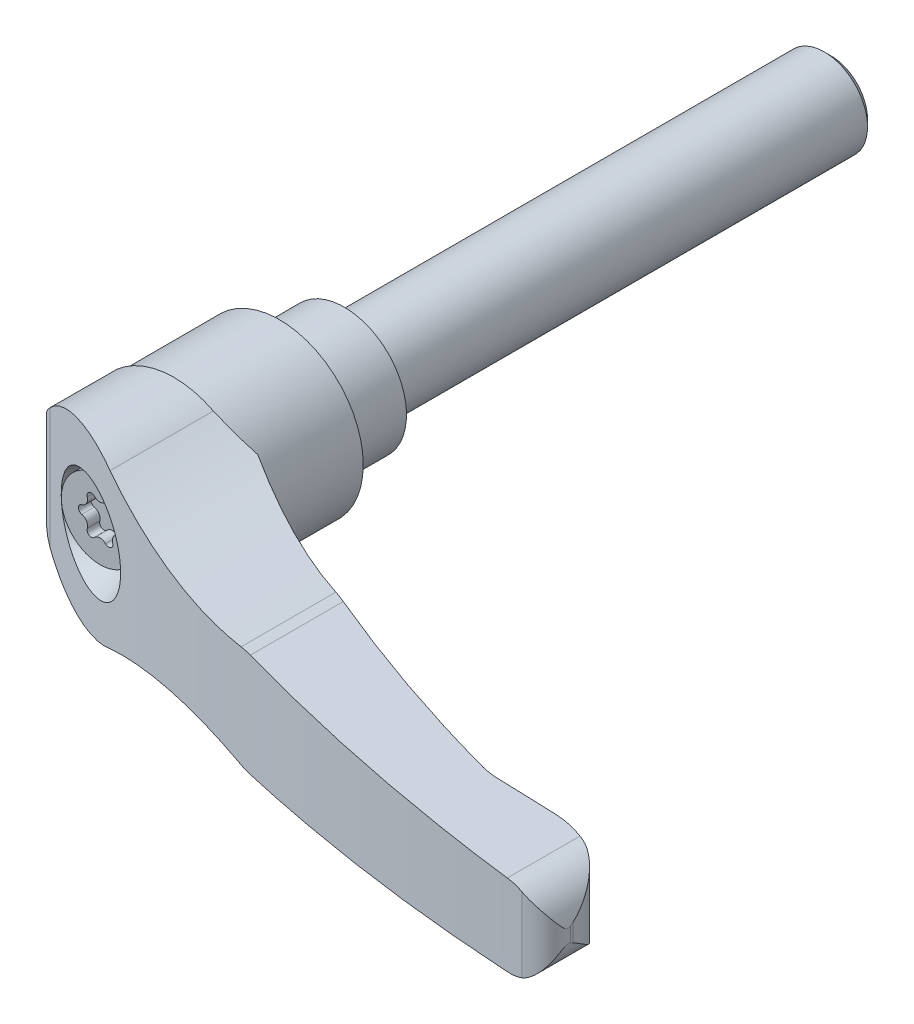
ISO-10303-21;
HEADER;
FILE_DESCRIPTION(('STEP AP214'),'2;1');
FILE_NAME('part.step','',(''),(''),'','','');
FILE_SCHEMA(('AUTOMOTIVE_DESIGN { 1 0 10303 214 1 1 1 1 }'));
ENDSEC;
DATA;
#1=APPLICATION_CONTEXT('core data for automotive mechanical design processes');
#2=APPLICATION_PROTOCOL_DEFINITION('international standard','automotive_design',2000,#1);
#3=PRODUCT_CONTEXT('',#1,'mechanical');
#4=PRODUCT('Part','Part','',(#3));
#5=PRODUCT_RELATED_PRODUCT_CATEGORY('part','',(#4));
#6=PRODUCT_DEFINITION_FORMATION('','',#4);
#7=PRODUCT_DEFINITION_CONTEXT('part definition',#1,'design');
#8=PRODUCT_DEFINITION('design','',#6,#7);
#9=PRODUCT_DEFINITION_SHAPE('','',#8);
#10=(LENGTH_UNIT() NAMED_UNIT(*) SI_UNIT(.MILLI.,.METRE.));
#11=(NAMED_UNIT(*) PLANE_ANGLE_UNIT() SI_UNIT($,.RADIAN.));
#12=(NAMED_UNIT(*) SI_UNIT($,.STERADIAN.) SOLID_ANGLE_UNIT());
#13=UNCERTAINTY_MEASURE_WITH_UNIT(LENGTH_MEASURE(1.E-05),#10,'distance_accuracy_value','');
#14=(GEOMETRIC_REPRESENTATION_CONTEXT(3) GLOBAL_UNCERTAINTY_ASSIGNED_CONTEXT((#13)) GLOBAL_UNIT_ASSIGNED_CONTEXT((#10,
#11,#12)) REPRESENTATION_CONTEXT('',''));
#15=CARTESIAN_POINT('',(0.,0.,0.));
#16=DIRECTION('',(0.,0.,1.));
#17=DIRECTION('',(1.,0.,0.));
#18=AXIS2_PLACEMENT_3D('',#15,#16,#17);
#19=CARTESIAN_POINT('',(-1.58999999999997,2.75396078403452,49.24));
#20=DIRECTION('',(0.,0.,-1.));
#21=DIRECTION('',(0.,1.,0.));
#22=AXIS2_PLACEMENT_3D('',#19,#20,#21);
#23=CYLINDRICAL_SURFACE('',#22,0.794999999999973);
#24=CARTESIAN_POINT('',(-1.58999999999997,2.75396078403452,42.87));
#25=DIRECTION('',(0.,0.,-1.));
#26=DIRECTION('',(0.,1.,0.));
#27=AXIS2_PLACEMENT_3D('',#24,#25,#26);
#28=CIRCLE('',#27,0.794999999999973);
#29=CARTESIAN_POINT('',(-1.0118181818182,3.2996079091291,42.87));
#30=VERTEX_POINT('',#29);
#31=CARTESIAN_POINT('',(-2.3516351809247,2.5260642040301,42.87));
#32=VERTEX_POINT('',#31);
#33=EDGE_CURVE('E242',#30,#32,#28,.F.);
#34=ORIENTED_EDGE('',*,*,#33,.F.);
#35=DIRECTION('',(0.,0.,-1.));
#36=VECTOR('',#35,1.);
#37=CARTESIAN_POINT('',(-1.0118181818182,3.2996079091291,49.24));
#38=LINE('',#37,#36);
#39=CARTESIAN_POINT('',(-1.0118181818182,3.2996079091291,45.19));
#40=VERTEX_POINT('',#39);
#41=EDGE_CURVE('E734',#40,#30,#38,.T.);
#42=ORIENTED_EDGE('',*,*,#41,.F.);
#43=CARTESIAN_POINT('',(-1.58999999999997,2.75396078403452,45.19));
#44=DIRECTION('',(0.,0.,1.));
#45=DIRECTION('',(0.,-1.,0.));
#46=AXIS2_PLACEMENT_3D('',#43,#44,#45);
#47=CIRCLE('',#46,0.794999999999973);
#48=CARTESIAN_POINT('',(-2.3516351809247,2.5260642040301,45.19));
#49=VERTEX_POINT('',#48);
#50=EDGE_CURVE('E192',#49,#40,#47,.F.);
#51=ORIENTED_EDGE('',*,*,#50,.F.);
#52=DIRECTION('',(0.,0.,-1.));
#53=VECTOR('',#52,1.);
#54=CARTESIAN_POINT('',(-2.3516351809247,2.5260642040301,49.24));
#55=LINE('',#54,#53);
#56=EDGE_CURVE('E232',#49,#32,#55,.T.);
#57=ORIENTED_EDGE('',*,*,#56,.T.);
#58=EDGE_LOOP('',(#34,#42,#51,#57));
#59=FACE_BOUND('',#58,.T.);
#60=ADVANCED_FACE('F14',(#59),#23,.F.);
#61=CARTESIAN_POINT('',(1.59,2.75396078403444,49.24));
#62=DIRECTION('',(0.,0.,-1.));
#63=DIRECTION('',(0.,1.,0.));
#64=AXIS2_PLACEMENT_3D('',#61,#62,#63);
#65=CYLINDRICAL_SURFACE('',#64,0.795000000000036);
#66=DIRECTION('',(0.,0.,-1.));
#67=VECTOR('',#66,1.);
#68=CARTESIAN_POINT('',(1.0118181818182,3.2996079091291,49.24));
#69=LINE('',#68,#67);
#70=CARTESIAN_POINT('',(1.0118181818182,3.2996079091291,45.19));
#71=VERTEX_POINT('',#70);
#72=CARTESIAN_POINT('',(1.01181818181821,3.29960790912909,42.87));
#73=VERTEX_POINT('',#72);
#74=EDGE_CURVE('E737',#71,#73,#69,.T.);
#75=ORIENTED_EDGE('',*,*,#74,.T.);
#76=CARTESIAN_POINT('',(1.59,2.75396078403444,42.87));
#77=DIRECTION('',(0.,0.,-1.));
#78=DIRECTION('',(0.,1.,0.));
#79=AXIS2_PLACEMENT_3D('',#76,#77,#78);
#80=CIRCLE('',#79,0.795000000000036);
#81=CARTESIAN_POINT('',(2.3516351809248,2.5260642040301,42.87));
#82=VERTEX_POINT('',#81);
#83=EDGE_CURVE('E765',#82,#73,#80,.F.);
#84=ORIENTED_EDGE('',*,*,#83,.F.);
#85=DIRECTION('',(0.,0.,-1.));
#86=VECTOR('',#85,1.);
#87=CARTESIAN_POINT('',(2.3516351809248,2.5260642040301,49.24));
#88=LINE('',#87,#86);
#89=CARTESIAN_POINT('',(2.3516351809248,2.5260642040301,45.19));
#90=VERTEX_POINT('',#89);
#91=EDGE_CURVE('E740',#90,#82,#88,.T.);
#92=ORIENTED_EDGE('',*,*,#91,.F.);
#93=CARTESIAN_POINT('',(1.59,2.75396078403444,45.19));
#94=DIRECTION('',(0.,0.,1.));
#95=DIRECTION('',(0.,-1.,0.));
#96=AXIS2_PLACEMENT_3D('',#93,#94,#95);
#97=CIRCLE('',#96,0.795000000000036);
#98=EDGE_CURVE('E768',#71,#90,#97,.F.);
#99=ORIENTED_EDGE('',*,*,#98,.F.);
#100=EDGE_LOOP('',(#75,#84,#92,#99));
#101=FACE_BOUND('',#100,.T.);
#102=ADVANCED_FACE('F535',(#101),#65,.F.);
#103=CARTESIAN_POINT('',(3.18,0.,49.24));
#104=DIRECTION('',(0.,0.,-1.));
#105=DIRECTION('',(0.,1.,0.));
#106=AXIS2_PLACEMENT_3D('',#103,#104,#105);
#107=CYLINDRICAL_SURFACE('',#106,0.795);
#108=DIRECTION('',(0.,0.,-1.));
#109=VECTOR('',#108,1.);
#110=CARTESIAN_POINT('',(3.3634533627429,0.77354370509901,49.24));
#111=LINE('',#110,#109);
#112=CARTESIAN_POINT('',(3.3634533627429,0.77354370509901,45.19));
#113=VERTEX_POINT('',#112);
#114=CARTESIAN_POINT('',(3.3634533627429,0.773543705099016,42.87));
#115=VERTEX_POINT('',#114);
#116=EDGE_CURVE('E743',#113,#115,#111,.T.);
#117=ORIENTED_EDGE('',*,*,#116,.T.);
#118=CARTESIAN_POINT('',(3.18,0.,42.87));
#119=DIRECTION('',(0.,0.,-1.));
#120=DIRECTION('',(0.,1.,0.));
#121=AXIS2_PLACEMENT_3D('',#118,#119,#120);
#122=CIRCLE('',#121,0.795);
#123=CARTESIAN_POINT('',(3.3634533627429,-0.773543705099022,42.87));
#124=VERTEX_POINT('',#123);
#125=EDGE_CURVE('E771',#124,#115,#122,.F.);
#126=ORIENTED_EDGE('',*,*,#125,.F.);
#127=DIRECTION('',(0.,0.,-1.));
#128=VECTOR('',#127,1.);
#129=CARTESIAN_POINT('',(3.3634533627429,-0.77354370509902,49.24));
#130=LINE('',#129,#128);
#131=CARTESIAN_POINT('',(3.3634533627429,-0.77354370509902,45.19));
#132=VERTEX_POINT('',#131);
#133=EDGE_CURVE('E746',#132,#124,#130,.T.);
#134=ORIENTED_EDGE('',*,*,#133,.F.);
#135=CARTESIAN_POINT('',(3.18,0.,45.19));
#136=DIRECTION('',(0.,0.,1.));
#137=DIRECTION('',(0.,-1.,0.));
#138=AXIS2_PLACEMENT_3D('',#135,#136,#137);
#139=CIRCLE('',#138,0.795);
#140=EDGE_CURVE('E774',#113,#132,#139,.F.);
#141=ORIENTED_EDGE('',*,*,#140,.F.);
#142=EDGE_LOOP('',(#117,#126,#134,#141));
#143=FACE_BOUND('',#142,.T.);
#144=ADVANCED_FACE('F540',(#143),#107,.F.);
#145=CARTESIAN_POINT('',(1.58999999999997,-2.75396078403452,49.24));
#146=DIRECTION('',(0.,0.,-1.));
#147=DIRECTION('',(0.,1.,0.));
#148=AXIS2_PLACEMENT_3D('',#145,#146,#147);
#149=CYLINDRICAL_SURFACE('',#148,0.794999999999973);
#150=DIRECTION('',(0.,0.,-1.));
#151=VECTOR('',#150,1.);
#152=CARTESIAN_POINT('',(2.3516351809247,-2.5260642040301,49.24));
#153=LINE('',#152,#151);
#154=CARTESIAN_POINT('',(2.3516351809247,-2.5260642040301,45.19));
#155=VERTEX_POINT('',#154);
#156=CARTESIAN_POINT('',(2.3516351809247,-2.5260642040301,42.87));
#157=VERTEX_POINT('',#156);
#158=EDGE_CURVE('E749',#155,#157,#153,.T.);
#159=ORIENTED_EDGE('',*,*,#158,.T.);
#160=CARTESIAN_POINT('',(1.58999999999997,-2.75396078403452,42.87));
#161=DIRECTION('',(0.,0.,-1.));
#162=DIRECTION('',(0.,1.,0.));
#163=AXIS2_PLACEMENT_3D('',#160,#161,#162);
#164=CIRCLE('',#163,0.794999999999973);
#165=CARTESIAN_POINT('',(1.0118181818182,-3.2996079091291,42.87));
#166=VERTEX_POINT('',#165);
#167=EDGE_CURVE('E777',#166,#157,#164,.F.);
#168=ORIENTED_EDGE('',*,*,#167,.F.);
#169=DIRECTION('',(0.,0.,-1.));
#170=VECTOR('',#169,1.);
#171=CARTESIAN_POINT('',(1.0118181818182,-3.2996079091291,49.24));
#172=LINE('',#171,#170);
#173=CARTESIAN_POINT('',(1.0118181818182,-3.2996079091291,45.19));
#174=VERTEX_POINT('',#173);
#175=EDGE_CURVE('E752',#174,#166,#172,.T.);
#176=ORIENTED_EDGE('',*,*,#175,.F.);
#177=CARTESIAN_POINT('',(1.58999999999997,-2.75396078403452,45.19));
#178=DIRECTION('',(0.,0.,1.));
#179=DIRECTION('',(0.,-1.,0.));
#180=AXIS2_PLACEMENT_3D('',#177,#178,#179);
#181=CIRCLE('',#180,0.794999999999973);
#182=EDGE_CURVE('E780',#155,#174,#181,.F.);
#183=ORIENTED_EDGE('',*,*,#182,.F.);
#184=EDGE_LOOP('',(#159,#168,#176,#183));
#185=FACE_BOUND('',#184,.T.);
#186=ADVANCED_FACE('F559',(#185),#149,.F.);
#187=CARTESIAN_POINT('',(-1.59,-2.75396078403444,49.24));
#188=DIRECTION('',(0.,0.,-1.));
#189=DIRECTION('',(0.,1.,0.));
#190=AXIS2_PLACEMENT_3D('',#187,#188,#189);
#191=CYLINDRICAL_SURFACE('',#190,0.795000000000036);
#192=DIRECTION('',(0.,0.,-1.));
#193=VECTOR('',#192,1.);
#194=CARTESIAN_POINT('',(-1.0118181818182,-3.2996079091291,49.24));
#195=LINE('',#194,#193);
#196=CARTESIAN_POINT('',(-1.0118181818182,-3.2996079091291,45.19));
#197=VERTEX_POINT('',#196);
#198=CARTESIAN_POINT('',(-1.01181818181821,-3.29960790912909,42.87));
#199=VERTEX_POINT('',#198);
#200=EDGE_CURVE('E755',#197,#199,#195,.T.);
#201=ORIENTED_EDGE('',*,*,#200,.T.);
#202=CARTESIAN_POINT('',(-1.59,-2.75396078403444,42.87));
#203=DIRECTION('',(0.,0.,-1.));
#204=DIRECTION('',(0.,1.,0.));
#205=AXIS2_PLACEMENT_3D('',#202,#203,#204);
#206=CIRCLE('',#205,0.795000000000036);
#207=CARTESIAN_POINT('',(-2.3516351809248,-2.5260642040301,42.87));
#208=VERTEX_POINT('',#207);
#209=EDGE_CURVE('E783',#208,#199,#206,.F.);
#210=ORIENTED_EDGE('',*,*,#209,.F.);
#211=DIRECTION('',(0.,0.,-1.));
#212=VECTOR('',#211,1.);
#213=CARTESIAN_POINT('',(-2.3516351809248,-2.5260642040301,49.24));
#214=LINE('',#213,#212);
#215=CARTESIAN_POINT('',(-2.3516351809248,-2.5260642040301,45.19));
#216=VERTEX_POINT('',#215);
#217=EDGE_CURVE('E758',#216,#208,#214,.T.);
#218=ORIENTED_EDGE('',*,*,#217,.F.);
#219=CARTESIAN_POINT('',(-1.59,-2.75396078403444,45.19));
#220=DIRECTION('',(0.,0.,1.));
#221=DIRECTION('',(0.,-1.,0.));
#222=AXIS2_PLACEMENT_3D('',#219,#220,#221);
#223=CIRCLE('',#222,0.795000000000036);
#224=EDGE_CURVE('E253',#197,#216,#223,.F.);
#225=ORIENTED_EDGE('',*,*,#224,.F.);
#226=EDGE_LOOP('',(#201,#210,#218,#225));
#227=FACE_BOUND('',#226,.T.);
#228=ADVANCED_FACE('F567',(#227),#191,.F.);
#229=CARTESIAN_POINT('',(-3.18,0.,49.24));
#230=DIRECTION('',(0.,0.,-1.));
#231=DIRECTION('',(0.,1.,0.));
#232=AXIS2_PLACEMENT_3D('',#229,#230,#231);
#233=CYLINDRICAL_SURFACE('',#232,0.795);
#234=CARTESIAN_POINT('',(-3.18,0.,42.87));
#235=DIRECTION('',(0.,0.,-1.));
#236=DIRECTION('',(0.,1.,0.));
#237=AXIS2_PLACEMENT_3D('',#234,#235,#236);
#238=CIRCLE('',#237,0.795);
#239=CARTESIAN_POINT('',(-3.3634533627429,0.773543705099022,42.87));
#240=VERTEX_POINT('',#239);
#241=CARTESIAN_POINT('',(-3.3634533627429,-0.77354370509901,42.87));
#242=VERTEX_POINT('',#241);
#243=EDGE_CURVE('E36',#240,#242,#238,.F.);
#244=ORIENTED_EDGE('',*,*,#243,.F.);
#245=DIRECTION('',(0.,0.,-1.));
#246=VECTOR('',#245,1.);
#247=CARTESIAN_POINT('',(-3.3634533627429,0.77354370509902,49.24));
#248=LINE('',#247,#246);
#249=CARTESIAN_POINT('',(-3.3634533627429,0.77354370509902,45.19));
#250=VERTEX_POINT('',#249);
#251=EDGE_CURVE('E231',#250,#240,#248,.T.);
#252=ORIENTED_EDGE('',*,*,#251,.F.);
#253=CARTESIAN_POINT('',(-3.18,0.,45.19));
#254=DIRECTION('',(0.,0.,1.));
#255=DIRECTION('',(0.,-1.,0.));
#256=AXIS2_PLACEMENT_3D('',#253,#254,#255);
#257=CIRCLE('',#256,0.795);
#258=CARTESIAN_POINT('',(-3.3634533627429,-0.77354370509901,45.19));
#259=VERTEX_POINT('',#258);
#260=EDGE_CURVE('E240',#259,#250,#257,.F.);
#261=ORIENTED_EDGE('',*,*,#260,.F.);
#262=DIRECTION('',(0.,0.,-1.));
#263=VECTOR('',#262,1.);
#264=CARTESIAN_POINT('',(-3.3634533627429,-0.77354370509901,49.24));
#265=LINE('',#264,#263);
#266=EDGE_CURVE('E243',#259,#242,#265,.T.);
#267=ORIENTED_EDGE('',*,*,#266,.T.);
#268=EDGE_LOOP('',(#244,#252,#261,#267));
#269=FACE_BOUND('',#268,.T.);
#270=ADVANCED_FACE('F238',(#269),#233,.F.);
#271=CARTESIAN_POINT('',(-3.68449674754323,2.12724518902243,49.24));
#272=DIRECTION('',(0.,0.,-1.));
#273=DIRECTION('',(0.,1.,0.));
#274=AXIS2_PLACEMENT_3D('',#271,#272,#273);
#275=CYLINDRICAL_SURFACE('',#274,1.39125000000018);
#276=ORIENTED_EDGE('',*,*,#251,.T.);
#277=CARTESIAN_POINT('',(-3.68449674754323,2.12724518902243,42.87));
#278=DIRECTION('',(0.,0.,-1.));
#279=DIRECTION('',(-1.,0.,0.));
#280=AXIS2_PLACEMENT_3D('',#277,#278,#279);
#281=CIRCLE('',#280,1.39125000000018);
#282=EDGE_CURVE('E723',#240,#32,#281,.F.);
#283=ORIENTED_EDGE('',*,*,#282,.T.);
#284=ORIENTED_EDGE('',*,*,#56,.F.);
#285=CARTESIAN_POINT('',(-3.68449674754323,2.12724518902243,45.19));
#286=DIRECTION('',(0.,0.,1.));
#287=DIRECTION('',(0.,-1.,0.));
#288=AXIS2_PLACEMENT_3D('',#285,#286,#287);
#289=CIRCLE('',#288,1.39125000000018);
#290=EDGE_CURVE('E226',#250,#49,#289,.T.);
#291=ORIENTED_EDGE('',*,*,#290,.F.);
#292=EDGE_LOOP('',(#276,#283,#284,#291));
#293=FACE_BOUND('',#292,.T.);
#294=ADVANCED_FACE('F228',(#293),#275,.T.);
#295=CARTESIAN_POINT('',(0.,4.25449037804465,49.24));
#296=DIRECTION('',(0.,0.,-1.));
#297=DIRECTION('',(0.,1.,0.));
#298=AXIS2_PLACEMENT_3D('',#295,#296,#297);
#299=CYLINDRICAL_SURFACE('',#298,1.39125000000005);
#300=ORIENTED_EDGE('',*,*,#41,.T.);
#301=CARTESIAN_POINT('',(0.,4.25449037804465,42.87));
#302=DIRECTION('',(0.,0.,-1.));
#303=DIRECTION('',(-1.,0.,0.));
#304=AXIS2_PLACEMENT_3D('',#301,#302,#303);
#305=CIRCLE('',#304,1.39125000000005);
#306=EDGE_CURVE('E726',#30,#73,#305,.F.);
#307=ORIENTED_EDGE('',*,*,#306,.T.);
#308=ORIENTED_EDGE('',*,*,#74,.F.);
#309=CARTESIAN_POINT('',(0.,4.25449037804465,45.19));
#310=DIRECTION('',(0.,0.,1.));
#311=DIRECTION('',(0.,-1.,0.));
#312=AXIS2_PLACEMENT_3D('',#309,#310,#311);
#313=CIRCLE('',#312,1.39125000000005);
#314=EDGE_CURVE('E270',#40,#71,#313,.T.);
#315=ORIENTED_EDGE('',*,*,#314,.F.);
#316=EDGE_LOOP('',(#300,#307,#308,#315));
#317=FACE_BOUND('',#316,.T.);
#318=ADVANCED_FACE('F548',(#317),#299,.T.);
#319=CARTESIAN_POINT('',(3.68449674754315,2.12724518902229,49.24));
#320=DIRECTION('',(0.,0.,-1.));
#321=DIRECTION('',(0.,1.,0.));
#322=AXIS2_PLACEMENT_3D('',#319,#320,#321);
#323=CYLINDRICAL_SURFACE('',#322,1.39125000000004);
#324=ORIENTED_EDGE('',*,*,#91,.T.);
#325=CARTESIAN_POINT('',(3.68449674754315,2.12724518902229,42.87));
#326=DIRECTION('',(0.,0.,-1.));
#327=DIRECTION('',(-1.,0.,0.));
#328=AXIS2_PLACEMENT_3D('',#325,#326,#327);
#329=CIRCLE('',#328,1.39125000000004);
#330=EDGE_CURVE('E729',#82,#115,#329,.F.);
#331=ORIENTED_EDGE('',*,*,#330,.T.);
#332=ORIENTED_EDGE('',*,*,#116,.F.);
#333=CARTESIAN_POINT('',(3.68449674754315,2.12724518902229,45.19));
#334=DIRECTION('',(0.,0.,1.));
#335=DIRECTION('',(0.,-1.,0.));
#336=AXIS2_PLACEMENT_3D('',#333,#334,#335);
#337=CIRCLE('',#336,1.39125000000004);
#338=EDGE_CURVE('E273',#90,#113,#337,.T.);
#339=ORIENTED_EDGE('',*,*,#338,.F.);
#340=EDGE_LOOP('',(#324,#331,#332,#339));
#341=FACE_BOUND('',#340,.T.);
#342=ADVANCED_FACE('F550',(#341),#323,.T.);
#343=CARTESIAN_POINT('',(3.68449674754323,-2.12724518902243,49.24));
#344=DIRECTION('',(0.,0.,-1.));
#345=DIRECTION('',(0.,1.,0.));
#346=AXIS2_PLACEMENT_3D('',#343,#344,#345);
#347=CYLINDRICAL_SURFACE('',#346,1.39125000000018);
#348=ORIENTED_EDGE('',*,*,#133,.T.);
#349=CARTESIAN_POINT('',(3.68449674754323,-2.12724518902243,42.87));
#350=DIRECTION('',(0.,0.,-1.));
#351=DIRECTION('',(-1.,0.,0.));
#352=AXIS2_PLACEMENT_3D('',#349,#350,#351);
#353=CIRCLE('',#352,1.39125000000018);
#354=EDGE_CURVE('E796',#124,#157,#353,.F.);
#355=ORIENTED_EDGE('',*,*,#354,.T.);
#356=ORIENTED_EDGE('',*,*,#158,.F.);
#357=CARTESIAN_POINT('',(3.68449674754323,-2.12724518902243,45.19));
#358=DIRECTION('',(0.,0.,1.));
#359=DIRECTION('',(0.,-1.,0.));
#360=AXIS2_PLACEMENT_3D('',#357,#358,#359);
#361=CIRCLE('',#360,1.39125000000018);
#362=EDGE_CURVE('E276',#132,#155,#361,.T.);
#363=ORIENTED_EDGE('',*,*,#362,.F.);
#364=EDGE_LOOP('',(#348,#355,#356,#363));
#365=FACE_BOUND('',#364,.T.);
#366=ADVANCED_FACE('F555',(#365),#347,.T.);
#367=CARTESIAN_POINT('',(0.,-4.25449037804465,49.24));
#368=DIRECTION('',(0.,0.,-1.));
#369=DIRECTION('',(0.,1.,0.));
#370=AXIS2_PLACEMENT_3D('',#367,#368,#369);
#371=CYLINDRICAL_SURFACE('',#370,1.39125000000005);
#372=ORIENTED_EDGE('',*,*,#175,.T.);
#373=CARTESIAN_POINT('',(0.,-4.25449037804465,42.87));
#374=DIRECTION('',(0.,0.,-1.));
#375=DIRECTION('',(-1.,0.,0.));
#376=AXIS2_PLACEMENT_3D('',#373,#374,#375);
#377=CIRCLE('',#376,1.39125000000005);
#378=EDGE_CURVE('E792',#166,#199,#377,.F.);
#379=ORIENTED_EDGE('',*,*,#378,.T.);
#380=ORIENTED_EDGE('',*,*,#200,.F.);
#381=CARTESIAN_POINT('',(0.,-4.25449037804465,45.19));
#382=DIRECTION('',(0.,0.,1.));
#383=DIRECTION('',(0.,-1.,0.));
#384=AXIS2_PLACEMENT_3D('',#381,#382,#383);
#385=CIRCLE('',#384,1.39125000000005);
#386=EDGE_CURVE('E279',#174,#197,#385,.T.);
#387=ORIENTED_EDGE('',*,*,#386,.F.);
#388=EDGE_LOOP('',(#372,#379,#380,#387));
#389=FACE_BOUND('',#388,.T.);
#390=ADVANCED_FACE('F563',(#389),#371,.T.);
#391=CARTESIAN_POINT('',(-3.68449674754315,-2.12724518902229,49.24));
#392=DIRECTION('',(0.,0.,-1.));
#393=DIRECTION('',(0.,1.,0.));
#394=AXIS2_PLACEMENT_3D('',#391,#392,#393);
#395=CYLINDRICAL_SURFACE('',#394,1.39125000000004);
#396=ORIENTED_EDGE('',*,*,#217,.T.);
#397=CARTESIAN_POINT('',(-3.68449674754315,-2.12724518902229,42.87));
#398=DIRECTION('',(0.,0.,-1.));
#399=DIRECTION('',(-1.,0.,0.));
#400=AXIS2_PLACEMENT_3D('',#397,#398,#399);
#401=CIRCLE('',#400,1.39125000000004);
#402=EDGE_CURVE('E797',#208,#242,#401,.F.);
#403=ORIENTED_EDGE('',*,*,#402,.T.);
#404=ORIENTED_EDGE('',*,*,#266,.F.);
#405=CARTESIAN_POINT('',(-3.68449674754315,-2.12724518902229,45.19));
#406=DIRECTION('',(0.,0.,1.));
#407=DIRECTION('',(0.,-1.,0.));
#408=AXIS2_PLACEMENT_3D('',#405,#406,#407);
#409=CIRCLE('',#408,1.39125000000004);
#410=EDGE_CURVE('E235',#216,#259,#409,.T.);
#411=ORIENTED_EDGE('',*,*,#410,.F.);
#412=EDGE_LOOP('',(#396,#403,#404,#411));
#413=FACE_BOUND('',#412,.T.);
#414=ADVANCED_FACE('F571',(#413),#395,.T.);
#415=CARTESIAN_POINT('',(0.,0.,12.));
#416=DIRECTION('',(0.,0.,1.));
#417=DIRECTION('',(0.,-1.,0.));
#418=AXIS2_PLACEMENT_3D('',#415,#416,#417);
#419=CYLINDRICAL_SURFACE('',#418,7.15);
#420=CARTESIAN_POINT('',(0.,0.,45.19));
#421=DIRECTION('',(0.,0.,1.));
#422=DIRECTION('',(0.,-1.,0.));
#423=AXIS2_PLACEMENT_3D('',#420,#421,#422);
#424=CIRCLE('',#423,7.15);
#425=CARTESIAN_POINT('',(0.,-7.15,45.19));
#426=VERTEX_POINT('',#425);
#427=EDGE_CURVE('E267',#426,#426,#424,.T.);
#428=ORIENTED_EDGE('',*,*,#427,.F.);
#429=EDGE_LOOP('',(#428));
#430=FACE_BOUND('',#429,.T.);
#431=CARTESIAN_POINT('',(0.,0.,42.87));
#432=DIRECTION('',(0.,0.,1.));
#433=DIRECTION('',(0.,-1.,0.));
#434=AXIS2_PLACEMENT_3D('',#431,#432,#433);
#435=CIRCLE('',#434,7.15);
#436=CARTESIAN_POINT('',(0.00499999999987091,-7.14999825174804,42.87));
#437=VERTEX_POINT('',#436);
#438=CARTESIAN_POINT('',(0.00499999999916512,7.14999825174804,42.87));
#439=VERTEX_POINT('',#438);
#440=EDGE_CURVE('E265',#437,#439,#435,.T.);
#441=ORIENTED_EDGE('',*,*,#440,.T.);
#442=CARTESIAN_POINT('',(7.03183954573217,1.29450090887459,42.8429799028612));
#443=CARTESIAN_POINT('',(6.99069549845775,1.51819635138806,42.8431382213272));
#444=CARTESIAN_POINT('',(6.93880997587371,1.73990977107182,42.84333787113));
#445=CARTESIAN_POINT('',(6.81417682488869,2.17740487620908,42.8438174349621));
#446=CARTESIAN_POINT('',(6.74142826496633,2.39318629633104,42.8440973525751));
#447=CARTESIAN_POINT('',(6.5759091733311,2.81627852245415,42.8447342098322));
#448=CARTESIAN_POINT('',(6.48319120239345,3.02360989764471,42.845090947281));
#449=CARTESIAN_POINT('',(6.27848211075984,3.42849783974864,42.8458785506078));
#450=CARTESIAN_POINT('',(6.16649402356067,3.62605593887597,42.8463094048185));
#451=CARTESIAN_POINT('',(5.93806231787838,3.987772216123,42.8471882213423));
#452=CARTESIAN_POINT('',(5.82357805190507,4.1531720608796,42.84762864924));
#453=CARTESIAN_POINT('',(5.5810849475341,4.47374290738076,42.8485614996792));
#454=CARTESIAN_POINT('',(5.45307647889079,4.62891418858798,42.8490539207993));
#455=CARTESIAN_POINT('',(5.18439686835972,4.92797656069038,42.8500874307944));
#456=CARTESIAN_POINT('',(5.04372112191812,5.07186351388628,42.8506285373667));
#457=CARTESIAN_POINT('',(4.75074933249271,5.34727025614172,42.851755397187));
#458=CARTESIAN_POINT('',(4.59845354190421,5.47879031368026,42.8523411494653));
#459=CARTESIAN_POINT('',(4.28315544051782,5.72866354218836,42.8535537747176));
#460=CARTESIAN_POINT('',(4.12014192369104,5.84700257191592,42.8541806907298));
#461=CARTESIAN_POINT('',(3.78471750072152,6.06950687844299,42.8554705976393));
#462=CARTESIAN_POINT('',(3.61230688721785,6.17367259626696,42.8561335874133));
#463=CARTESIAN_POINT('',(3.25969172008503,6.36688701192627,42.857489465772));
#464=CARTESIAN_POINT('',(3.07950417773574,6.45596679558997,42.8581822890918));
#465=CARTESIAN_POINT('',(2.71234774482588,6.61860590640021,42.8595939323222));
#466=CARTESIAN_POINT('',(2.52538292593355,6.69217437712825,42.8603127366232));
#467=CARTESIAN_POINT('',(2.26625144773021,6.78174103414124,42.8613089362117));
#468=CARTESIAN_POINT('',(2.19642556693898,6.80467590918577,42.8615773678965));
#469=CARTESIAN_POINT('',(2.05609451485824,6.84838502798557,42.8621168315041));
#470=CARTESIAN_POINT('',(1.98558927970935,6.86915906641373,42.8623878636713));
#471=CARTESIAN_POINT('',(1.69614267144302,6.94960898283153,42.8635005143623));
#472=CARTESIAN_POINT('',(1.47452578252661,6.99998359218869,42.8643523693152));
#473=CARTESIAN_POINT('',(1.027376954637,7.07945115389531,42.866071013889));
#474=CARTESIAN_POINT('',(0.801842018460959,7.10852700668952,42.8669378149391));
#475=CARTESIAN_POINT('',(0.348507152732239,7.1451285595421,42.8686800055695));
#476=CARTESIAN_POINT('',(0.12070326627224,7.15260558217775,42.8695554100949));
#477=CARTESIAN_POINT('',(-0.334671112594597,7.14579355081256,42.8713052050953));
#478=CARTESIAN_POINT('',(-0.562241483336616,7.13149622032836,42.872179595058));
#479=CARTESIAN_POINT('',(-0.988506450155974,7.08419530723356,42.8738173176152));
#480=CARTESIAN_POINT('',(-1.1874689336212,7.05357187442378,42.8745816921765));
#481=CARTESIAN_POINT('',(-1.58210608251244,6.97566382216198,42.8760977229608));
#482=CARTESIAN_POINT('',(-1.77778084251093,6.92837968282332,42.8768493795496));
#483=CARTESIAN_POINT('',(-2.16423124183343,6.8175484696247,42.8783337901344));
#484=CARTESIAN_POINT('',(-2.35501209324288,6.75401956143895,42.8790665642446));
#485=CARTESIAN_POINT('',(-2.73055441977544,6.61112216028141,42.8805089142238));
#486=CARTESIAN_POINT('',(-2.91531569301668,6.53175313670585,42.8812184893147));
#487=CARTESIAN_POINT('',(-3.27783499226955,6.35757906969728,42.8826106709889));
#488=CARTESIAN_POINT('',(-3.45557942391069,6.26274572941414,42.8832932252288));
#489=CARTESIAN_POINT('',(-3.80243195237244,6.05842592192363,42.8846251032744));
#490=CARTESIAN_POINT('',(-3.97154019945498,5.94893970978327,42.8852744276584));
#491=CARTESIAN_POINT('',(-4.30004997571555,5.71599903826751,42.8865357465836));
#492=CARTESIAN_POINT('',(-4.45944371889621,5.59253359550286,42.8871477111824));
#493=CARTESIAN_POINT('',(-4.76718607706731,5.33263471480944,42.8883291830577));
#494=CARTESIAN_POINT('',(-4.91553818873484,5.1962054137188,42.8888987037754));
#495=CARTESIAN_POINT('',(-5.21881270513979,4.89268060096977,42.8900629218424));
#496=CARTESIAN_POINT('',(-5.37206129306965,4.72390730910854,42.8906511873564));
#497=CARTESIAN_POINT('',(-5.6617726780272,4.37249351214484,42.891763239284));
#498=CARTESIAN_POINT('',(-5.79823322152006,4.18985115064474,42.892287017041));
#499=CARTESIAN_POINT('',(-6.05310399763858,3.81238641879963,42.8932652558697));
#500=CARTESIAN_POINT('',(-6.1715147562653,3.6175644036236,42.8937197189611));
#501=CARTESIAN_POINT('',(-6.38919688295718,3.21753055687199,42.894555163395));
#502=CARTESIAN_POINT('',(-6.48847083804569,3.01232013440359,42.8949361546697));
#503=CARTESIAN_POINT('',(-6.65653368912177,2.61791636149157,42.8955811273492));
#504=CARTESIAN_POINT('',(-6.72753074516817,2.42965976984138,42.8958535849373));
#505=CARTESIAN_POINT('',(-6.85343572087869,2.0477669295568,42.8963367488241));
#506=CARTESIAN_POINT('',(-6.90833850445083,1.85412898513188,42.8965474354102));
#507=CARTESIAN_POINT('',(-7.00159360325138,1.46306693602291,42.896905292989));
#508=CARTESIAN_POINT('',(-7.03995857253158,1.26564584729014,42.8970525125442));
#509=CARTESIAN_POINT('',(-7.09993884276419,0.868200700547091,42.8972826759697));
#510=CARTESIAN_POINT('',(-7.12154799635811,0.668175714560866,42.8973655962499));
#511=CARTESIAN_POINT('',(-7.14783671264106,0.267056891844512,42.8974664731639));
#512=CARTESIAN_POINT('',(-7.15251967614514,0.0659632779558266,42.8974844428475));
#513=CARTESIAN_POINT('',(-7.14493086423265,-0.335978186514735,42.8974553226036));
#514=CARTESIAN_POINT('',(-7.13265282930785,-0.536825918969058,42.8974082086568));
#515=CARTESIAN_POINT('',(-7.09122422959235,-0.936714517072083,42.8972492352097));
#516=CARTESIAN_POINT('',(-7.06207856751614,-1.13575589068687,42.8971373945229));
#517=CARTESIAN_POINT('',(-6.98711177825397,-1.53074943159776,42.8968497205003));
#518=CARTESIAN_POINT('',(-6.94128449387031,-1.72670043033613,42.8966738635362));
#519=CARTESIAN_POINT('',(-6.83330403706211,-2.1139649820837,42.8962594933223));
#520=CARTESIAN_POINT('',(-6.77115752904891,-2.30528039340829,42.8960210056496));
#521=CARTESIAN_POINT('',(-6.63094529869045,-2.6820675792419,42.8954829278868));
#522=CARTESIAN_POINT('',(-6.55287362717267,-2.86753713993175,42.8951833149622));
#523=CARTESIAN_POINT('',(-6.38141700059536,-3.23116157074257,42.8945253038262));
#524=CARTESIAN_POINT('',(-6.28803852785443,-3.40931949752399,42.8941669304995));
#525=CARTESIAN_POINT('',(-6.08656287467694,-3.75721663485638,42.8933936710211));
#526=CARTESIAN_POINT('',(-5.97845904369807,-3.92695199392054,42.8929787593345));
#527=CARTESIAN_POINT('',(-5.74833350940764,-4.25671078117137,42.8920954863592));
#528=CARTESIAN_POINT('',(-5.62631175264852,-4.41673417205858,42.8916271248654));
#529=CARTESIAN_POINT('',(-5.36927692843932,-4.72586007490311,42.8906404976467));
#530=CARTESIAN_POINT('',(-5.23426977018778,-4.87496750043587,42.8901222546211));
#531=CARTESIAN_POINT('',(-4.952117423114,-5.16134237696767,42.8890391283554));
#532=CARTESIAN_POINT('',(-4.80496713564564,-5.2986048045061,42.8884742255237));
#533=CARTESIAN_POINT('',(-4.49968173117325,-5.56019390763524,42.8873021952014));
#534=CARTESIAN_POINT('',(-4.34155074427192,-5.68452540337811,42.8866950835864));
#535=CARTESIAN_POINT('',(-4.01531134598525,-5.91947632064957,42.8854424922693));
#536=CARTESIAN_POINT('',(-3.84719884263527,-6.03009006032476,42.8847969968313));
#537=CARTESIAN_POINT('',(-3.50231519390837,-6.236720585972,42.8834726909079));
#538=CARTESIAN_POINT('',(-3.32554726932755,-6.33274274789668,42.8827938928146));
#539=CARTESIAN_POINT('',(-2.96449885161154,-6.5095825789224,42.881407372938));
#540=CARTESIAN_POINT('',(-2.78021617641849,-6.59039579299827,42.8806996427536));
#541=CARTESIAN_POINT('',(-2.40556659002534,-6.73618130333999,42.8792607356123));
#542=CARTESIAN_POINT('',(-2.21520194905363,-6.80115943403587,42.8785295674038));
#543=CARTESIAN_POINT('',(-1.82963729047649,-6.91486315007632,42.8770485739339));
#544=CARTESIAN_POINT('',(-1.63443630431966,-6.9635854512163,42.8762987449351));
#545=CARTESIAN_POINT('',(-1.24069668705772,-7.04439835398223,42.8747861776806));
#546=CARTESIAN_POINT('',(-1.0421593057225,-7.07649504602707,42.8740234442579));
#547=CARTESIAN_POINT('',(-0.642932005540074,-7.12387351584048,42.8724896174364));
#548=CARTESIAN_POINT('',(-0.442240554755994,-7.13914239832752,42.8717185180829));
#549=CARTESIAN_POINT('',(-0.0403562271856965,-7.15271193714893,42.8701743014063));
#550=CARTESIAN_POINT('',(0.160836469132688,-7.15101800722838,42.8694011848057));
#551=CARTESIAN_POINT('',(0.588756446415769,-7.12934628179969,42.8677567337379));
#552=CARTESIAN_POINT('',(0.815367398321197,-7.10699667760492,42.8668858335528));
#553=CARTESIAN_POINT('',(1.26545011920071,-7.04080168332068,42.8651559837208));
#554=CARTESIAN_POINT('',(1.48892146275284,-6.99695340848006,42.8642970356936));
#555=CARTESIAN_POINT('',(1.93066705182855,-6.88816144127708,42.8625990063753));
#556=CARTESIAN_POINT('',(2.14894133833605,-6.82321791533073,42.8617599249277));
#557=CARTESIAN_POINT('',(2.57828599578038,-6.67283045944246,42.860109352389));
#558=CARTESIAN_POINT('',(2.78935732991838,-6.58738928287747,42.8592978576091));
#559=CARTESIAN_POINT('',(3.17840058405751,-6.40786212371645,42.8578020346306));
#560=CARTESIAN_POINT('',(3.35737080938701,-6.31593051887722,42.8571138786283));
#561=CARTESIAN_POINT('',(3.70699248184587,-6.11728190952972,42.8557694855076));
#562=CARTESIAN_POINT('',(3.87764126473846,-6.01056021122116,42.855113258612));
#563=CARTESIAN_POINT('',(4.20923829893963,-5.7831830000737,42.8538380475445));
#564=CARTESIAN_POINT('',(4.37019221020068,-5.66253573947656,42.8532190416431));
#565=CARTESIAN_POINT('',(4.68137022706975,-5.40811091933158,42.8520222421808));
#566=CARTESIAN_POINT('',(4.83159412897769,-5.27433311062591,42.8514444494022));
#567=CARTESIAN_POINT('',(5.1202550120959,-4.99458595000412,42.850334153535));
#568=CARTESIAN_POINT('',(5.25869080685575,-4.84861537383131,42.8498016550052));
#569=CARTESIAN_POINT('',(5.52277431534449,-4.5455322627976,42.8487858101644));
#570=CARTESIAN_POINT('',(5.6484220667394,-4.38841976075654,42.8483024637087));
#571=CARTESIAN_POINT('',(5.88606115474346,-4.06413587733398,42.8473882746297));
#572=CARTESIAN_POINT('',(5.99804968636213,-3.89696244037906,42.8469574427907));
#573=CARTESIAN_POINT('',(6.20754176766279,-3.55377827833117,42.8461514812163));
#574=CARTESIAN_POINT('',(6.30504562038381,-3.37776773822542,42.8457763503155));
#575=CARTESIAN_POINT('',(6.4849218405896,-3.01806937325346,42.8450842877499));
#576=CARTESIAN_POINT('',(6.56728677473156,-2.83437783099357,42.8447673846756));
#577=CARTESIAN_POINT('',(6.71621272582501,-2.46077476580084,42.84419437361));
#578=CARTESIAN_POINT('',(6.7827795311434,-2.2708655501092,42.843938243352));
#579=CARTESIAN_POINT('',(6.8996473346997,-1.88620013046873,42.8434885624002));
#580=CARTESIAN_POINT('',(6.9499557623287,-1.69144618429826,42.8432949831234));
#581=CARTESIAN_POINT('',(7.03397996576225,-1.29846042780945,42.8429716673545));
#582=CARTESIAN_POINT('',(7.06770096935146,-1.1002297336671,42.8428419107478));
#583=CARTESIAN_POINT('',(7.12090422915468,-0.681312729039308,42.8426371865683));
#584=CARTESIAN_POINT('',(7.1385863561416,-0.460395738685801,42.8425691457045));
#585=CARTESIAN_POINT('',(7.15340038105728,-0.0182636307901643,42.8425121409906));
#586=CARTESIAN_POINT('',(7.1505683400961,0.202950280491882,42.842523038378));
#587=CARTESIAN_POINT('',(7.13744408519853,0.423546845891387,42.8425735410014));
#588=B_SPLINE_CURVE_WITH_KNOTS('',3,(#442,#443,#444,#445,#446,#447,#448,#449,#450,#451,#452,
#453,#454,#455,#456,#457,#458,#459,#460,#461,#462,#463,#464,#465,#466,#467,#468,#469,#470,#471,
#472,#473,#474,#475,#476,#477,#478,#479,#480,#481,#482,#483,#484,#485,#486,#487,#488,#489,#490,
#491,#492,#493,#494,#495,#496,#497,#498,#499,#500,#501,#502,#503,#504,#505,#506,#507,#508,#509,
#510,#511,#512,#513,#514,#515,#516,#517,#518,#519,#520,#521,#522,#523,#524,#525,#526,#527,#528,
#529,#530,#531,#532,#533,#534,#535,#536,#537,#538,#539,#540,#541,#542,#543,#544,#545,#546,#547,
#548,#549,#550,#551,#552,#553,#554,#555,#556,#557,#558,#559,#560,#561,#562,#563,#564,#565,#566,
#567,#568,#569,#570,#571,#572,#573,#574,#575,#576,#577,#578,#579,#580,#581,#582,#583,#584,#585,
#586,#587),.UNSPECIFIED.,.F.,.F.,(4,2,2,2,2,2,2,2,2,2,2,2,2,2,2,2,2,2,2,2,2,2,2,2,2,2,2,2,2,2,2,
2,2,2,2,2,2,2,2,2,2,2,2,2,2,2,2,2,2,2,2,2,2,2,2,2,2,2,2,2,2,2,2,2,2,2,2,2,2,2,2,2,4),(0.,
0.682077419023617,1.3641852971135,2.04451929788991,2.72474629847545,3.32751763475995,
3.93027249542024,4.53324734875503,5.13620910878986,5.7398116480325,6.34339540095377,
6.94571987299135,7.54768828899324,7.76815066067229,7.98863396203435,8.66929657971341,
9.35050506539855,10.0332476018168,10.7162497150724,11.3194706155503,11.9226741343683,
12.5252060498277,13.1277581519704,13.7314254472,14.3350822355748,14.9392166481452,
15.5431589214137,16.226005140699,16.9089429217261,17.5918607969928,18.2746862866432,
18.8775864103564,19.4806787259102,20.0833087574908,20.6861597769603,21.2888896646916,
21.8918420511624,22.4946192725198,23.0976192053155,23.7003732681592,24.3033529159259,
24.9060778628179,25.5090759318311,26.1120763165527,26.7148035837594,27.3177852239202,
27.9205412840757,28.5235461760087,29.1263283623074,29.7292868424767,30.3320228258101,
30.93488050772,31.5375171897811,32.1406153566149,32.7435210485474,33.4255997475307,
34.1077699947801,34.7899348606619,35.4720081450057,36.0749158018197,36.6780152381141,
37.2807590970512,37.8835143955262,38.4863302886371,39.0891444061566,39.6920821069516,
40.2950071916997,40.8982275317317,41.5012265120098,42.1039495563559,42.7064825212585,
43.3703866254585,44.0331239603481),.UNSPECIFIED.);
#589=EDGE_CURVE('E9',#439,#437,#588,.T.);
#590=ORIENTED_EDGE('',*,*,#589,.T.);
#591=EDGE_LOOP('',(#441,#590));
#592=FACE_BOUND('',#591,.T.);
#593=ADVANCED_FACE('F578',(#430,#592),#419,.T.);
#594=CARTESIAN_POINT('',(0.,0.,45.19));
#595=DIRECTION('',(0.,0.,1.));
#596=DIRECTION('',(0.,-1.,0.));
#597=AXIS2_PLACEMENT_3D('',#594,#595,#596);
#598=PLANE('',#597);
#599=ORIENTED_EDGE('',*,*,#427,.T.);
#600=EDGE_LOOP('',(#599));
#601=FACE_BOUND('',#600,.T.);
#602=ORIENTED_EDGE('',*,*,#260,.T.);
#603=ORIENTED_EDGE('',*,*,#290,.T.);
#604=ORIENTED_EDGE('',*,*,#50,.T.);
#605=ORIENTED_EDGE('',*,*,#314,.T.);
#606=ORIENTED_EDGE('',*,*,#98,.T.);
#607=ORIENTED_EDGE('',*,*,#338,.T.);
#608=ORIENTED_EDGE('',*,*,#140,.T.);
#609=ORIENTED_EDGE('',*,*,#362,.T.);
#610=ORIENTED_EDGE('',*,*,#182,.T.);
#611=ORIENTED_EDGE('',*,*,#386,.T.);
#612=ORIENTED_EDGE('',*,*,#224,.T.);
#613=ORIENTED_EDGE('',*,*,#410,.T.);
#614=EDGE_LOOP('',(#602,#603,#604,#605,#606,#607,#608,#609,#610,#611,#612,#613));
#615=FACE_BOUND('',#614,.T.);
#616=ADVANCED_FACE('F246',(#601,#615),#598,.T.);
#617=CARTESIAN_POINT('',(0.,0.,12.));
#618=DIRECTION('',(0.,0.,1.));
#619=DIRECTION('',(0.,-1.,0.));
#620=AXIS2_PLACEMENT_3D('',#617,#618,#619);
#621=CYLINDRICAL_SURFACE('',#620,11.5);
#622=CARTESIAN_POINT('',(0.,0.,12.75));
#623=DIRECTION('',(0.,0.,-1.));
#624=DIRECTION('',(-1.,0.,0.));
#625=AXIS2_PLACEMENT_3D('',#622,#623,#624);
#626=CIRCLE('',#625,11.5);
#627=CARTESIAN_POINT('',(0.0050000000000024,-11.4999989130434,12.75));
#628=VERTEX_POINT('',#627);
#629=CARTESIAN_POINT('',(0.0050000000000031,11.4999989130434,12.75));
#630=VERTEX_POINT('',#629);
#631=EDGE_CURVE('E801',#628,#630,#626,.F.);
#632=ORIENTED_EDGE('',*,*,#631,.F.);
#633=CARTESIAN_POINT('',(11.057512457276,3.15933826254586,12.7596148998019));
#634=CARTESIAN_POINT('',(11.135688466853,2.88572617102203,12.7596829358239));
#635=CARTESIAN_POINT('',(11.2037048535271,2.6092091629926,12.759742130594));
#636=CARTESIAN_POINT('',(11.3190626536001,2.05179328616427,12.7598425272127));
#637=CARTESIAN_POINT('',(11.3663966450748,1.77089288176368,12.7598837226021));
#638=CARTESIAN_POINT('',(11.440095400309,1.20634083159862,12.7599478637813));
#639=CARTESIAN_POINT('',(11.4664591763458,0.922689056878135,12.7599708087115));
#640=CARTESIAN_POINT('',(11.4980627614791,0.354312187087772,12.7599983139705));
#641=CARTESIAN_POINT('',(11.5033100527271,0.0695875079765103,12.7600028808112));
#642=CARTESIAN_POINT('',(11.4926715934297,-0.499503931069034,12.7599936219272));
#643=CARTESIAN_POINT('',(11.4767831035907,-0.783870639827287,12.7599797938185));
#644=CARTESIAN_POINT('',(11.423963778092,-1.3505595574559,12.7599338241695));
#645=CARTESIAN_POINT('',(11.3870390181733,-1.63288233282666,12.7599016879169));
#646=CARTESIAN_POINT('',(11.2923290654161,-2.19416134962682,12.7598192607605));
#647=CARTESIAN_POINT('',(11.2345329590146,-2.47311575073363,12.7597689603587));
#648=CARTESIAN_POINT('',(11.0984215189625,-3.02589727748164,12.7596505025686));
#649=CARTESIAN_POINT('',(11.0201108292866,-3.29972554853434,12.7595823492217));
#650=CARTESIAN_POINT('',(10.8313935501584,-3.87754702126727,12.7594181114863));
#651=CARTESIAN_POINT('',(10.7180741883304,-4.18059359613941,12.7593194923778));
#652=CARTESIAN_POINT('',(10.466306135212,-4.77608158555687,12.7591003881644));
#653=CARTESIAN_POINT('',(10.3278552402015,-5.06852206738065,12.7589799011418));
#654=CARTESIAN_POINT('',(10.0267681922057,-5.64078719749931,12.7587178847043));
#655=CARTESIAN_POINT('',(9.86412506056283,-5.92060817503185,12.7585763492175));
#656=CARTESIAN_POINT('',(9.51584272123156,-6.46554735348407,12.758273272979));
#657=CARTESIAN_POINT('',(9.33020378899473,-6.73066573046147,12.758111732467));
#658=CARTESIAN_POINT('',(8.93727326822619,-7.24428621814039,12.7577698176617));
#659=CARTESIAN_POINT('',(8.729984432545,-7.49279043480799,12.7575894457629));
#660=CARTESIAN_POINT('',(8.29520735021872,-7.97145363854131,12.7572111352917));
#661=CARTESIAN_POINT('',(8.06771899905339,-8.2016125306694,12.7570131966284));
#662=CARTESIAN_POINT('',(7.59417723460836,-8.64193241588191,12.756601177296));
#663=CARTESIAN_POINT('',(7.34812507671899,-8.85209475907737,12.7563870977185));
#664=CARTESIAN_POINT('',(6.83919168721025,-9.25094484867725,12.7559443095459));
#665=CARTESIAN_POINT('',(6.57631047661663,-9.43963262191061,12.7557156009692));
#666=CARTESIAN_POINT('',(6.03557972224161,-9.79419761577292,12.7552451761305));
#667=CARTESIAN_POINT('',(5.75772974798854,-9.96007417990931,12.7550034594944));
#668=CARTESIAN_POINT('',(5.18904363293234,-10.2678311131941,12.754508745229));
#669=CARTESIAN_POINT('',(4.89820748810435,-10.4097114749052,12.7542557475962));
#670=CARTESIAN_POINT('',(4.30561391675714,-10.6684685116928,12.7537402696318));
#671=CARTESIAN_POINT('',(4.00385638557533,-10.7853449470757,12.7534777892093));
#672=CARTESIAN_POINT('',(3.39156802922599,-10.9932614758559,12.7529452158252));
#673=CARTESIAN_POINT('',(3.08103720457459,-11.0843015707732,12.752675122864));
#674=CARTESIAN_POINT('',(2.45341132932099,-11.2398978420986,12.7521292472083));
#675=CARTESIAN_POINT('',(2.13631630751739,-11.3044541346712,12.7518534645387));
#676=CARTESIAN_POINT('',(1.49781507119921,-11.4066244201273,12.751298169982));
#677=CARTESIAN_POINT('',(1.17640885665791,-11.4442384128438,12.7510186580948));
#678=CARTESIAN_POINT('',(0.531570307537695,-11.4922566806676,12.7504578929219));
#679=CARTESIAN_POINT('',(0.208137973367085,-11.502660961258,12.7501766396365));
#680=CARTESIAN_POINT('',(-0.438453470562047,-11.4961858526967,12.7496143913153));
#681=CARTESIAN_POINT('',(-0.761612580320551,-11.4793064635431,12.7493333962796));
#682=CARTESIAN_POINT('',(-1.40536029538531,-11.4183839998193,12.7487736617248));
#683=CARTESIAN_POINT('',(-1.72594889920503,-11.3743409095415,12.748494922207));
#684=CARTESIAN_POINT('',(-2.36227621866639,-11.2594041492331,12.7479416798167));
#685=CARTESIAN_POINT('',(-2.67801493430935,-11.18851047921,12.7476671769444));
#686=CARTESIAN_POINT('',(-3.30239757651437,-11.020376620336,12.7471243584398));
#687=CARTESIAN_POINT('',(-3.61104150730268,-10.9231364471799,12.7468560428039));
#688=CARTESIAN_POINT('',(-4.21904050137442,-10.7030008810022,12.7463275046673));
#689=CARTESIAN_POINT('',(-4.51839556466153,-10.5801054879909,12.7460672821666));
#690=CARTESIAN_POINT('',(-5.10568861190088,-10.309533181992,12.7455567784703));
#691=CARTESIAN_POINT('',(-5.39362659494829,-10.1618562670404,12.7453064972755));
#692=CARTESIAN_POINT('',(-5.95603838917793,-9.84277081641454,12.7448176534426));
#693=CARTESIAN_POINT('',(-6.23051220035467,-9.67136228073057,12.7445790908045));
#694=CARTESIAN_POINT('',(-6.76404438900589,-9.30603214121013,12.7441153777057));
#695=CARTESIAN_POINT('',(-7.0231027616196,-9.11211053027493,12.7438902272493));
#696=CARTESIAN_POINT('',(-7.52396222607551,-8.70313294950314,12.7434549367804));
#697=CARTESIAN_POINT('',(-7.76576331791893,-8.48807697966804,12.743244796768));
#698=CARTESIAN_POINT('',(-8.23038906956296,-8.03835968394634,12.7428410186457));
#699=CARTESIAN_POINT('',(-8.45321373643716,-7.80369836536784,12.7426473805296));
#700=CARTESIAN_POINT('',(-8.87830258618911,-7.31643860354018,12.7422779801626));
#701=CARTESIAN_POINT('',(-9.08056676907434,-7.06384016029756,12.7421022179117));
#702=CARTESIAN_POINT('',(-9.46309664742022,-6.54250200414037,12.7417698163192));
#703=CARTESIAN_POINT('',(-9.64336234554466,-6.27376229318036,12.7416131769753));
#704=CARTESIAN_POINT('',(-9.98061369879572,-5.72205215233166,12.7413201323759));
#705=CARTESIAN_POINT('',(-10.1375993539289,-5.43908172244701,12.7411837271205));
#706=CARTESIAN_POINT('',(-10.4271744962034,-4.86092199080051,12.7409321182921));
#707=CARTESIAN_POINT('',(-10.5597639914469,-4.56573269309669,12.7408169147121));
#708=CARTESIAN_POINT('',(-10.7996042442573,-3.96523375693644,12.7406085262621));
#709=CARTESIAN_POINT('',(-10.9068550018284,-3.65992411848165,12.7405153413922));
#710=CARTESIAN_POINT('',(-11.0952552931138,-3.04135505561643,12.7403516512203));
#711=CARTESIAN_POINT('',(-11.176404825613,-2.72809563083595,12.7402811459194));
#712=CARTESIAN_POINT('',(-11.3120257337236,-2.09585409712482,12.7401633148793));
#713=CARTESIAN_POINT('',(-11.3664971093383,-1.77687198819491,12.7401159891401));
#714=CARTESIAN_POINT('',(-11.4483744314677,-1.13545295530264,12.7400448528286));
#715=CARTESIAN_POINT('',(-11.4757803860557,-0.813016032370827,12.7400210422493));
#716=CARTESIAN_POINT('',(-11.5033320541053,-0.166979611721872,12.7399971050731));
#717=CARTESIAN_POINT('',(-11.5034777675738,0.156619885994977,12.7399969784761));
#718=CARTESIAN_POINT('',(-11.476507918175,0.802680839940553,12.7400204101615));
#719=CARTESIAN_POINT('',(-11.4493923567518,1.12514229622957,12.7400439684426));
#720=CARTESIAN_POINT('',(-11.3680927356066,1.76663467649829,12.7401146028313));
#721=CARTESIAN_POINT('',(-11.3139086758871,2.0856656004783,12.740161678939));
#722=CARTESIAN_POINT('',(-11.1788572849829,2.71802875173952,12.7402790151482));
#723=CARTESIAN_POINT('',(-11.0979899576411,3.03136097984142,12.7403492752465));
#724=CARTESIAN_POINT('',(-10.9101469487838,3.65009918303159,12.7405124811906));
#725=CARTESIAN_POINT('',(-10.8031712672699,3.9555051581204,12.7406054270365));
#726=CARTESIAN_POINT('',(-10.5638720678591,4.55621964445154,12.7408133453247));
#727=CARTESIAN_POINT('',(-10.431548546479,4.85152815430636,12.74092831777));
#728=CARTESIAN_POINT('',(-10.1424944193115,5.42994820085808,12.7411794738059));
#729=CARTESIAN_POINT('',(-9.98576381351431,5.71305973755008,12.7413156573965));
#730=CARTESIAN_POINT('',(-9.64900973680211,6.26507315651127,12.7416082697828));
#731=CARTESIAN_POINT('',(-9.4689862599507,6.53397503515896,12.7417646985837));
#732=CARTESIAN_POINT('',(-9.08692633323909,7.05565733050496,12.7420966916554));
#733=CARTESIAN_POINT('',(-8.88488988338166,7.3084377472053,12.7422722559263));
#734=CARTESIAN_POINT('',(-8.46024044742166,7.79607991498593,12.742641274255));
#735=CARTESIAN_POINT('',(-8.23762746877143,8.03094167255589,12.7428347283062));
#736=CARTESIAN_POINT('',(-7.77340755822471,8.48107690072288,12.7432381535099));
#737=CARTESIAN_POINT('',(-7.53180062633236,8.69635037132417,12.7434481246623));
#738=CARTESIAN_POINT('',(-7.03131044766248,9.10577859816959,12.743883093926));
#739=CARTESIAN_POINT('',(-6.77242719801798,9.29993335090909,12.7441080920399));
#740=CARTESIAN_POINT('',(-6.23922492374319,9.66574378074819,12.7445715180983));
#741=CARTESIAN_POINT('',(-5.96490589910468,9.8373994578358,12.7448099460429));
#742=CARTESIAN_POINT('',(-5.40278212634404,10.1569914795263,12.7452985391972));
#743=CARTESIAN_POINT('',(-5.11497736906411,10.3049278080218,12.7455487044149));
#744=CARTESIAN_POINT('',(-4.52792842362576,10.5760292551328,12.7460589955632));
#745=CARTESIAN_POINT('',(-4.22868423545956,10.6991943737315,12.7463191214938));
#746=CARTESIAN_POINT('',(-3.62088391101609,10.9198777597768,12.7468474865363));
#747=CARTESIAN_POINT('',(-3.31232777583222,11.0173960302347,12.7471157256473));
#748=CARTESIAN_POINT('',(-2.68809717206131,11.1860924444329,12.7476584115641));
#749=CARTESIAN_POINT('',(-2.37242270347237,11.2572705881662,12.7479328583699));
#750=CARTESIAN_POINT('',(-1.7361995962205,11.3727807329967,12.7484860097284));
#751=CARTESIAN_POINT('',(-1.41565095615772,11.4171127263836,12.7487647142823));
#752=CARTESIAN_POINT('',(-0.77195850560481,11.4786153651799,12.7493244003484));
#753=CARTESIAN_POINT('',(-0.44881469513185,11.4957860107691,12.7496053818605));
#754=CARTESIAN_POINT('',(0.19777261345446,11.5028439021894,12.7501676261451));
#755=CARTESIAN_POINT('',(0.521216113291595,11.492730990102,12.7504488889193));
#756=CARTESIAN_POINT('',(1.16610143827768,11.4452933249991,12.7510096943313));
#757=CARTESIAN_POINT('',(1.48754326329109,11.4079685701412,12.7512892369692));
#758=CARTESIAN_POINT('',(2.12613632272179,11.3063731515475,12.7518446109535));
#759=CARTESIAN_POINT('',(2.44328760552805,11.2421027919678,12.7521204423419));
#760=CARTESIAN_POINT('',(3.07104844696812,11.0870731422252,12.7526664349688));
#761=CARTESIAN_POINT('',(3.38165800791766,10.9963138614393,12.7529365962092));
#762=CARTESIAN_POINT('',(3.99411715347,10.7889550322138,12.7534693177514));
#763=CARTESIAN_POINT('',(4.29596702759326,10.672356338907,12.7537318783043));
#764=CARTESIAN_POINT('',(4.88877213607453,10.4141456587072,12.7542475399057));
#765=CARTESIAN_POINT('',(5.17972735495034,10.2725336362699,12.7545006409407));
#766=CARTESIAN_POINT('',(5.74869677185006,9.96529100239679,12.7549956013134));
#767=CARTESIAN_POINT('',(6.02670994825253,9.7996584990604,12.7552374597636));
#768=CARTESIAN_POINT('',(6.56779255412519,9.44556186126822,12.7557081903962));
#769=CARTESIAN_POINT('',(6.83086207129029,9.25709786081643,12.7559370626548));
#770=CARTESIAN_POINT('',(7.34022651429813,8.85864800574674,12.7563802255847));
#771=CARTESIAN_POINT('',(7.58651893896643,8.6486589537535,12.7565945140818));
#772=CARTESIAN_POINT('',(8.0605378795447,8.20867217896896,12.7570069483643));
#773=CARTESIAN_POINT('',(8.28826418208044,7.97867422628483,12.7572050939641));
#774=CARTESIAN_POINT('',(8.72345293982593,7.50039165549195,12.7575837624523));
#775=CARTESIAN_POINT('',(8.93092218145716,7.25211321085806,12.7577642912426));
#776=CARTESIAN_POINT('',(9.32419670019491,6.73897804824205,12.7581065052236));
#777=CARTESIAN_POINT('',(9.51000412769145,6.47412297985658,12.7582681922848));
#778=CARTESIAN_POINT('',(9.8348807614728,5.96683201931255,12.7585509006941));
#779=CARTESIAN_POINT('',(9.97686869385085,5.72625850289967,12.7586744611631));
#780=CARTESIAN_POINT('',(10.2429962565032,5.23535914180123,12.7589060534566));
#781=CARTESIAN_POINT('',(10.3671321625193,4.98503127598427,12.7590140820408));
#782=CARTESIAN_POINT('',(10.5967953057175,4.47613911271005,12.7592139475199));
#783=CARTESIAN_POINT('',(10.702332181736,4.21757916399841,12.7593057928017));
#784=CARTESIAN_POINT('',(10.8943465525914,3.69339218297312,12.7594728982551));
#785=CARTESIAN_POINT('',(10.9808185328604,3.42776313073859,12.759548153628));
#786=CARTESIAN_POINT('',(11.057512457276,3.15933826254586,12.7596148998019));
#787=B_SPLINE_CURVE_WITH_KNOTS('',3,(#633,#634,#635,#636,#637,#638,#639,#640,#641,#642,#643,
#644,#645,#646,#647,#648,#649,#650,#651,#652,#653,#654,#655,#656,#657,#658,#659,#660,#661,#662,
#663,#664,#665,#666,#667,#668,#669,#670,#671,#672,#673,#674,#675,#676,#677,#678,#679,#680,#681,
#682,#683,#684,#685,#686,#687,#688,#689,#690,#691,#692,#693,#694,#695,#696,#697,#698,#699,#700,
#701,#702,#703,#704,#705,#706,#707,#708,#709,#710,#711,#712,#713,#714,#715,#716,#717,#718,#719,
#720,#721,#722,#723,#724,#725,#726,#727,#728,#729,#730,#731,#732,#733,#734,#735,#736,#737,#738,
#739,#740,#741,#742,#743,#744,#745,#746,#747,#748,#749,#750,#751,#752,#753,#754,#755,#756,#757,
#758,#759,#760,#761,#762,#763,#764,#765,#766,#767,#768,#769,#770,#771,#772,#773,#774,#775,#776,
#777,#778,#779,#780,#781,#782,#783,#784,#785,#786),.UNSPECIFIED.,.T.,.F.,(4,2,2,2,2,2,2,2,2,2,2,
2,2,2,2,2,2,2,2,2,2,2,2,2,2,2,2,2,2,2,2,2,2,2,2,2,2,2,2,2,2,2,2,2,2,2,2,2,2,2,2,2,2,2,2,2,2,2,2,
2,2,2,2,2,2,2,2,2,2,2,2,2,2,2,2,2,4),(0.,0.853491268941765,1.70728856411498,2.56112607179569,
3.41466101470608,4.26830659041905,5.12170573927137,5.97555177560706,6.8292046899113,
7.79865188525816,8.7681841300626,9.73799659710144,10.7077974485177,11.6774751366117,
12.6471578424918,13.6167750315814,14.586391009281,15.5560348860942,16.5256790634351,
17.4953325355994,18.4649859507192,19.4346351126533,20.4042842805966,21.3739332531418,
22.3435822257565,23.3132317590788,24.282881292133,25.2525302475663,26.222179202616,
27.1918282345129,28.1614772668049,29.1311266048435,30.1007759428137,31.0704249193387,
32.0400738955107,33.0097227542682,33.9793716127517,34.9490201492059,35.918668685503,
36.888317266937,37.8579658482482,38.8276141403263,39.7972624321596,40.7669106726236,
41.7365589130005,42.7062070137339,43.6758551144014,44.6455033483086,45.6151515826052,
46.5848000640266,47.5544485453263,48.5240966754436,49.4937448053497,50.4633930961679,
51.4330413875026,52.4026903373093,53.3723392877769,54.34198812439,55.3116369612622,
56.281286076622,57.2509351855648,58.2205899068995,59.1902446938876,60.1598885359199,
61.1295320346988,62.0991434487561,63.068756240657,64.0384454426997,65.0081289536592,
65.9779567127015,66.9477956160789,67.9173084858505,68.8867250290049,69.7240546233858,
70.5615586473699,71.3986273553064,72.2359378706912),.UNSPECIFIED.);
#788=EDGE_CURVE('E28',#628,#630,#787,.T.);
#789=ORIENTED_EDGE('',*,*,#788,.T.);
#790=EDGE_LOOP('',(#632,#789));
#791=FACE_BOUND('',#790,.T.);
#792=CARTESIAN_POINT('',(0.,0.,0.));
#793=DIRECTION('',(0.,0.,1.));
#794=DIRECTION('',(0.,-1.,0.));
#795=AXIS2_PLACEMENT_3D('',#792,#793,#794);
#796=CIRCLE('',#795,11.5);
#797=CARTESIAN_POINT('',(0.,-11.5,0.));
#798=VERTEX_POINT('',#797);
#799=EDGE_CURVE('E262',#798,#798,#796,.T.);
#800=ORIENTED_EDGE('',*,*,#799,.T.);
#801=EDGE_LOOP('',(#800));
#802=FACE_BOUND('',#801,.T.);
#803=ADVANCED_FACE('F295',(#791,#802),#621,.T.);
#804=CARTESIAN_POINT('',(11.5,0.,0.));
#805=DIRECTION('',(0.,0.,-1.));
#806=DIRECTION('',(0.,1.,0.));
#807=AXIS2_PLACEMENT_3D('',#804,#805,#806);
#808=PLANE('',#807);
#809=CARTESIAN_POINT('',(0.,0.,0.));
#810=DIRECTION('',(0.,0.,1.));
#811=DIRECTION('',(0.,-1.,0.));
#812=AXIS2_PLACEMENT_3D('',#809,#810,#811);
#813=CIRCLE('',#812,8.);
#814=CARTESIAN_POINT('',(0.,-8.,0.));
#815=VERTEX_POINT('',#814);
#816=EDGE_CURVE('E259',#815,#815,#813,.T.);
#817=ORIENTED_EDGE('',*,*,#816,.T.);
#818=EDGE_LOOP('',(#817));
#819=FACE_BOUND('',#818,.T.);
#820=ORIENTED_EDGE('',*,*,#799,.F.);
#821=EDGE_LOOP('',(#820));
#822=FACE_BOUND('',#821,.T.);
#823=ADVANCED_FACE('F593',(#819,#822),#808,.T.);
#824=CARTESIAN_POINT('',(0.,0.,12.));
#825=DIRECTION('',(0.,0.,1.));
#826=DIRECTION('',(0.,-1.,0.));
#827=AXIS2_PLACEMENT_3D('',#824,#825,#826);
#828=CYLINDRICAL_SURFACE('',#827,8.);
#829=CARTESIAN_POINT('',(0.,0.,-88.77133));
#830=DIRECTION('',(0.,0.,1.));
#831=DIRECTION('',(0.,-1.,0.));
#832=AXIS2_PLACEMENT_3D('',#829,#830,#831);
#833=CIRCLE('',#832,8.);
#834=CARTESIAN_POINT('',(0.,-8.,-88.77133));
#835=VERTEX_POINT('',#834);
#836=EDGE_CURVE('E251',#835,#835,#833,.T.);
#837=ORIENTED_EDGE('',*,*,#836,.T.);
#838=EDGE_LOOP('',(#837));
#839=FACE_BOUND('',#838,.T.);
#840=ORIENTED_EDGE('',*,*,#816,.F.);
#841=EDGE_LOOP('',(#840));
#842=FACE_BOUND('',#841,.T.);
#843=ADVANCED_FACE('F590',(#839,#842),#828,.T.);
#844=CARTESIAN_POINT('',(0.,0.,-88.77133));
#845=DIRECTION('',(0.,0.,1.));
#846=DIRECTION('',(0.,-1.,0.));
#847=AXIS2_PLACEMENT_3D('',#844,#845,#846);
#848=CONICAL_SURFACE('',#847,8.,0.785398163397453);
#849=CARTESIAN_POINT('',(0.,0.,-90.));
#850=DIRECTION('',(0.,0.,1.));
#851=DIRECTION('',(0.,-1.,0.));
#852=AXIS2_PLACEMENT_3D('',#849,#850,#851);
#853=CIRCLE('',#852,6.77133);
#854=CARTESIAN_POINT('',(0.,-6.77133,-90.));
#855=VERTEX_POINT('',#854);
#856=EDGE_CURVE('E248',#855,#855,#853,.T.);
#857=ORIENTED_EDGE('',*,*,#856,.T.);
#858=EDGE_LOOP('',(#857));
#859=FACE_BOUND('',#858,.T.);
#860=ORIENTED_EDGE('',*,*,#836,.F.);
#861=EDGE_LOOP('',(#860));
#862=FACE_BOUND('',#861,.T.);
#863=ADVANCED_FACE('F586',(#859,#862),#848,.T.);
#864=CARTESIAN_POINT('',(6.77133,0.,-90.));
#865=DIRECTION('',(0.,0.,-1.));
#866=DIRECTION('',(0.,1.,0.));
#867=AXIS2_PLACEMENT_3D('',#864,#865,#866);
#868=PLANE('',#867);
#869=ORIENTED_EDGE('',*,*,#856,.F.);
#870=EDGE_LOOP('',(#869));
#871=FACE_BOUND('',#870,.T.);
#872=ADVANCED_FACE('F303',(#871),#868,.T.);
#873=CARTESIAN_POINT('',(0.0100000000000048,0.,12.75));
#874=DIRECTION('',(0.,0.,-1.));
#875=DIRECTION('',(0.,1.,0.));
#876=AXIS2_PLACEMENT_3D('',#873,#874,#875);
#877=CONICAL_SURFACE('',#876,11.5,0.78539816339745);
#878=ORIENTED_EDGE('',*,*,#788,.F.);
#879=CARTESIAN_POINT('',(0.0100000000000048,0.,12.75));
#880=DIRECTION('',(0.,0.,1.));
#881=DIRECTION('',(0.,-1.,0.));
#882=AXIS2_PLACEMENT_3D('',#879,#880,#881);
#883=CIRCLE('',#882,11.5);
#884=EDGE_CURVE('E719',#628,#630,#883,.T.);
#885=ORIENTED_EDGE('',*,*,#884,.T.);
#886=EDGE_LOOP('',(#878,#885));
#887=FACE_BOUND('',#886,.T.);
#888=CARTESIAN_POINT('',(0.0100000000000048,0.,12.4));
#889=DIRECTION('',(0.,0.,1.));
#890=DIRECTION('',(0.,-1.,0.));
#891=AXIS2_PLACEMENT_3D('',#888,#889,#890);
#892=CIRCLE('',#891,11.85);
#893=CARTESIAN_POINT('',(0.0100000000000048,-11.85,12.4));
#894=VERTEX_POINT('',#893);
#895=EDGE_CURVE('E721',#894,#894,#892,.T.);
#896=ORIENTED_EDGE('',*,*,#895,.F.);
#897=EDGE_LOOP('',(#896));
#898=FACE_BOUND('',#897,.T.);
#899=ADVANCED_FACE('F298',(#887,#898),#877,.F.);
#900=CARTESIAN_POINT('',(0.0100000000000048,0.,12.));
#901=DIRECTION('',(0.,0.,1.));
#902=DIRECTION('',(0.,-1.,0.));
#903=AXIS2_PLACEMENT_3D('',#900,#901,#902);
#904=CYLINDRICAL_SURFACE('',#903,11.85);
#905=CARTESIAN_POINT('',(0.0100000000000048,0.,12.));
#906=DIRECTION('',(0.,0.,-1.));
#907=DIRECTION('',(1.,0.,0.));
#908=AXIS2_PLACEMENT_3D('',#905,#906,#907);
#909=CIRCLE('',#908,11.85);
#910=CARTESIAN_POINT('',(11.86,0.,12.));
#911=VERTEX_POINT('',#910);
#912=EDGE_CURVE('E466',#911,#911,#909,.T.);
#913=ORIENTED_EDGE('',*,*,#912,.T.);
#914=EDGE_LOOP('',(#913));
#915=FACE_BOUND('',#914,.T.);
#916=ORIENTED_EDGE('',*,*,#895,.T.);
#917=EDGE_LOOP('',(#916));
#918=FACE_BOUND('',#917,.T.);
#919=ADVANCED_FACE('F302',(#915,#918),#904,.F.);
#920=CARTESIAN_POINT('',(0.,0.,12.));
#921=DIRECTION('',(0.,0.,-1.));
#922=DIRECTION('',(1.,0.,0.));
#923=AXIS2_PLACEMENT_3D('',#920,#921,#922);
#924=PLANE('',#923);
#925=ORIENTED_EDGE('',*,*,#912,.F.);
#926=EDGE_LOOP('',(#925));
#927=FACE_BOUND('',#926,.T.);
#928=DIRECTION('',(0.,1.,0.));
#929=VECTOR('',#928,1.);
#930=CARTESIAN_POINT('',(-15.250037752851,-32.,12.));
#931=LINE('',#930,#929);
#932=CARTESIAN_POINT('',(-15.250037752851,-2.77242647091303,12.));
#933=VERTEX_POINT('',#932);
#934=CARTESIAN_POINT('',(-15.250037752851,2.77242647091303,12.));
#935=VERTEX_POINT('',#934);
#936=EDGE_CURVE('E713',#933,#935,#931,.T.);
#937=ORIENTED_EDGE('',*,*,#936,.T.);
#938=CARTESIAN_POINT('',(0.,0.,12.));
#939=DIRECTION('',(0.,0.,-1.));
#940=DIRECTION('',(1.,0.,0.));
#941=AXIS2_PLACEMENT_3D('',#938,#939,#940);
#942=CIRCLE('',#941,15.5);
#943=EDGE_CURVE('E184',#935,#933,#942,.T.);
#944=ORIENTED_EDGE('',*,*,#943,.T.);
#945=EDGE_LOOP('',(#937,#944));
#946=FACE_BOUND('',#945,.T.);
#947=ADVANCED_FACE('F317',(#927,#946),#924,.T.);
#948=CARTESIAN_POINT('',(-15.5,-32.,12.249962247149));
#949=DIRECTION('',(0.707106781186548,0.,0.707106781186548));
#950=DIRECTION('',(-0.707106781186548,0.,0.707106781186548));
#951=AXIS2_PLACEMENT_3D('',#948,#949,#950);
#952=PLANE('',#951);
#953=CARTESIAN_POINT('',(0.,0.,-3.250037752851));
#954=DIRECTION('',(0.707106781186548,0.,0.707106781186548));
#955=DIRECTION('',(0.707106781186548,0.,-0.707106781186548));
#956=AXIS2_PLACEMENT_3D('',#953,#954,#955);
#957=ELLIPSE('',#956,21.920310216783,15.5);
#958=EDGE_CURVE('E711',#933,#935,#957,.F.);
#959=ORIENTED_EDGE('',*,*,#958,.T.);
#960=ORIENTED_EDGE('',*,*,#936,.F.);
#961=EDGE_LOOP('',(#959,#960));
#962=FACE_BOUND('',#961,.T.);
#963=ADVANCED_FACE('F313',(#962),#952,.F.);
#964=CARTESIAN_POINT('',(0.,0.,36.6875));
#965=DIRECTION('',(0.,0.,-1.));
#966=DIRECTION('',(1.,0.,0.));
#967=AXIS2_PLACEMENT_3D('',#964,#965,#966);
#968=CYLINDRICAL_SURFACE('',#967,15.5);
#969=CARTESIAN_POINT('',(0.,0.,31.5));
#970=DIRECTION('',(0.,0.,1.));
#971=DIRECTION('',(0.,-1.,0.));
#972=AXIS2_PLACEMENT_3D('',#969,#970,#971);
#973=CIRCLE('',#972,15.5);
#974=CARTESIAN_POINT('',(-15.5,0.,31.5));
#975=VERTEX_POINT('',#974);
#976=CARTESIAN_POINT('',(15.5,0.,31.5));
#977=VERTEX_POINT('',#976);
#978=EDGE_CURVE('E1420',#975,#977,#973,.T.);
#979=ORIENTED_EDGE('',*,*,#978,.F.);
#980=EDGE_CURVE('E1422',#977,#975,#973,.T.);
#981=ORIENTED_EDGE('',*,*,#980,.F.);
#982=EDGE_LOOP('',(#979,#981));
#983=FACE_BOUND('',#982,.T.);
#984=ORIENTED_EDGE('',*,*,#958,.F.);
#985=ORIENTED_EDGE('',*,*,#943,.F.);
#986=EDGE_LOOP('',(#984,#985));
#987=FACE_BOUND('',#986,.T.);
#988=ADVANCED_FACE('F311',(#983,#987),#968,.T.);
#989=CARTESIAN_POINT('',(0.0100000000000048,0.,61.));
#990=DIRECTION('',(0.,0.,1.));
#991=DIRECTION('',(0.,-1.,0.));
#992=AXIS2_PLACEMENT_3D('',#989,#990,#991);
#993=CONICAL_SURFACE('',#992,13.748780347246,0.349065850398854);
#994=ORIENTED_EDGE('',*,*,#589,.F.);
#995=CARTESIAN_POINT('',(0.0100000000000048,0.,42.87));
#996=DIRECTION('',(0.,0.,1.));
#997=DIRECTION('',(0.,-1.,0.));
#998=AXIS2_PLACEMENT_3D('',#995,#996,#997);
#999=CIRCLE('',#998,7.15);
#1000=EDGE_CURVE('E716',#437,#439,#999,.T.);
#1001=ORIENTED_EDGE('',*,*,#1000,.F.);
#1002=EDGE_LOOP('',(#994,#1001));
#1003=FACE_BOUND('',#1002,.T.);
#1004=CARTESIAN_POINT('',(-4.94012970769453,6.55133222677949,45.7856117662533));
#1005=CARTESIAN_POINT('',(-4.76003298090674,6.72163604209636,45.8606326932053));
#1006=CARTESIAN_POINT('',(-4.57352155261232,6.88402615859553,45.9381560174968));
#1007=CARTESIAN_POINT('',(-4.18900534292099,7.19233021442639,46.0975821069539));
#1008=CARTESIAN_POINT('',(-3.99099714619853,7.33823921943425,46.1794861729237));
#1009=CARTESIAN_POINT('',(-3.5846763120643,7.61310545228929,46.3471158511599));
#1010=CARTESIAN_POINT('',(-3.37635073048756,7.74204060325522,46.432846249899));
#1011=CARTESIAN_POINT('',(-2.950930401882,7.98229606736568,46.6074355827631));
#1012=CARTESIAN_POINT('',(-2.73383238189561,8.09360972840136,46.6962956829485));
#1013=CARTESIAN_POINT('',(-2.2754900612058,8.30594801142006,46.8833653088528));
#1014=CARTESIAN_POINT('',(-2.03366485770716,8.40554693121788,46.9817720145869));
#1015=CARTESIAN_POINT('',(-1.54307377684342,8.58345136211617,47.1807783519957));
#1016=CARTESIAN_POINT('',(-1.29430527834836,8.66174870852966,47.2813788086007));
#1017=CARTESIAN_POINT('',(-0.791599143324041,8.79667192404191,47.4840110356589));
#1018=CARTESIAN_POINT('',(-0.537662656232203,8.85330255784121,47.5860424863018));
#1019=CARTESIAN_POINT('',(-0.0261855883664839,8.94467498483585,47.7908755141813));
#1020=CARTESIAN_POINT('',(0.23135509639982,8.97941614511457,47.8936771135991));
#1021=CARTESIAN_POINT('',(0.762147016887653,9.02809039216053,48.104844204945));
#1022=CARTESIAN_POINT('',(1.03550690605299,9.0408218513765,48.2132155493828));
#1023=CARTESIAN_POINT('',(1.58240539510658,9.0416880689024,48.4292628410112));
#1024=CARTESIAN_POINT('',(1.85594387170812,9.02983315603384,48.536939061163));
#1025=CARTESIAN_POINT('',(2.40156086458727,8.98149498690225,48.7509593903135));
#1026=CARTESIAN_POINT('',(2.67363838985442,8.94499673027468,48.8573026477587));
#1027=CARTESIAN_POINT('',(3.21408650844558,8.84743424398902,49.0678015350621));
#1028=CARTESIAN_POINT('',(3.48245857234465,8.78638006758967,49.1719580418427));
#1029=CARTESIAN_POINT('',(4.01450607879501,8.63962491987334,49.3777383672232));
#1030=CARTESIAN_POINT('',(4.27816236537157,8.55384053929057,49.4793523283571));
#1031=CARTESIAN_POINT('',(4.79764433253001,8.35805166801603,49.6788889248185));
#1032=CARTESIAN_POINT('',(5.05347307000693,8.24805677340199,49.7768130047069));
#1033=CARTESIAN_POINT('',(5.55528997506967,8.00428241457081,49.9682708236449));
#1034=CARTESIAN_POINT('',(5.80127744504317,7.87050126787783,50.0618042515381));
#1035=CARTESIAN_POINT('',(6.28120144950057,7.57981274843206,50.243722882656));
#1036=CARTESIAN_POINT('',(6.51513859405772,7.42290654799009,50.3321083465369));
#1037=CARTESIAN_POINT('',(6.95850501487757,7.09442937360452,50.4991298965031));
#1038=CARTESIAN_POINT('',(7.16856393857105,6.92384039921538,50.5780259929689));
#1039=CARTESIAN_POINT('',(7.57373892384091,6.56334167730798,50.7298089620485));
#1040=CARTESIAN_POINT('',(7.76885608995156,6.37343336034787,50.8026962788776));
#1041=CARTESIAN_POINT('',(8.14218773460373,5.97553999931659,50.9418233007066));
#1042=CARTESIAN_POINT('',(8.32040742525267,5.76756056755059,51.0080650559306));
#1043=CARTESIAN_POINT('',(8.65814781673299,5.33491059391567,51.13332884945));
#1044=CARTESIAN_POINT('',(8.81766975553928,5.11024115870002,51.1923513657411));
#1045=CARTESIAN_POINT('',(9.10589785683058,4.66201098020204,51.2987943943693));
#1046=CARTESIAN_POINT('',(9.23597384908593,4.43945375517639,51.3467356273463));
#1047=CARTESIAN_POINT('',(9.47709882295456,3.98290627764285,51.4354718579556));
#1048=CARTESIAN_POINT('',(9.5881492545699,3.74891689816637,51.4762674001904));
#1049=CARTESIAN_POINT('',(9.79002949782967,3.27130809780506,51.5503388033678));
#1050=CARTESIAN_POINT('',(9.88086559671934,3.02769169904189,51.5836170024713));
#1051=CARTESIAN_POINT('',(10.0413665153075,2.53266623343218,51.6423615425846));
#1052=CARTESIAN_POINT('',(10.1110322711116,2.28125751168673,51.6678282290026));
#1053=CARTESIAN_POINT('',(10.224821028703,1.78825518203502,51.7093972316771));
#1054=CARTESIAN_POINT('',(10.270245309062,1.54700128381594,51.7259768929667));
#1055=CARTESIAN_POINT('',(10.3412860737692,1.06121455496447,51.7518973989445));
#1056=CARTESIAN_POINT('',(10.3669034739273,0.816681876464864,51.7612385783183));
#1057=CARTESIAN_POINT('',(10.3980654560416,0.326217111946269,51.7726006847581));
#1058=CARTESIAN_POINT('',(10.4036137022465,0.0802852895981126,51.77462294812));
#1059=CARTESIAN_POINT('',(10.3945900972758,-0.411159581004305,51.771333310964));
#1060=CARTESIAN_POINT('',(10.3800184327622,-0.656672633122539,51.7660214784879));
#1061=CARTESIAN_POINT('',(10.331630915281,-1.13822035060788,51.7483743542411));
#1062=CARTESIAN_POINT('',(10.2983943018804,-1.37432125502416,51.736250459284));
#1063=CARTESIAN_POINT('',(10.2134189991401,-1.84279897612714,51.7052317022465));
#1064=CARTESIAN_POINT('',(10.1616741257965,-2.07517452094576,51.6863345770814));
#1065=CARTESIAN_POINT('',(10.0401884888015,-2.534467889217,51.6419261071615));
#1066=CARTESIAN_POINT('',(9.97045160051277,-2.76138687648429,51.6164161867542));
#1067=CARTESIAN_POINT('',(9.8136201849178,-3.20831413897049,51.5589788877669));
#1068=CARTESIAN_POINT('',(9.7265249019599,-3.42832211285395,51.5270512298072));
#1069=CARTESIAN_POINT('',(9.53478644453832,-3.86221379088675,51.4566641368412));
#1070=CARTESIAN_POINT('',(9.42997307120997,-4.07601195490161,51.4181412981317));
#1071=CARTESIAN_POINT('',(9.20435973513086,-4.49377717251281,51.3350840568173));
#1072=CARTESIAN_POINT('',(9.08355939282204,-4.69774399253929,51.2905495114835));
#1073=CARTESIAN_POINT('',(8.82700911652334,-5.094628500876,51.195795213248));
#1074=CARTESIAN_POINT('',(8.6912602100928,-5.28754694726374,51.1455758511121));
#1075=CARTESIAN_POINT('',(8.40585997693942,-5.6613505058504,51.0397806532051));
#1076=CARTESIAN_POINT('',(8.25620373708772,-5.84223132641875,50.984202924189));
#1077=CARTESIAN_POINT('',(7.93732871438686,-6.19862026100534,50.8655234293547));
#1078=CARTESIAN_POINT('',(7.76753949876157,-6.37354373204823,50.8021984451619));
#1079=CARTESIAN_POINT('',(7.41540812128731,-6.70834146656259,50.6705449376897));
#1080=CARTESIAN_POINT('',(7.23306136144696,-6.8682101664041,50.6022145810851));
#1081=CARTESIAN_POINT('',(6.85724661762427,-7.17207414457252,50.4610213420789));
#1082=CARTESIAN_POINT('',(6.66377866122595,-7.31606946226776,50.3881584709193));
#1083=CARTESIAN_POINT('',(6.26709263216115,-7.58757780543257,50.2383552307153));
#1084=CARTESIAN_POINT('',(6.06387383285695,-7.71508959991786,50.1614145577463));
#1085=CARTESIAN_POINT('',(5.63575874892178,-7.9607638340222,49.998869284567));
#1086=CARTESIAN_POINT('',(5.41030800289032,-8.07780260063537,49.9130254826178));
#1087=CARTESIAN_POINT('',(4.9515510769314,-8.29219131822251,49.7378060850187));
#1088=CARTESIAN_POINT('',(4.71824442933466,-8.38954009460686,49.6484302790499));
#1089=CARTESIAN_POINT('',(4.24536352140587,-8.56421703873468,49.466704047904));
#1090=CARTESIAN_POINT('',(4.00578882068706,-8.64154379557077,49.3743534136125));
#1091=CARTESIAN_POINT('',(3.52187326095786,-8.77596329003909,49.1872150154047));
#1092=CARTESIAN_POINT('',(3.27753083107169,-8.83304923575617,49.0924264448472));
#1093=CARTESIAN_POINT('',(2.77011689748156,-8.92978305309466,48.8949445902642));
#1094=CARTESIAN_POINT('',(2.50683803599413,-8.96810009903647,48.7921304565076));
#1095=CARTESIAN_POINT('',(1.97848898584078,-9.02160151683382,48.585088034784));
#1096=CARTESIAN_POINT('',(1.71341872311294,-9.03678492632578,48.4808596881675));
#1097=CARTESIAN_POINT('',(1.18314501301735,-9.04404089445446,48.2716313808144));
#1098=CARTESIAN_POINT('',(0.917941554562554,-9.03610427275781,48.1666311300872));
#1099=CARTESIAN_POINT('',(0.38933348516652,-8.9972065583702,47.9566282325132));
#1100=CARTESIAN_POINT('',(0.125928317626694,-8.96625294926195,47.8516255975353));
#1101=CARTESIAN_POINT('',(-0.407365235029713,-8.8798951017,47.6383224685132));
#1102=CARTESIAN_POINT('',(-0.677121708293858,-8.82360984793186,47.5300475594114));
#1103=CARTESIAN_POINT('',(-1.21091585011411,-8.68673110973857,47.3150654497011));
#1104=CARTESIAN_POINT('',(-1.47495555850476,-8.60614645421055,47.208357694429));
#1105=CARTESIAN_POINT('',(-1.99561714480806,-8.42097941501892,46.9972487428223));
#1106=CARTESIAN_POINT('',(-2.25223515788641,-8.31638477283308,46.8928487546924));
#1107=CARTESIAN_POINT('',(-2.75583531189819,-8.08374106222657,46.6873229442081));
#1108=CARTESIAN_POINT('',(-3.00282156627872,-7.95570214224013,46.5861957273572));
#1109=CARTESIAN_POINT('',(-3.48270875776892,-7.67821807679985,46.3891201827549));
#1110=CARTESIAN_POINT('',(-3.71573132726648,-7.52901444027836,46.2931282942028));
#1111=CARTESIAN_POINT('',(-4.16841714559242,-7.20899632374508,46.1061284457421));
#1112=CARTESIAN_POINT('',(-4.38808608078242,-7.03819113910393,46.0151183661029));
#1113=CARTESIAN_POINT('',(-4.81214839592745,-6.67583020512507,45.8389732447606));
#1114=CARTESIAN_POINT('',(-5.01654202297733,-6.48427479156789,45.7538381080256));
#1115=CARTESIAN_POINT('',(-5.40800310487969,-6.08154215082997,45.5904002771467));
#1116=CARTESIAN_POINT('',(-5.59507183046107,-5.87036636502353,45.5120970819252));
#1117=CARTESIAN_POINT('',(-5.93856938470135,-5.44378351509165,45.3680129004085));
#1118=CARTESIAN_POINT('',(-6.09618973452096,-5.22949753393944,45.30175241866));
#1119=CARTESIAN_POINT('',(-6.39279508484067,-4.78632072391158,45.1768481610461));
#1120=CARTESIAN_POINT('',(-6.53178242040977,-4.55743173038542,45.118203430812));
#1121=CARTESIAN_POINT('',(-6.78950724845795,-4.08675920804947,45.0092966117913));
#1122=CARTESIAN_POINT('',(-6.9082541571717,-3.84498174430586,44.9590306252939));
#1123=CARTESIAN_POINT('',(-7.12412555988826,-3.35031650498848,44.8675406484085));
#1124=CARTESIAN_POINT('',(-7.22125189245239,-3.09742967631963,44.8263158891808));
#1125=CARTESIAN_POINT('',(-7.38518337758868,-2.60504001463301,44.7566715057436));
#1126=CARTESIAN_POINT('',(-7.45388895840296,-2.36628149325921,44.7274508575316));
#1127=CARTESIAN_POINT('',(-7.57144454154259,-1.88306363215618,44.6774237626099));
#1128=CARTESIAN_POINT('',(-7.62029577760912,-1.63860464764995,44.656616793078));
#1129=CARTESIAN_POINT('',(-7.6975502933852,-1.14599519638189,44.6237005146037));
#1130=CARTESIAN_POINT('',(-7.72596153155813,-0.89784620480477,44.6115878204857));
#1131=CARTESIAN_POINT('',(-7.76202080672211,-0.399772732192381,44.5962130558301));
#1132=CARTESIAN_POINT('',(-7.76966956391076,-0.14984831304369,44.5929506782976));
#1133=CARTESIAN_POINT('',(-7.76428147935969,0.334667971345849,44.5952484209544));
#1134=CARTESIAN_POINT('',(-7.75246247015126,0.56927691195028,44.6002891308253));
#1135=CARTESIAN_POINT('',(-7.71053887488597,1.03654703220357,44.6181624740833));
#1136=CARTESIAN_POINT('',(-7.68043512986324,1.26920830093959,44.6309947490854));
#1137=CARTESIAN_POINT('',(-7.6022585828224,1.73096830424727,44.6642990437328));
#1138=CARTESIAN_POINT('',(-7.55418305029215,1.96006649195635,44.6847722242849));
#1139=CARTESIAN_POINT('',(-7.44056522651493,2.4130867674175,44.7331174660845));
#1140=CARTESIAN_POINT('',(-7.37502291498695,2.63700884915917,44.7609895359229));
#1141=CARTESIAN_POINT('',(-7.22719746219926,3.07800225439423,44.8237883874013));
#1142=CARTESIAN_POINT('',(-7.1449295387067,3.29507959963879,44.8587087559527));
#1143=CARTESIAN_POINT('',(-6.96440040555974,3.72125942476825,44.9352444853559));
#1144=CARTESIAN_POINT('',(-6.86613843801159,3.9303615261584,44.9768601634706));
#1145=CARTESIAN_POINT('',(-6.65459550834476,4.33921098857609,45.0663258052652));
#1146=CARTESIAN_POINT('',(-6.54132646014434,4.53896560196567,45.1141708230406));
#1147=CARTESIAN_POINT('',(-6.30070680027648,4.92817753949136,45.2156474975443));
#1148=CARTESIAN_POINT('',(-6.1733591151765,5.11763699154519,45.2692779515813));
#1149=CARTESIAN_POINT('',(-5.87474348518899,5.52770236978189,45.3948145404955));
#1150=CARTESIAN_POINT('',(-5.70011042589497,5.74545014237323,45.4680870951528));
#1151=CARTESIAN_POINT('',(-5.33300702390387,6.16250690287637,45.6217450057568));
#1152=CARTESIAN_POINT('',(-5.14054005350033,6.36181936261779,45.702129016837));
#1153=CARTESIAN_POINT('',(-4.94012970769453,6.55133222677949,45.7856117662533));
#1154=B_SPLINE_CURVE_WITH_KNOTS('',3,(#1004,#1005,#1006,#1007,#1008,#1009,#1010,#1011,#1012,
#1013,#1014,#1015,#1016,#1017,#1018,#1019,#1020,#1021,#1022,#1023,#1024,#1025,#1026,#1027,#1028,
#1029,#1030,#1031,#1032,#1033,#1034,#1035,#1036,#1037,#1038,#1039,#1040,#1041,#1042,#1043,#1044,
#1045,#1046,#1047,#1048,#1049,#1050,#1051,#1052,#1053,#1054,#1055,#1056,#1057,#1058,#1059,#1060,
#1061,#1062,#1063,#1064,#1065,#1066,#1067,#1068,#1069,#1070,#1071,#1072,#1073,#1074,#1075,#1076,
#1077,#1078,#1079,#1080,#1081,#1082,#1083,#1084,#1085,#1086,#1087,#1088,#1089,#1090,#1091,#1092,
#1093,#1094,#1095,#1096,#1097,#1098,#1099,#1100,#1101,#1102,#1103,#1104,#1105,#1106,#1107,#1108,
#1109,#1110,#1111,#1112,#1113,#1114,#1115,#1116,#1117,#1118,#1119,#1120,#1121,#1122,#1123,#1124,
#1125,#1126,#1127,#1128,#1129,#1130,#1131,#1132,#1133,#1134,#1135,#1136,#1137,#1138,#1139,#1140,
#1141,#1142,#1143,#1144,#1145,#1146,#1147,#1148,#1149,#1150,#1151,#1152,#1153),.UNSPECIFIED.,
.T.,.F.,(4,2,2,2,2,2,2,2,2,2,2,2,2,2,2,2,2,2,2,2,2,2,2,2,2,2,2,2,2,2,2,2,2,2,2,2,2,2,2,2,2,2,2,
2,2,2,2,2,2,2,2,2,2,2,2,2,2,2,2,2,2,2,2,2,2,2,2,2,2,2,2,2,2,2,4),(0.,0.776681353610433,
1.55359462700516,2.33150860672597,3.10971555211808,3.94708874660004,4.78478244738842,
5.62229182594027,6.45982541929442,7.34178972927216,8.22338359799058,9.10551457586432,
9.98728477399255,10.8720644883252,11.756494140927,12.6409863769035,13.5254337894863,
14.3699475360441,15.2143987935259,16.0585887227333,16.9027227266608,17.688319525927,
18.4738564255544,19.2591486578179,20.0444061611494,20.7816524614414,21.5188646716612,
22.2559422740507,22.9930130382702,23.7083821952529,24.4239905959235,25.139444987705,
25.8549305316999,26.577726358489,27.30053934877,28.0233026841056,28.7463223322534,
29.501088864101,30.2561332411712,31.0111757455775,31.7662746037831,32.5697887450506,
33.3733508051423,34.1769694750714,34.980857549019,35.8355749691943,36.6903279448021,
37.5454203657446,38.4002348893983,39.2874004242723,40.1742440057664,41.0615413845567,
41.9484555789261,42.82596052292,43.7030891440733,44.580203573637,45.4572536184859,
46.2785860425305,47.0998154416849,47.9206617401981,48.7414382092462,49.4909515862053,
50.2404183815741,50.9895932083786,51.7387420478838,52.4427815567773,53.1467886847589,
53.8509028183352,54.5550177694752,55.2584949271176,55.9620054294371,56.6649607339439,
57.367770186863,58.2322187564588,59.0965041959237),.UNSPECIFIED.);
#1155=CARTESIAN_POINT('',(-4.94012970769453,6.55133222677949,45.7856117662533));
#1156=VERTEX_POINT('',#1155);
#1157=EDGE_CURVE('E18',#1156,#1156,#1154,.T.);
#1158=ORIENTED_EDGE('',*,*,#1157,.F.);
#1159=EDGE_LOOP('',(#1158));
#1160=FACE_BOUND('',#1159,.T.);
#1161=ADVANCED_FACE('F306',(#1003,#1160),#993,.F.);
#1162=CARTESIAN_POINT('',(135.425120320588,-17.,-291.178032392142));
#1163=DIRECTION('',(0.,1.,0.));
#1164=DIRECTION('',(-1.,0.,0.));
#1165=AXIS2_PLACEMENT_3D('',#1162,#1163,#1164);
#1166=CYLINDRICAL_SURFACE('',#1165,365.030000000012);
#1167=ORIENTED_EDGE('',*,*,#1157,.T.);
#1168=EDGE_LOOP('',(#1167));
#1169=FACE_BOUND('',#1168,.T.);
#1170=CARTESIAN_POINT('',(102.51,7.5,72.3649440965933));
#1171=CARTESIAN_POINT('',(102.72307532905,7.50002439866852,72.3842378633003));
#1172=CARTESIAN_POINT('',(102.936171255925,7.49092107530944,72.4033407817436));
#1173=CARTESIAN_POINT('',(103.360937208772,7.4546131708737,72.4410459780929));
#1174=CARTESIAN_POINT('',(103.572606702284,7.42740217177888,72.4596480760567));
#1175=CARTESIAN_POINT('',(103.989409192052,7.35563427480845,72.4959151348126));
#1176=CARTESIAN_POINT('',(104.194592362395,7.31137296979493,72.5135905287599));
#1177=CARTESIAN_POINT('',(104.600521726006,7.20580697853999,72.5482196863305));
#1178=CARTESIAN_POINT('',(104.801269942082,7.14451024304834,72.5651737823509));
#1179=CARTESIAN_POINT('',(105.075474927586,7.04804280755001,72.5881092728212));
#1180=CARTESIAN_POINT('',(105.151440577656,7.01992565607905,72.5944390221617));
#1181=CARTESIAN_POINT('',(105.302401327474,6.96125319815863,72.6069706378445));
#1182=CARTESIAN_POINT('',(105.377396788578,6.93069883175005,72.6131725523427));
#1183=CARTESIAN_POINT('',(105.45189108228,6.8989330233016,72.6193101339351));
#1184=B_SPLINE_CURVE_WITH_KNOTS('',3,(#1170,#1171,#1172,#1173,#1174,#1175,#1176,#1177,#1178,
#1179,#1180,#1181,#1182,#1183),.UNSPECIFIED.,.F.,.F.,(4,2,2,2,2,2,4),(0.,0.64165565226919,
1.28353885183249,1.91476142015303,2.54568987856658,2.78940407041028,3.03302471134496),.UNSPECIFIED.);
#1185=CARTESIAN_POINT('',(102.51,7.5,72.3649440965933));
#1186=VERTEX_POINT('',#1185);
#1187=CARTESIAN_POINT('',(105.45189108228,6.8989330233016,72.619310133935));
#1188=VERTEX_POINT('',#1187);
#1189=EDGE_CURVE('E461',#1186,#1188,#1184,.T.);
#1190=ORIENTED_EDGE('',*,*,#1189,.F.);
#1191=CARTESIAN_POINT('',(135.425120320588,6.31606672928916,-291.178032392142));
#1192=DIRECTION('',(0.0359460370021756,0.999353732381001,0.));
#1193=DIRECTION('',(-0.999353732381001,0.0359460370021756,0.));
#1194=AXIS2_PLACEMENT_3D('',#1191,#1192,#1193);
#1195=ELLIPSE('',#1194,365.266059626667,365.030000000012);
#1196=CARTESIAN_POINT('',(45.123926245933,9.5641359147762,62.5062834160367));
#1197=VERTEX_POINT('',#1196);
#1198=EDGE_CURVE('E467',#1197,#1186,#1195,.T.);
#1199=ORIENTED_EDGE('',*,*,#1198,.F.);
#1200=CARTESIAN_POINT('',(42.81375735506,9.4501272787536,61.9084107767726));
#1201=CARTESIAN_POINT('',(43.1961619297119,9.50191796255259,62.0087163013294));
#1202=CARTESIAN_POINT('',(43.5806779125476,9.5373621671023,62.1089023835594));
#1203=CARTESIAN_POINT('',(44.1586504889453,9.56589602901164,62.2584848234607));
#1204=CARTESIAN_POINT('',(44.3514460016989,9.57130411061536,62.3082137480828));
#1205=CARTESIAN_POINT('',(44.7374987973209,9.57390643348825,62.4074539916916));
#1206=CARTESIAN_POINT('',(44.93075630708,9.57108665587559,62.4569647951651));
#1207=CARTESIAN_POINT('',(45.123926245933,9.5641359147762,62.5062834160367));
#1208=B_SPLINE_CURVE_WITH_KNOTS('',3,(#1200,#1201,#1202,#1203,#1204,#1205,#1206,#1207),
.UNSPECIFIED.,.F.,.F.,(4,2,2,4),(0.,1.19552001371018,1.79289847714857,2.39129536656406),.UNSPECIFIED.);
#1209=CARTESIAN_POINT('',(42.81375735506,9.4501272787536,61.9084107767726));
#1210=VERTEX_POINT('',#1209);
#1211=EDGE_CURVE('E454',#1210,#1197,#1208,.T.);
#1212=ORIENTED_EDGE('',*,*,#1211,.F.);
#1213=CARTESIAN_POINT('',(7.28419369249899,14.250828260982,50.6213295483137));
#1214=CARTESIAN_POINT('',(8.18742064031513,13.8655490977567,50.9599588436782));
#1215=CARTESIAN_POINT('',(9.09932715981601,13.4998803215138,51.297741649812));
#1216=CARTESIAN_POINT('',(10.9390936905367,12.8084085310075,51.9707516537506));
#1217=CARTESIAN_POINT('',(11.8669541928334,12.4826067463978,52.3059787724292));
#1218=CARTESIAN_POINT('',(13.7376669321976,11.8713744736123,52.9731720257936));
#1219=CARTESIAN_POINT('',(14.6805269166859,11.5859656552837,53.3051363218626));
#1220=CARTESIAN_POINT('',(16.5791550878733,11.0563769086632,53.9647611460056));
#1221=CARTESIAN_POINT('',(17.5349230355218,10.8121962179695,54.2924217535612));
#1222=CARTESIAN_POINT('',(20.3778843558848,10.152041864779,55.2537425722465));
#1223=CARTESIAN_POINT('',(22.2815601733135,9.79514766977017,55.8803167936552));
#1224=CARTESIAN_POINT('',(26.1195882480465,9.24593348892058,57.1081409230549));
#1225=CARTESIAN_POINT('',(28.0539252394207,9.05353407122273,57.7094029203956));
#1226=CARTESIAN_POINT('',(31.0541018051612,8.88595811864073,58.6144957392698));
#1227=CARTESIAN_POINT('',(32.1137446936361,8.85173409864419,58.9289274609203));
#1228=CARTESIAN_POINT('',(34.2361079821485,8.83333877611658,59.5482225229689));
#1229=CARTESIAN_POINT('',(35.2988277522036,8.84915786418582,59.8530876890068));
#1230=CARTESIAN_POINT('',(37.4378676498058,8.93170137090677,60.4562209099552));
#1231=CARTESIAN_POINT('',(38.5141988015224,8.99903073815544,60.7543668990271));
#1232=CARTESIAN_POINT('',(40.6656005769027,9.18558380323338,61.3397408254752));
#1233=CARTESIAN_POINT('',(41.7406708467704,9.30481963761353,61.6269661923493));
#1234=CARTESIAN_POINT('',(42.81375735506,9.45012727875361,61.9084107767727));
#1235=B_SPLINE_CURVE_WITH_KNOTS('',3,(#1213,#1214,#1215,#1216,#1217,#1218,#1219,#1220,#1221,
#1222,#1223,#1224,#1225,#1226,#1227,#1228,#1229,#1230,#1231,#1232,#1233,#1234),.UNSPECIFIED.,
.F.,.F.,(4,2,2,2,2,2,2,2,2,2,4),(0.,3.11591611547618,6.23192831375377,9.34960589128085,
12.4672258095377,18.5668536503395,24.6635344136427,27.9800388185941,31.2959064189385,
34.651325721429,38.0075299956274),.UNSPECIFIED.);
#1236=CARTESIAN_POINT('',(7.28419369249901,14.250828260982,50.6213295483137));
#1237=VERTEX_POINT('',#1236);
#1238=EDGE_CURVE('E331',#1237,#1210,#1235,.T.);
#1239=ORIENTED_EDGE('',*,*,#1238,.F.);
#1240=CARTESIAN_POINT('',(-11.435814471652,11.180041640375,43.005699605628));
#1241=CARTESIAN_POINT('',(-11.1011882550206,11.522671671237,43.152760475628));
#1242=CARTESIAN_POINT('',(-10.7524074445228,11.8489256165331,43.3054315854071));
#1243=CARTESIAN_POINT('',(-10.0298362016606,12.4670497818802,43.6202811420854));
#1244=CARTESIAN_POINT('',(-9.6560559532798,12.7589338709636,43.7824557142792));
#1245=CARTESIAN_POINT('',(-8.88739682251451,13.3063346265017,44.11433761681));
#1246=CARTESIAN_POINT('',(-8.49256859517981,13.5619336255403,44.2840267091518));
#1247=CARTESIAN_POINT('',(-7.68404485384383,14.0364306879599,44.6297414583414));
#1248=CARTESIAN_POINT('',(-7.27034759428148,14.2553253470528,44.8057677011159));
#1249=CARTESIAN_POINT('',(-6.42771694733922,14.6551347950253,45.1623940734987));
#1250=CARTESIAN_POINT('',(-5.99880574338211,14.8361024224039,45.3429874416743));
#1251=CARTESIAN_POINT('',(-5.1281284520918,15.15966157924,45.7075682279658));
#1252=CARTESIAN_POINT('',(-4.68636177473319,15.3022513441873,45.8915558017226));
#1253=CARTESIAN_POINT('',(-3.79256511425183,15.5484900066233,46.2616971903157));
#1254=CARTESIAN_POINT('',(-3.34052735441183,15.6521082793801,46.447852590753));
#1255=CARTESIAN_POINT('',(-2.42945411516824,15.819722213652,46.8208722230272));
#1256=CARTESIAN_POINT('',(-1.97041855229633,15.8837174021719,47.007736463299));
#1257=CARTESIAN_POINT('',(-1.02937227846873,15.9734830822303,47.3885642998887));
#1258=CARTESIAN_POINT('',(-0.547191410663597,15.9975782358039,47.5825047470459));
#1259=CARTESIAN_POINT('',(0.418160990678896,16.002074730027,47.9683844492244));
#1260=CARTESIAN_POINT('',(0.90133250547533,15.9824768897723,48.1603237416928));
#1261=CARTESIAN_POINT('',(1.86476176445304,15.8994767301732,48.5406739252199));
#1262=CARTESIAN_POINT('',(2.34502192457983,15.8361179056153,48.7290881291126));
#1263=CARTESIAN_POINT('',(3.29936345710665,15.6657278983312,49.1011876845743));
#1264=CARTESIAN_POINT('',(3.77344690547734,15.5587118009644,49.2848746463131));
#1265=CARTESIAN_POINT('',(4.76535611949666,15.2865957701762,49.666859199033));
#1266=CARTESIAN_POINT('',(5.28204677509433,15.116285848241,49.8644519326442));
#1267=CARTESIAN_POINT('',(6.04377309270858,14.8211919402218,50.1538322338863));
#1268=CARTESIAN_POINT('',(6.29535417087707,14.7162781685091,50.2490832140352));
#1269=CARTESIAN_POINT('',(6.79360425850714,14.4933491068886,50.4371091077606));
#1270=CARTESIAN_POINT('',(7.04027302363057,14.37533316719,50.5298838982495));
#1271=CARTESIAN_POINT('',(7.28419369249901,14.250828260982,50.6213295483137));
#1272=B_SPLINE_CURVE_WITH_KNOTS('',3,(#1240,#1241,#1242,#1243,#1244,#1245,#1246,#1247,#1248,
#1249,#1250,#1251,#1252,#1253,#1254,#1255,#1256,#1257,#1258,#1259,#1260,#1261,#1262,#1263,#1264,
#1265,#1266,#1267,#1268,#1269,#1270,#1271),.UNSPECIFIED.,.F.,.F.,(4,2,2,2,2,2,2,2,2,2,2,2,2,2,2,
4),(0.,1.50235080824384,3.00409329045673,4.50237183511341,6.00078926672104,7.49710507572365,
8.99348966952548,10.4910477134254,11.9886236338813,13.5476190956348,15.1065853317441,
16.6640043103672,18.2208855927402,19.9542924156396,20.8202225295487,21.6861956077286),.UNSPECIFIED.);
#1273=CARTESIAN_POINT('',(-11.435814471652,11.1800416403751,43.005699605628));
#1274=VERTEX_POINT('',#1273);
#1275=EDGE_CURVE('E428',#1274,#1237,#1272,.T.);
#1276=ORIENTED_EDGE('',*,*,#1275,.F.);
#1277=DIRECTION('',(0.,1.,0.));
#1278=VECTOR('',#1277,1.);
#1279=CARTESIAN_POINT('',(-11.435814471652,-17.,43.005699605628));
#1280=LINE('',#1279,#1278);
#1281=CARTESIAN_POINT('',(-11.435814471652,-11.1800416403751,43.005699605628));
#1282=VERTEX_POINT('',#1281);
#1283=EDGE_CURVE('E685',#1282,#1274,#1280,.T.);
#1284=ORIENTED_EDGE('',*,*,#1283,.F.);
#1285=CARTESIAN_POINT('',(7.28419369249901,-14.250828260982,50.6213295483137));
#1286=CARTESIAN_POINT('',(6.85442052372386,-14.4702471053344,50.4602172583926));
#1287=CARTESIAN_POINT('',(6.41599828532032,-14.6694847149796,50.2949182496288));
#1288=CARTESIAN_POINT('',(5.52555316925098,-15.0269226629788,49.9571726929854));
#1289=CARTESIAN_POINT('',(5.07353438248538,-15.1851352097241,49.7847282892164));
#1290=CARTESIAN_POINT('',(4.16021692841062,-15.4597140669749,49.4341595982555));
#1291=CARTESIAN_POINT('',(3.69893788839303,-15.5761606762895,49.2560469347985));
#1292=CARTESIAN_POINT('',(2.76964764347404,-15.7673513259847,48.8950109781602));
#1293=CARTESIAN_POINT('',(2.30163603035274,-15.8420928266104,48.7120873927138));
#1294=CARTESIAN_POINT('',(1.36265912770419,-15.9497160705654,48.342823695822));
#1295=CARTESIAN_POINT('',(0.891696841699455,-15.9826350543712,48.1564867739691));
#1296=CARTESIAN_POINT('',(-0.0503797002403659,-16.0068231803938,47.7814737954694));
#1297=CARTESIAN_POINT('',(-0.521493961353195,-15.9980907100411,47.5927976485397));
#1298=CARTESIAN_POINT('',(-1.46104452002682,-15.9391890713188,47.2142480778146));
#1299=CARTESIAN_POINT('',(-1.92947858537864,-15.8889893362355,47.0243738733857));
#1300=CARTESIAN_POINT('',(-2.86020055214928,-15.7474925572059,46.6448849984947));
#1301=CARTESIAN_POINT('',(-3.32248845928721,-15.656195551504,46.4552703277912));
#1302=CARTESIAN_POINT('',(-4.25075856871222,-15.4298588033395,46.0723328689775));
#1303=CARTESIAN_POINT('',(-4.71647741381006,-15.2936582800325,45.8790562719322));
#1304=CARTESIAN_POINT('',(-5.63480056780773,-14.979045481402,45.4957670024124));
#1305=CARTESIAN_POINT('',(-6.08740533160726,-14.8006346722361,45.3057542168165));
#1306=CARTESIAN_POINT('',(-6.97562326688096,-14.4026932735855,44.9308208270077));
#1307=CARTESIAN_POINT('',(-7.41125646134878,-14.1832130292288,44.7458943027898));
#1308=CARTESIAN_POINT('',(-8.26251986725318,-13.7041565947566,44.3826582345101));
#1309=CARTESIAN_POINT('',(-8.67815789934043,-13.4445962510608,44.204346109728));
#1310=CARTESIAN_POINT('',(-9.50249616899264,-12.8752929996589,43.848975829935));
#1311=CARTESIAN_POINT('',(-9.91024614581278,-12.563952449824,43.6722561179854));
#1312=CARTESIAN_POINT('',(-10.4996785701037,-12.0670084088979,43.4156016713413));
#1313=CARTESIAN_POINT('',(-10.6923829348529,-11.8964474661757,43.3314870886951));
#1314=CARTESIAN_POINT('',(-11.070031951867,-11.5455320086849,43.1662717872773));
#1315=CARTESIAN_POINT('',(-11.2549761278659,-11.3651768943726,43.0851712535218));
#1316=CARTESIAN_POINT('',(-11.435814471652,-11.180041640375,43.005699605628));
#1317=B_SPLINE_CURVE_WITH_KNOTS('',3,(#1285,#1286,#1287,#1288,#1289,#1290,#1291,#1292,#1293,
#1294,#1295,#1296,#1297,#1298,#1299,#1300,#1301,#1302,#1303,#1304,#1305,#1306,#1307,#1308,#1309,
#1310,#1311,#1312,#1313,#1314,#1315,#1316),.UNSPECIFIED.,.F.,.F.,(4,2,2,2,2,2,2,2,2,2,2,2,2,2,2,
4),(0.,1.52560199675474,3.05074947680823,4.57294880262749,6.09524081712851,7.61617636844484,
9.13717080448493,10.6592874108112,12.1814026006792,13.7464350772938,15.3114132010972,
16.8744853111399,18.4369410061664,20.0621947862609,20.8741571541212,21.6861692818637),.UNSPECIFIED.);
#1318=CARTESIAN_POINT('',(7.28419369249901,-14.250828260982,50.6213295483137));
#1319=VERTEX_POINT('',#1318);
#1320=EDGE_CURVE('E438',#1319,#1282,#1317,.T.);
#1321=ORIENTED_EDGE('',*,*,#1320,.F.);
#1322=CARTESIAN_POINT('',(42.81375735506,-9.45012727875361,61.9084107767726));
#1323=CARTESIAN_POINT('',(41.8175903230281,-9.31523906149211,61.6471371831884));
#1324=CARTESIAN_POINT('',(40.819712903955,-9.2028140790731,61.3808856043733));
#1325=CARTESIAN_POINT('',(38.8225294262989,-9.02270440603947,60.8388829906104));
#1326=CARTESIAN_POINT('',(37.8232234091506,-8.9550184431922,60.5631322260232));
#1327=CARTESIAN_POINT('',(35.8251063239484,-8.86419245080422,60.0025695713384));
#1328=CARTESIAN_POINT('',(34.8262952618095,-8.8410529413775,59.7177575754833));
#1329=CARTESIAN_POINT('',(32.8311671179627,-8.83901706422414,59.1396247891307));
#1330=CARTESIAN_POINT('',(31.8348500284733,-8.86012055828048,58.8463040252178));
#1331=CARTESIAN_POINT('',(28.8944515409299,-8.98746722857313,57.9669792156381));
#1332=CARTESIAN_POINT('',(26.9561213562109,-9.15587478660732,57.3695948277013));
#1333=CARTESIAN_POINT('',(23.1098678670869,-9.65752431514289,56.149270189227));
#1334=CARTESIAN_POINT('',(21.2019349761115,-9.99071321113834,55.5263382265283));
#1335=CARTESIAN_POINT('',(18.2884478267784,-10.6291535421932,54.5488486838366));
#1336=CARTESIAN_POINT('',(17.2678384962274,-10.8779608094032,54.2013355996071));
#1337=CARTESIAN_POINT('',(15.2411147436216,-11.422374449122,53.5013176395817));
#1338=CARTESIAN_POINT('',(14.2349971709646,-11.717970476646,53.1488138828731));
#1339=CARTESIAN_POINT('',(12.227183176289,-12.3589819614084,52.4355836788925));
#1340=CARTESIAN_POINT('',(11.2256781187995,-12.7049427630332,52.0748092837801));
#1341=CARTESIAN_POINT('',(9.24081639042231,-13.4432819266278,51.3501283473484));
#1342=CARTESIAN_POINT('',(8.25746350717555,-13.8356698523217,50.9862211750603));
#1343=CARTESIAN_POINT('',(7.28419369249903,-14.250828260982,50.6213295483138));
#1344=B_SPLINE_CURVE_WITH_KNOTS('',3,(#1322,#1323,#1324,#1325,#1326,#1327,#1328,#1329,#1330,
#1331,#1332,#1333,#1334,#1335,#1336,#1337,#1338,#1339,#1340,#1341,#1342,#1343),.UNSPECIFIED.,
.F.,.F.,(4,2,2,2,2,2,2,2,2,2,4),(0.,3.11567410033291,6.23125959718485,9.34688147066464,
12.4624936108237,18.5606741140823,24.6568917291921,27.975407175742,31.2931899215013,
34.6500167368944,38.0075362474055),.UNSPECIFIED.);
#1345=CARTESIAN_POINT('',(42.81375735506,-9.45012727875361,61.9084107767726));
#1346=VERTEX_POINT('',#1345);
#1347=EDGE_CURVE('E407',#1346,#1319,#1344,.T.);
#1348=ORIENTED_EDGE('',*,*,#1347,.F.);
#1349=CARTESIAN_POINT('',(45.123926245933,-9.5641359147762,62.5062834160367));
#1350=CARTESIAN_POINT('',(44.93075630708,-9.57108665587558,62.456964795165));
#1351=CARTESIAN_POINT('',(44.7374987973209,-9.57390643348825,62.4074539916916));
#1352=CARTESIAN_POINT('',(44.3514460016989,-9.57130411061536,62.3082137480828));
#1353=CARTESIAN_POINT('',(44.1586504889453,-9.56589602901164,62.2584848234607));
#1354=CARTESIAN_POINT('',(43.5806779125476,-9.5373621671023,62.1089023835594));
#1355=CARTESIAN_POINT('',(43.196161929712,-9.50191796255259,62.0087163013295));
#1356=CARTESIAN_POINT('',(42.81375735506,-9.4501272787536,61.9084107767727));
#1357=B_SPLINE_CURVE_WITH_KNOTS('',3,(#1349,#1350,#1351,#1352,#1353,#1354,#1355,#1356),
.UNSPECIFIED.,.F.,.F.,(4,2,2,4),(0.,0.598396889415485,1.19577535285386,2.39129536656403),.UNSPECIFIED.);
#1358=CARTESIAN_POINT('',(45.123926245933,-9.5641359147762,62.5062834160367));
#1359=VERTEX_POINT('',#1358);
#1360=EDGE_CURVE('E399',#1359,#1346,#1357,.T.);
#1361=ORIENTED_EDGE('',*,*,#1360,.F.);
#1362=CARTESIAN_POINT('',(135.425120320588,-6.31606672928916,-291.178032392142));
#1363=DIRECTION('',(0.0359460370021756,-0.999353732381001,0.));
#1364=DIRECTION('',(0.999353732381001,0.0359460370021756,0.));
#1365=AXIS2_PLACEMENT_3D('',#1362,#1363,#1364);
#1366=ELLIPSE('',#1365,365.266059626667,365.030000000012);
#1367=CARTESIAN_POINT('',(102.51,-7.5,72.3649440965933));
#1368=VERTEX_POINT('',#1367);
#1369=EDGE_CURVE('E406',#1368,#1359,#1366,.T.);
#1370=ORIENTED_EDGE('',*,*,#1369,.F.);
#1371=CARTESIAN_POINT('',(105.45189108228,-6.8989330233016,72.619310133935));
#1372=CARTESIAN_POINT('',(105.255659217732,-6.98263840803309,72.6031442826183));
#1373=CARTESIAN_POINT('',(105.055869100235,-7.05791318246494,72.586522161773));
#1374=CARTESIAN_POINT('',(104.650604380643,-7.19119086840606,72.5524600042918));
#1375=CARTESIAN_POINT('',(104.445127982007,-7.24918825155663,72.5350197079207));
#1376=CARTESIAN_POINT('',(104.033490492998,-7.34663202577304,72.4997213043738));
#1377=CARTESIAN_POINT('',(103.827397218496,-7.38637000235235,72.4818749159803));
#1378=CARTESIAN_POINT('',(103.412716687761,-7.44842336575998,72.4456056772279));
#1379=CARTESIAN_POINT('',(103.20413060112,-7.47074662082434,72.4271830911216));
#1380=CARTESIAN_POINT('',(102.91430094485,-7.48953260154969,72.401331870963));
#1381=CARTESIAN_POINT('',(102.833470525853,-7.49345833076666,72.3940950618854));
#1382=CARTESIAN_POINT('',(102.67176229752,-7.49869125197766,72.3795627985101));
#1383=CARTESIAN_POINT('',(102.590884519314,-7.49999947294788,72.3722673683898));
#1384=CARTESIAN_POINT('',(102.51,-7.5,72.3649440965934));
#1385=B_SPLINE_CURVE_WITH_KNOTS('',3,(#1371,#1372,#1373,#1374,#1375,#1376,#1377,#1378,#1379,
#1380,#1381,#1382,#1383,#1384),.UNSPECIFIED.,.F.,.F.,(4,2,2,2,2,2,4),(0.,0.641661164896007,
1.28352742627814,1.91475334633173,2.54569390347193,2.78940683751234,3.03302394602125),.UNSPECIFIED.);
#1386=CARTESIAN_POINT('',(105.45189108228,-6.8989330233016,72.619310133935));
#1387=VERTEX_POINT('',#1386);
#1388=EDGE_CURVE('E448',#1387,#1368,#1385,.T.);
#1389=ORIENTED_EDGE('',*,*,#1388,.F.);
#1390=DIRECTION('',(0.,1.,0.));
#1391=VECTOR('',#1390,1.);
#1392=CARTESIAN_POINT('',(105.45189108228,-17.,72.619310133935));
#1393=LINE('',#1392,#1391);
#1394=EDGE_CURVE('E1429',#1387,#1188,#1393,.T.);
#1395=ORIENTED_EDGE('',*,*,#1394,.T.);
#1396=EDGE_LOOP('',(#1190,#1199,#1212,#1239,#1276,#1284,#1321,#1348,#1361,#1370,#1389,#1395));
#1397=FACE_BOUND('',#1396,.T.);
#1398=ADVANCED_FACE('F310',(#1169,#1397),#1166,.T.);
#1399=CARTESIAN_POINT('',(102.51,0.,0.));
#1400=DIRECTION('',(0.,0.,1.));
#1401=DIRECTION('',(0.,-1.,0.));
#1402=AXIS2_PLACEMENT_3D('',#1399,#1400,#1401);
#1403=CYLINDRICAL_SURFACE('',#1402,7.5);
#1404=CARTESIAN_POINT('',(102.51,0.,58.9341357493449));
#1405=DIRECTION('',(-0.317801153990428,0.,0.948157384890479));
#1406=DIRECTION('',(0.948157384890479,0.,0.317801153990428));
#1407=AXIS2_PLACEMENT_3D('',#1404,#1405,#1406);
#1408=ELLIPSE('',#1407,7.91007919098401,7.5);
#1409=CARTESIAN_POINT('',(102.91614426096,7.48899504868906,59.070266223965));
#1410=VERTEX_POINT('',#1409);
#1411=CARTESIAN_POINT('',(102.51,7.5,58.9341357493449));
#1412=VERTEX_POINT('',#1411);
#1413=EDGE_CURVE('E503',#1410,#1412,#1408,.T.);
#1414=ORIENTED_EDGE('',*,*,#1413,.T.);
#1415=DIRECTION('',(0.,0.,1.));
#1416=VECTOR('',#1415,1.);
#1417=CARTESIAN_POINT('',(102.51,7.5,0.));
#1418=LINE('',#1417,#1416);
#1419=EDGE_CURVE('E699',#1412,#1186,#1418,.T.);
#1420=ORIENTED_EDGE('',*,*,#1419,.T.);
#1421=ORIENTED_EDGE('',*,*,#1189,.T.);
#1422=CARTESIAN_POINT('',(105.45189108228,6.89893302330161,72.619310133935));
#1423=CARTESIAN_POINT('',(105.573463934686,6.84712593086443,72.6293426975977));
#1424=CARTESIAN_POINT('',(105.693961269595,6.79191223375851,72.6338206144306));
#1425=CARTESIAN_POINT('',(105.931654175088,6.67530147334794,72.6325008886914));
#1426=CARTESIAN_POINT('',(106.048854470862,6.61391390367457,72.6267188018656));
#1427=CARTESIAN_POINT('',(106.277990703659,6.48608665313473,72.6058461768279));
#1428=CARTESIAN_POINT('',(106.389968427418,6.41970551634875,72.5908521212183));
#1429=CARTESIAN_POINT('',(106.609338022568,6.28189550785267,72.5525051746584));
#1430=CARTESIAN_POINT('',(106.71672770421,6.21046426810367,72.5291483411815));
#1431=CARTESIAN_POINT('',(106.952017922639,6.04515383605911,72.4683096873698));
#1432=CARTESIAN_POINT('',(107.078528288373,5.95005056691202,72.4287718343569));
#1433=CARTESIAN_POINT('',(107.323212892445,5.75392023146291,72.3396073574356));
#1434=CARTESIAN_POINT('',(107.441381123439,5.65288899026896,72.2899735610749));
#1435=CARTESIAN_POINT('',(107.669603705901,5.44540032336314,72.1817690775));
#1436=CARTESIAN_POINT('',(107.779617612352,5.33891977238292,72.1231577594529));
#1437=CARTESIAN_POINT('',(107.990845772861,5.12184200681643,71.998414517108));
#1438=CARTESIAN_POINT('',(108.09206256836,5.01124599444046,71.9322847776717));
#1439=CARTESIAN_POINT('',(108.322909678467,4.74364115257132,71.7669732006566));
#1440=CARTESIAN_POINT('',(108.448601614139,4.58505867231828,71.6648233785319));
#1441=CARTESIAN_POINT('',(108.683907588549,4.26294227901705,71.450258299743));
#1442=CARTESIAN_POINT('',(108.793513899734,4.09940603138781,71.3378381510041));
#1443=CARTESIAN_POINT('',(108.997028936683,3.7690903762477,71.1044646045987));
#1444=CARTESIAN_POINT('',(109.090955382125,3.60231487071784,70.9835210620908));
#1445=CARTESIAN_POINT('',(109.26375581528,3.26685373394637,70.7339873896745));
#1446=CARTESIAN_POINT('',(109.342637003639,3.0981690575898,70.6054009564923));
#1447=CARTESIAN_POINT('',(109.462155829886,2.81648626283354,70.3843750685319));
#1448=CARTESIAN_POINT('',(109.506814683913,2.70351749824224,70.2940418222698));
#1449=CARTESIAN_POINT('',(109.589657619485,2.47846355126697,70.1096798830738));
#1450=CARTESIAN_POINT('',(109.627850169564,2.36637739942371,70.0156562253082));
#1451=CARTESIAN_POINT('',(109.687290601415,2.17786904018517,69.8519299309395));
#1452=CARTESIAN_POINT('',(109.71017338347,2.10089419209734,69.7834527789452));
#1453=CARTESIAN_POINT('',(109.752835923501,1.94873321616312,69.643366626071));
#1454=CARTESIAN_POINT('',(109.772611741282,1.87354946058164,69.5717537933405));
#1455=CARTESIAN_POINT('',(109.808422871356,1.72871025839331,69.4262823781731));
#1456=CARTESIAN_POINT('',(109.824546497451,1.65895942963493,69.3525406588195));
#1457=CARTESIAN_POINT('',(109.85348775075,1.52569632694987,69.1989084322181));
#1458=CARTESIAN_POINT('',(109.866311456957,1.46217271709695,69.1190295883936));
#1459=CARTESIAN_POINT('',(109.882452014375,1.3776023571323,68.9923466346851));
#1460=CARTESIAN_POINT('',(109.887293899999,1.35133986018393,68.9492874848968));
#1461=CARTESIAN_POINT('',(109.89579768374,1.3040559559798,68.8602055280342));
#1462=CARTESIAN_POINT('',(109.899460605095,1.28303000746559,68.8141853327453));
#1463=CARTESIAN_POINT('',(109.904762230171,1.25207617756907,68.7281414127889));
#1464=CARTESIAN_POINT('',(109.906652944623,1.24080046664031,68.6886331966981));
#1465=CARTESIAN_POINT('',(109.909287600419,1.22499420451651,68.6083364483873));
#1466=CARTESIAN_POINT('',(109.91003571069,1.22043913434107,68.567553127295));
#1467=CARTESIAN_POINT('',(109.910302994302,1.21881776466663,68.4857481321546));
#1468=CARTESIAN_POINT('',(109.909819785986,1.2217659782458,68.4447261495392));
#1469=CARTESIAN_POINT('',(109.907674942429,1.23468465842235,68.3635870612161));
#1470=CARTESIAN_POINT('',(109.906004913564,1.24470513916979,68.3234785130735));
#1471=CARTESIAN_POINT('',(109.901039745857,1.27388916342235,68.2341842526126));
#1472=CARTESIAN_POINT('',(109.897419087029,1.29483441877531,68.1856292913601));
#1473=CARTESIAN_POINT('',(109.888910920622,1.34249321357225,68.0924674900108));
#1474=CARTESIAN_POINT('',(109.884044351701,1.36911029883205,68.0478103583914));
#1475=CARTESIAN_POINT('',(109.87868763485,1.39729830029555,68.004698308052));
#1476=B_SPLINE_CURVE_WITH_KNOTS('',3,(#1422,#1423,#1424,#1425,#1426,#1427,#1428,#1429,#1430,
#1431,#1432,#1433,#1434,#1435,#1436,#1437,#1438,#1439,#1440,#1441,#1442,#1443,#1444,#1445,#1446,
#1447,#1448,#1449,#1450,#1451,#1452,#1453,#1454,#1455,#1456,#1457,#1458,#1459,#1460,#1461,#1462,
#1463,#1464,#1465,#1466,#1467,#1468,#1469,#1470,#1471,#1472,#1473,#1474,#1475),.UNSPECIFIED.,
.F.,.F.,(4,2,2,2,2,2,2,2,2,2,2,2,2,2,2,2,2,2,2,2,2,2,2,2,2,2,4),(0.,0.397322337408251,
0.794042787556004,1.18667734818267,1.57949725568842,2.06818083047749,2.55721280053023,
3.04852728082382,3.5396993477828,4.21872368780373,4.89807317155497,5.57664965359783,
6.25490055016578,6.70888880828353,7.16227782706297,7.47881182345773,7.79574405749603,
8.10391217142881,8.41150845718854,8.5632749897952,8.71490944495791,8.83781920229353,
8.96027942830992,9.08297670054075,9.20655048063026,9.36498045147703,9.52090509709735),.UNSPECIFIED.);
#1477=CARTESIAN_POINT('',(109.87868763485,1.39729830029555,68.004698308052));
#1478=VERTEX_POINT('',#1477);
#1479=EDGE_CURVE('E481',#1188,#1478,#1476,.T.);
#1480=ORIENTED_EDGE('',*,*,#1479,.T.);
#1481=CARTESIAN_POINT('',(102.51,0.,8.76103944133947));
#1482=DIRECTION('',(-0.992353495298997,0.,0.123428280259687));
#1483=DIRECTION('',(0.123428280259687,0.,0.992353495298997));
#1484=AXIS2_PLACEMENT_3D('',#1481,#1482,#1483);
#1485=ELLIPSE('',#1484,60.7640322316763,7.5);
#1486=CARTESIAN_POINT('',(109.81681471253,1.6912890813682,67.507244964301));
#1487=VERTEX_POINT('',#1486);
#1488=EDGE_CURVE('E1469',#1478,#1487,#1485,.T.);
#1489=ORIENTED_EDGE('',*,*,#1488,.T.);
#1490=CARTESIAN_POINT('',(109.81681471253,1.69128908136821,67.507244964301));
#1491=CARTESIAN_POINT('',(109.808165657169,1.72867546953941,67.4377352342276));
#1492=CARTESIAN_POINT('',(109.798899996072,1.7673792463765,67.3690391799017));
#1493=CARTESIAN_POINT('',(109.779170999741,1.84683835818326,67.2330500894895));
#1494=CARTESIAN_POINT('',(109.768708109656,1.88759292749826,67.1657565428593));
#1495=CARTESIAN_POINT('',(109.735588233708,2.01202050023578,66.965698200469));
#1496=CARTESIAN_POINT('',(109.711182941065,2.0979329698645,66.83462027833));
#1497=CARTESIAN_POINT('',(109.657858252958,2.27299562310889,66.5758647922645));
#1498=CARTESIAN_POINT('',(109.628944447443,2.36214169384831,66.448183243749));
#1499=CARTESIAN_POINT('',(109.566599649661,2.54234090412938,66.1952410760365));
#1500=CARTESIAN_POINT('',(109.533167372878,2.6333945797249,66.0699811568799));
#1501=CARTESIAN_POINT('',(109.461507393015,2.81715271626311,65.8204981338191));
#1502=CARTESIAN_POINT('',(109.423244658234,2.90986449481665,65.6962905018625));
#1503=CARTESIAN_POINT('',(109.34210229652,3.09558612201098,65.4496482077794));
#1504=CARTESIAN_POINT('',(109.299223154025,3.18859593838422,65.3272133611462));
#1505=CARTESIAN_POINT('',(109.163546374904,3.46742452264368,64.9621995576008));
#1506=CARTESIAN_POINT('',(109.063731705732,3.65298438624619,64.7219889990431));
#1507=CARTESIAN_POINT('',(108.831592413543,4.04290534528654,64.218762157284));
#1508=CARTESIAN_POINT('',(108.696789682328,4.24680627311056,63.9565281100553));
#1509=CARTESIAN_POINT('',(108.402131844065,4.64699239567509,63.4403383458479));
#1510=CARTESIAN_POINT('',(108.242274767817,4.84327699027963,63.1863832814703));
#1511=CARTESIAN_POINT('',(107.89697087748,5.22461139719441,62.6888255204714));
#1512=CARTESIAN_POINT('',(107.711588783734,5.40968797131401,62.445198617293));
#1513=CARTESIAN_POINT('',(107.314014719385,5.76563746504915,61.9697703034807));
#1514=CARTESIAN_POINT('',(107.101836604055,5.93651764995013,61.7379628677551));
#1515=CARTESIAN_POINT('',(106.730813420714,6.20214298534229,61.3692694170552));
#1516=CARTESIAN_POINT('',(106.580038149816,6.30225811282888,61.228088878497));
#1517=CARTESIAN_POINT('',(106.267027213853,6.49371968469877,60.9526218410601));
#1518=CARTESIAN_POINT('',(106.104792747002,6.58506704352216,60.8183346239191));
#1519=CARTESIAN_POINT('',(105.769399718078,6.75734825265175,60.5580587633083));
#1520=CARTESIAN_POINT('',(105.596273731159,6.83831114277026,60.432047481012));
#1521=CARTESIAN_POINT('',(105.23897638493,6.9885780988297,60.189079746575));
#1522=CARTESIAN_POINT('',(105.054808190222,7.05788548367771,60.0721207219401));
#1523=CARTESIAN_POINT('',(104.71526092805,7.17020476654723,59.8716827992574));
#1524=CARTESIAN_POINT('',(104.561826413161,7.21568944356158,59.7862890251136));
#1525=CARTESIAN_POINT('',(104.248859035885,7.2974323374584,59.6226400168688));
#1526=CARTESIAN_POINT('',(104.089328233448,7.33369363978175,59.5443824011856));
#1527=CARTESIAN_POINT('',(103.763644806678,7.39635268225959,59.395131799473));
#1528=CARTESIAN_POINT('',(103.597454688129,7.42268203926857,59.3241915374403));
#1529=CARTESIAN_POINT('',(103.2601990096,7.46432669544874,59.1907313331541));
#1530=CARTESIAN_POINT('',(103.089128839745,7.4796311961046,59.1282196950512));
#1531=CARTESIAN_POINT('',(102.91614426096,7.48899504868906,59.070266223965));
#1532=B_SPLINE_CURVE_WITH_KNOTS('',3,(#1490,#1491,#1492,#1493,#1494,#1495,#1496,#1497,#1498,
#1499,#1500,#1501,#1502,#1503,#1504,#1505,#1506,#1507,#1508,#1509,#1510,#1511,#1512,#1513,#1514,
#1515,#1516,#1517,#1518,#1519,#1520,#1521,#1522,#1523,#1524,#1525,#1526,#1527,#1528,#1529,#1530,
#1531),.UNSPECIFIED.,.F.,.F.,(4,2,2,2,2,2,2,2,2,2,2,2,2,2,2,2,2,2,2,2,4),(0.,0.238141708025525,
0.476195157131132,0.951834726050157,1.42688918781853,1.90207898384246,2.38093763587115,
2.85974608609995,3.81766094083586,4.89215297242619,5.96672949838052,7.03862989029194,
8.1099782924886,8.7981163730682,9.4861826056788,10.172280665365,10.8581830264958,
11.401923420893,11.945481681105,12.4927169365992,13.040487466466),.UNSPECIFIED.);
#1533=EDGE_CURVE('E489',#1487,#1410,#1532,.T.);
#1534=ORIENTED_EDGE('',*,*,#1533,.T.);
#1535=EDGE_LOOP('',(#1414,#1420,#1421,#1480,#1489,#1534));
#1536=FACE_BOUND('',#1535,.T.);
#1537=ADVANCED_FACE('F417',(#1536),#1403,.T.);
#1538=CARTESIAN_POINT('',(102.51,7.5,0.));
#1539=DIRECTION('',(0.0359460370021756,0.999353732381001,0.));
#1540=DIRECTION('',(-0.999353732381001,0.0359460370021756,0.));
#1541=AXIS2_PLACEMENT_3D('',#1538,#1539,#1540);
#1542=PLANE('',#1541);
#1543=CARTESIAN_POINT('',(152.326929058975,5.70812079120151,-223.238880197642));
#1544=DIRECTION('',(0.0359460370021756,0.999353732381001,0.));
#1545=DIRECTION('',(-0.999353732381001,0.0359460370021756,0.));
#1546=AXIS2_PLACEMENT_3D('',#1543,#1544,#1545);
#1547=ELLIPSE('',#1546,289.346995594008,289.160000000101);
#1548=CARTESIAN_POINT('',(83.219258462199,8.19387413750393,57.541524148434));
#1549=VERTEX_POINT('',#1548);
#1550=CARTESIAN_POINT('',(45.123926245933,9.5641359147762,45.3146932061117));
#1551=VERTEX_POINT('',#1550);
#1552=EDGE_CURVE('E1458',#1549,#1551,#1547,.F.);
#1553=ORIENTED_EDGE('',*,*,#1552,.T.);
#1554=DIRECTION('',(0.,0.,1.));
#1555=VECTOR('',#1554,1.);
#1556=CARTESIAN_POINT('',(45.123926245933,9.5641359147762,0.));
#1557=LINE('',#1556,#1555);
#1558=EDGE_CURVE('E693',#1551,#1197,#1557,.T.);
#1559=ORIENTED_EDGE('',*,*,#1558,.T.);
#1560=ORIENTED_EDGE('',*,*,#1198,.T.);
#1561=ORIENTED_EDGE('',*,*,#1419,.F.);
#1562=DIRECTION('',(-0.94760645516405,0.0340847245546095,-0.317616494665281));
#1563=VECTOR('',#1562,1.);
#1564=CARTESIAN_POINT('',(102.554602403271,7.49839568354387,58.9490854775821));
#1565=LINE('',#1564,#1563);
#1566=CARTESIAN_POINT('',(101.76241070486,7.52689025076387,58.683560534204));
#1567=VERTEX_POINT('',#1566);
#1568=EDGE_CURVE('E511',#1412,#1567,#1565,.T.);
#1569=ORIENTED_EDGE('',*,*,#1568,.T.);
#1570=CARTESIAN_POINT('',(96.836492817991,7.70407198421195,73.3799999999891));
#1571=DIRECTION('',(0.0359460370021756,0.999353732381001,0.));
#1572=DIRECTION('',(-0.999353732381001,0.0359460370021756,0.));
#1573=AXIS2_PLACEMENT_3D('',#1570,#1571,#1572);
#1574=ELLIPSE('',#1573,15.5100236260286,15.4999999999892);
#1575=CARTESIAN_POINT('',(96.83649281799,7.70407198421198,57.88));
#1576=VERTEX_POINT('',#1575);
#1577=EDGE_CURVE('E1460',#1567,#1576,#1574,.T.);
#1578=ORIENTED_EDGE('',*,*,#1577,.T.);
#1579=DIRECTION('',(-0.999353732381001,0.0359460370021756,0.));
#1580=VECTOR('',#1579,1.);
#1581=CARTESIAN_POINT('',(86.9121428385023,8.06104373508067,57.88));
#1582=LINE('',#1581,#1580);
#1583=CARTESIAN_POINT('',(86.01071506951,8.09346744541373,57.88));
#1584=VERTEX_POINT('',#1583);
#1585=EDGE_CURVE('E1450',#1576,#1584,#1582,.T.);
#1586=ORIENTED_EDGE('',*,*,#1585,.T.);
#1587=CARTESIAN_POINT('',(86.010715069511,8.0934674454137,46.1999999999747));
#1588=DIRECTION('',(0.0359460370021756,0.999353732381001,0.));
#1589=DIRECTION('',(-0.999353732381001,0.0359460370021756,0.));
#1590=AXIS2_PLACEMENT_3D('',#1587,#1588,#1589);
#1591=ELLIPSE('',#1590,11.6875532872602,11.6800000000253);
#1592=EDGE_CURVE('E1456',#1584,#1549,#1591,.F.);
#1593=ORIENTED_EDGE('',*,*,#1592,.T.);
#1594=EDGE_LOOP('',(#1553,#1559,#1560,#1561,#1569,#1578,#1586,#1593));
#1595=FACE_BOUND('',#1594,.T.);
#1596=ADVANCED_FACE('F473',(#1595),#1542,.T.);
#1597=CARTESIAN_POINT('',(44.6357790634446,-4.00708777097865,0.));
#1598=DIRECTION('',(0.,0.,1.));
#1599=DIRECTION('',(0.,-1.,0.));
#1600=AXIS2_PLACEMENT_3D('',#1597,#1598,#1599);
#1601=CYLINDRICAL_SURFACE('',#1600,13.5800000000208);
#1602=CARTESIAN_POINT('',(45.123926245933,9.5641359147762,45.3146932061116));
#1603=CARTESIAN_POINT('',(44.9306245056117,9.57108993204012,45.2375306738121));
#1604=CARTESIAN_POINT('',(44.7372891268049,9.57390798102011,45.160111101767));
#1605=CARTESIAN_POINT('',(44.3511357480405,9.57129906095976,45.0049952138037));
#1606=CARTESIAN_POINT('',(44.1583174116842,9.56588496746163,44.9272995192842));
#1607=CARTESIAN_POINT('',(43.5803810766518,9.5373367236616,44.6936993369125));
#1608=CARTESIAN_POINT('',(43.1960085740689,9.50188854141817,44.5373723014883));
#1609=CARTESIAN_POINT('',(42.81375735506,9.4501272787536,44.3809449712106));
#1610=B_SPLINE_CURVE_WITH_KNOTS('',3,(#1602,#1603,#1604,#1605,#1606,#1607,#1608,#1609),
.UNSPECIFIED.,.F.,.F.,(4,2,2,4),(0.,0.624685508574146,1.24839497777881,2.49654479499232),.UNSPECIFIED.);
#1611=CARTESIAN_POINT('',(42.81375735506,9.4501272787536,44.3809449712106));
#1612=VERTEX_POINT('',#1611);
#1613=EDGE_CURVE('E348',#1551,#1612,#1610,.T.);
#1614=ORIENTED_EDGE('',*,*,#1613,.T.);
#1615=DIRECTION('',(0.,0.,1.));
#1616=VECTOR('',#1615,1.);
#1617=CARTESIAN_POINT('',(42.81375735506,9.4501272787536,0.));
#1618=LINE('',#1617,#1616);
#1619=EDGE_CURVE('E691',#1612,#1210,#1618,.T.);
#1620=ORIENTED_EDGE('',*,*,#1619,.T.);
#1621=ORIENTED_EDGE('',*,*,#1211,.T.);
#1622=ORIENTED_EDGE('',*,*,#1558,.F.);
#1623=EDGE_LOOP('',(#1614,#1620,#1621,#1622));
#1624=FACE_BOUND('',#1623,.T.);
#1625=ADVANCED_FACE('F324',(#1624),#1601,.T.);
#1626=CARTESIAN_POINT('',(33.7599999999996,76.32,0.));
#1627=DIRECTION('',(0.,0.,1.));
#1628=DIRECTION('',(0.,-1.,0.));
#1629=AXIS2_PLACEMENT_3D('',#1626,#1627,#1628);
#1630=CYLINDRICAL_SURFACE('',#1629,67.48);
#1631=CARTESIAN_POINT('',(33.7599999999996,76.32,31.5));
#1632=DIRECTION('',(0.,0.,1.));
#1633=DIRECTION('',(0.,-1.,0.));
#1634=AXIS2_PLACEMENT_3D('',#1631,#1632,#1633);
#1635=CIRCLE('',#1634,67.48);
#1636=CARTESIAN_POINT('',(15.5,11.3575277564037,31.5));
#1637=VERTEX_POINT('',#1636);
#1638=CARTESIAN_POINT('',(7.28419369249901,14.250828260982,31.5));
#1639=VERTEX_POINT('',#1638);
#1640=EDGE_CURVE('E347',#1637,#1639,#1635,.F.);
#1641=ORIENTED_EDGE('',*,*,#1640,.T.);
#1642=DIRECTION('',(0.,0.,1.));
#1643=VECTOR('',#1642,1.);
#1644=CARTESIAN_POINT('',(7.28419369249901,14.250828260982,0.));
#1645=LINE('',#1644,#1643);
#1646=EDGE_CURVE('E679',#1639,#1237,#1645,.T.);
#1647=ORIENTED_EDGE('',*,*,#1646,.T.);
#1648=ORIENTED_EDGE('',*,*,#1238,.T.);
#1649=ORIENTED_EDGE('',*,*,#1619,.F.);
#1650=CARTESIAN_POINT('',(42.81375735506,9.45012727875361,44.3809449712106));
#1651=CARTESIAN_POINT('',(41.6433904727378,9.29164636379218,43.9020487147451));
#1652=CARTESIAN_POINT('',(40.4726149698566,9.16443896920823,43.4139603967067));
#1653=CARTESIAN_POINT('',(38.1334274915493,8.97165304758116,42.4206005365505));
#1654=CARTESIAN_POINT('',(36.9650152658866,8.90606761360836,41.9153309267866));
#1655=CARTESIAN_POINT('',(34.6439429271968,8.83588893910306,40.8933123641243));
#1656=CARTESIAN_POINT('',(33.4912355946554,8.83075312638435,40.376707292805));
#1657=CARTESIAN_POINT('',(31.1936960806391,8.87902791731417,39.3289002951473));
#1658=CARTESIAN_POINT('',(30.0488640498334,8.93243963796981,38.797698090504));
#1659=CARTESIAN_POINT('',(27.7698406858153,9.09668981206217,37.7220840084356));
#1660=CARTESIAN_POINT('',(26.6356474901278,9.20751801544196,37.1776745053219));
#1661=CARTESIAN_POINT('',(24.3800239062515,9.48544492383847,36.0768929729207));
#1662=CARTESIAN_POINT('',(23.2585937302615,9.65254456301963,35.520520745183));
#1663=CARTESIAN_POINT('',(21.0205613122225,10.043614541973,34.3921104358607));
#1664=CARTESIAN_POINT('',(19.9040958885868,10.2680886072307,33.8199758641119));
#1665=CARTESIAN_POINT('',(17.6885318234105,10.7719342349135,32.66651358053));
#1666=CARTESIAN_POINT('',(16.5894319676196,11.0513019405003,32.0851865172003));
#1667=CARTESIAN_POINT('',(15.5,11.3575277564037,31.5));
#1668=B_SPLINE_CURVE_WITH_KNOTS('',3,(#1650,#1651,#1652,#1653,#1654,#1655,#1656,#1657,#1658,
#1659,#1660,#1661,#1662,#1663,#1664,#1665,#1666,#1667),.UNSPECIFIED.,.F.,.F.,(4,2,2,2,2,2,2,2,
4),(0.,3.82284108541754,7.64525363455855,11.4333312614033,15.2214811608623,19.0089550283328,
22.7964917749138,26.6184978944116,30.4402355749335),.UNSPECIFIED.);
#1669=EDGE_CURVE('E339',#1612,#1637,#1668,.T.);
#1670=ORIENTED_EDGE('',*,*,#1669,.T.);
#1671=EDGE_LOOP('',(#1641,#1647,#1648,#1649,#1670));
#1672=FACE_BOUND('',#1671,.T.);
#1673=ADVANCED_FACE('F319',(#1672),#1630,.F.);
#1674=CARTESIAN_POINT('',(0.00999999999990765,0.,0.));
#1675=DIRECTION('',(0.,0.,1.));
#1676=DIRECTION('',(0.,-1.,0.));
#1677=AXIS2_PLACEMENT_3D('',#1674,#1675,#1676);
#1678=CYLINDRICAL_SURFACE('',#1677,16.);
#1679=CARTESIAN_POINT('',(0.00999999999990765,0.,31.5));
#1680=DIRECTION('',(0.,0.,1.));
#1681=DIRECTION('',(0.,-1.,0.));
#1682=AXIS2_PLACEMENT_3D('',#1679,#1680,#1681);
#1683=CIRCLE('',#1682,16.);
#1684=CARTESIAN_POINT('',(-15.5,3.92936381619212,31.5));
#1685=VERTEX_POINT('',#1684);
#1686=EDGE_CURVE('E633',#1639,#1685,#1683,.T.);
#1687=ORIENTED_EDGE('',*,*,#1686,.T.);
#1688=DIRECTION('',(0.,0.,1.));
#1689=VECTOR('',#1688,1.);
#1690=CARTESIAN_POINT('',(-15.5,3.92936381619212,0.));
#1691=LINE('',#1690,#1689);
#1692=CARTESIAN_POINT('',(-15.5,3.92936381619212,36.780322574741));
#1693=VERTEX_POINT('',#1692);
#1694=EDGE_CURVE('E687',#1685,#1693,#1691,.T.);
#1695=ORIENTED_EDGE('',*,*,#1694,.T.);
#1696=CARTESIAN_POINT('',(-15.5,3.92936381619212,36.780322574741));
#1697=CARTESIAN_POINT('',(-15.5000054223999,3.92933380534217,36.8341937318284));
#1698=CARTESIAN_POINT('',(-15.4993594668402,3.93189273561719,36.8880282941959));
#1699=CARTESIAN_POINT('',(-15.4968164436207,3.94191396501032,36.9951082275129));
#1700=CARTESIAN_POINT('',(-15.4949217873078,3.94936681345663,37.0483545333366));
#1701=CARTESIAN_POINT('',(-15.4875300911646,3.97831122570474,37.2048039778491));
#1702=CARTESIAN_POINT('',(-15.4803210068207,4.00641049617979,37.3067306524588));
#1703=CARTESIAN_POINT('',(-15.4578599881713,4.09243189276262,37.5499632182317));
#1704=CARTESIAN_POINT('',(-15.4404448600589,4.158095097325,37.6882212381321));
#1705=CARTESIAN_POINT('',(-15.3992666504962,4.30820314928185,37.9542878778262));
#1706=CARTESIAN_POINT('',(-15.3754432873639,4.39282500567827,38.0819813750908));
#1707=CARTESIAN_POINT('',(-15.3300028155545,4.54851692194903,38.2940373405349));
#1708=CARTESIAN_POINT('',(-15.3095773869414,4.61692401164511,38.3806670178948));
#1709=CARTESIAN_POINT('',(-15.2663359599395,4.75804726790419,38.5497418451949));
#1710=CARTESIAN_POINT('',(-15.2435191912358,4.83076481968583,38.6321856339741));
#1711=CARTESIAN_POINT('',(-15.1716863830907,5.05378309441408,38.8745517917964));
#1712=CARTESIAN_POINT('',(-15.1193539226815,5.20871880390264,39.0292119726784));
#1713=CARTESIAN_POINT('',(-15.0064127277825,5.52593324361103,39.328814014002));
#1714=CARTESIAN_POINT('',(-14.9457708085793,5.68823957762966,39.4737132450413));
#1715=CARTESIAN_POINT('',(-14.8167097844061,6.01662478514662,39.755183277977));
#1716=CARTESIAN_POINT('',(-14.7482978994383,6.18270004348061,39.8917616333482));
#1717=CARTESIAN_POINT('',(-14.606851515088,6.50984325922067,40.1522812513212));
#1718=CARTESIAN_POINT('',(-14.5341407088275,6.67082084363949,40.2765132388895));
#1719=CARTESIAN_POINT('',(-14.3816339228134,6.99376647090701,40.5192500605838));
#1720=CARTESIAN_POINT('',(-14.3018370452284,7.15573463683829,40.63775416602));
#1721=CARTESIAN_POINT('',(-14.1350417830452,7.48004506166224,40.8694188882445));
#1722=CARTESIAN_POINT('',(-14.0480370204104,7.64238752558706,40.982574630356));
#1723=CARTESIAN_POINT('',(-13.8668120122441,7.96671909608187,41.20349513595));
#1724=CARTESIAN_POINT('',(-13.7725911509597,8.12870817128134,41.3112594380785));
#1725=CARTESIAN_POINT('',(-13.4799858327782,8.61170455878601,41.6252585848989));
#1726=CARTESIAN_POINT('',(-13.2707633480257,8.93149600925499,41.8234458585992));
#1727=CARTESIAN_POINT('',(-12.8228436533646,9.56389610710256,42.1957459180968));
#1728=CARTESIAN_POINT('',(-12.5841784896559,9.87651213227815,42.3698844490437));
#1729=CARTESIAN_POINT('',(-12.1905816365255,10.3534605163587,42.618404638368));
#1730=CARTESIAN_POINT('',(-12.0461008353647,10.5214174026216,42.7025000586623));
#1731=CARTESIAN_POINT('',(-11.7478910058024,10.8536566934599,42.8613475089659));
#1732=CARTESIAN_POINT('',(-11.5941573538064,11.0179372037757,42.9360948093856));
#1733=CARTESIAN_POINT('',(-11.435814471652,11.1800416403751,43.005699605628));
#1734=B_SPLINE_CURVE_WITH_KNOTS('',3,(#1696,#1697,#1698,#1699,#1700,#1701,#1702,#1703,#1704,
#1705,#1706,#1707,#1708,#1709,#1710,#1711,#1712,#1713,#1714,#1715,#1716,#1717,#1718,#1719,#1720,
#1721,#1722,#1723,#1724,#1725,#1726,#1727,#1728,#1729,#1730,#1731,#1732,#1733),.UNSPECIFIED.,
.F.,.F.,(4,2,2,2,2,2,2,2,2,2,2,2,2,2,2,2,2,2,4),(0.,0.161484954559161,0.322658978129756,
0.639061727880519,1.09861782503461,1.56265801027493,1.89922528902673,2.23590132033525,
2.91039362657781,3.58766267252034,4.26430745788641,4.9119579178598,5.55969055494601,
6.20800260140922,6.85637003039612,8.14613342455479,9.43450519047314,10.1450687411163,
10.8559903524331),.UNSPECIFIED.);
#1735=EDGE_CURVE('E653',#1693,#1274,#1734,.T.);
#1736=ORIENTED_EDGE('',*,*,#1735,.T.);
#1737=ORIENTED_EDGE('',*,*,#1275,.T.);
#1738=ORIENTED_EDGE('',*,*,#1646,.F.);
#1739=EDGE_LOOP('',(#1687,#1695,#1736,#1737,#1738));
#1740=FACE_BOUND('',#1739,.T.);
#1741=ADVANCED_FACE('F323',(#1740),#1678,.T.);
#1742=CARTESIAN_POINT('',(-8.69999999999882,-17.,36.7803225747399));
#1743=DIRECTION('',(0.,1.,0.));
#1744=DIRECTION('',(-1.,0.,0.));
#1745=AXIS2_PLACEMENT_3D('',#1742,#1743,#1744);
#1746=CYLINDRICAL_SURFACE('',#1745,6.80000000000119);
#1747=CARTESIAN_POINT('',(-11.435814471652,-11.1800416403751,43.005699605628));
#1748=CARTESIAN_POINT('',(-11.5589234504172,-11.0540065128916,42.9515910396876));
#1749=CARTESIAN_POINT('',(-11.6792519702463,-10.9266521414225,42.8943617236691));
#1750=CARTESIAN_POINT('',(-11.9143341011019,-10.6696103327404,42.7741111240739));
#1751=CARTESIAN_POINT('',(-12.0290889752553,-10.5399234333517,42.7110911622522));
#1752=CARTESIAN_POINT('',(-12.3648945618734,-10.1479212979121,42.5140738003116));
#1753=CARTESIAN_POINT('',(-12.5776617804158,-9.88248407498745,42.3720405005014));
#1754=CARTESIAN_POINT('',(-12.9858510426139,-9.33948078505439,42.0659707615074));
#1755=CARTESIAN_POINT('',(-13.1807609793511,-9.0617761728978,41.901503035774));
#1756=CARTESIAN_POINT('',(-13.5480347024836,-8.50244682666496,41.5552813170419));
#1757=CARTESIAN_POINT('',(-13.7204040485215,-8.22082307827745,41.3735316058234));
#1758=CARTESIAN_POINT('',(-14.0469845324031,-7.6493089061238,40.989232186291));
#1759=CARTESIAN_POINT('',(-14.2006720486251,-7.35938006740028,40.786293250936));
#1760=CARTESIAN_POINT('',(-14.4143587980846,-6.92560303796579,40.468465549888));
#1761=CARTESIAN_POINT('',(-14.4828459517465,-6.78103922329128,40.3601605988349));
#1762=CARTESIAN_POINT('',(-14.6141585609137,-6.49299739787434,40.1387902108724));
#1763=CARTESIAN_POINT('',(-14.6769846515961,-6.34951926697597,40.025725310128));
#1764=CARTESIAN_POINT('',(-14.7962828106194,-6.06608291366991,39.7956078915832));
#1765=CARTESIAN_POINT('',(-14.8528187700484,-5.9261032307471,39.6786150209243));
#1766=CARTESIAN_POINT('',(-14.960254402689,-5.64920433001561,39.4386131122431));
#1767=CARTESIAN_POINT('',(-15.0111555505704,-5.51228431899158,39.315605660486));
#1768=CARTESIAN_POINT('',(-15.1069791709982,-5.24377610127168,39.0626166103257));
#1769=CARTESIAN_POINT('',(-15.1519215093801,-5.11217125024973,38.9326603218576));
#1770=CARTESIAN_POINT('',(-15.2355997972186,-4.85691337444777,38.6633646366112));
#1771=CARTESIAN_POINT('',(-15.2743433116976,-4.73325076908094,38.5240369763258));
#1772=CARTESIAN_POINT('',(-15.3230499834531,-4.57162942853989,38.3225544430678));
#1773=CARTESIAN_POINT('',(-15.3360257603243,-4.52785303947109,38.2658027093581));
#1774=CARTESIAN_POINT('',(-15.3608538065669,-4.4428386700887,38.1501872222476));
#1775=CARTESIAN_POINT('',(-15.3727058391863,-4.40160122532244,38.0913230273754));
#1776=CARTESIAN_POINT('',(-15.4063947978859,-4.2826964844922,37.9113280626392));
#1777=CARTESIAN_POINT('',(-15.4264127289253,-4.20967521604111,37.7866004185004));
#1778=CARTESIAN_POINT('',(-15.4561608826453,-4.09882437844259,37.5576384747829));
#1779=CARTESIAN_POINT('',(-15.4672070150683,-4.05675485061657,37.4556638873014));
#1780=CARTESIAN_POINT('',(-15.4848338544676,-3.98890759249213,37.2461162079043));
#1781=CARTESIAN_POINT('',(-15.4914295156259,-3.96307532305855,37.1385631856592));
#1782=CARTESIAN_POINT('',(-15.4969440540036,-3.94141043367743,36.9883384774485));
#1783=CARTESIAN_POINT('',(-15.498086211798,-3.9369118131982,36.9469111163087));
#1784=CARTESIAN_POINT('',(-15.4996151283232,-3.930883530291,36.863770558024));
#1785=CARTESIAN_POINT('',(-15.500000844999,-3.92935796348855,36.8220570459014));
#1786=CARTESIAN_POINT('',(-15.5,-3.92936381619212,36.780322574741));
#1787=B_SPLINE_CURVE_WITH_KNOTS('',3,(#1747,#1748,#1749,#1750,#1751,#1752,#1753,#1754,#1755,
#1756,#1757,#1758,#1759,#1760,#1761,#1762,#1763,#1764,#1765,#1766,#1767,#1768,#1769,#1770,#1771,
#1772,#1773,#1774,#1775,#1776,#1777,#1778,#1779,#1780,#1781,#1782,#1783,#1784,#1785,#1786),
.UNSPECIFIED.,.F.,.F.,(4,2,2,2,2,2,2,2,2,2,2,2,2,2,2,2,2,2,2,4),(0.,0.552796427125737,
1.10546698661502,2.21001967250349,3.34000206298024,4.46970521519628,5.62603004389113,
6.20546140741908,6.78482767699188,7.35763384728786,7.93028975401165,8.50098574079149,
9.07097985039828,9.28941852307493,9.50790311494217,9.94410324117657,10.2756840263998,
10.6061450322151,10.7311073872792,10.8562417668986),.UNSPECIFIED.);
#1788=CARTESIAN_POINT('',(-15.5,-3.92936381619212,36.780322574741));
#1789=VERTEX_POINT('',#1788);
#1790=EDGE_CURVE('E658',#1282,#1789,#1787,.T.);
#1791=ORIENTED_EDGE('',*,*,#1790,.F.);
#1792=ORIENTED_EDGE('',*,*,#1283,.T.);
#1793=ORIENTED_EDGE('',*,*,#1735,.F.);
#1794=DIRECTION('',(0.,1.,0.));
#1795=VECTOR('',#1794,1.);
#1796=CARTESIAN_POINT('',(-15.5,-17.,36.780322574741));
#1797=LINE('',#1796,#1795);
#1798=EDGE_CURVE('E1425',#1789,#1693,#1797,.T.);
#1799=ORIENTED_EDGE('',*,*,#1798,.F.);
#1800=EDGE_LOOP('',(#1791,#1792,#1793,#1799));
#1801=FACE_BOUND('',#1800,.T.);
#1802=ADVANCED_FACE('F419',(#1801),#1746,.T.);
#1803=CARTESIAN_POINT('',(0.00999999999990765,0.,31.5));
#1804=DIRECTION('',(0.,0.,1.));
#1805=DIRECTION('',(0.,-1.,0.));
#1806=AXIS2_PLACEMENT_3D('',#1803,#1804,#1805);
#1807=CIRCLE('',#1806,16.);
#1808=CARTESIAN_POINT('',(-15.5,-3.92936381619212,31.5));
#1809=VERTEX_POINT('',#1808);
#1810=CARTESIAN_POINT('',(7.28419369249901,-14.250828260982,31.5));
#1811=VERTEX_POINT('',#1810);
#1812=EDGE_CURVE('E678',#1809,#1811,#1807,.T.);
#1813=ORIENTED_EDGE('',*,*,#1812,.T.);
#1814=DIRECTION('',(0.,0.,1.));
#1815=VECTOR('',#1814,1.);
#1816=CARTESIAN_POINT('',(7.28419369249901,-14.250828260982,0.));
#1817=LINE('',#1816,#1815);
#1818=EDGE_CURVE('E671',#1811,#1319,#1817,.T.);
#1819=ORIENTED_EDGE('',*,*,#1818,.T.);
#1820=ORIENTED_EDGE('',*,*,#1320,.T.);
#1821=ORIENTED_EDGE('',*,*,#1790,.T.);
#1822=DIRECTION('',(0.,0.,1.));
#1823=VECTOR('',#1822,1.);
#1824=CARTESIAN_POINT('',(-15.5,-3.92936381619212,0.));
#1825=LINE('',#1824,#1823);
#1826=EDGE_CURVE('E686',#1789,#1809,#1825,.F.);
#1827=ORIENTED_EDGE('',*,*,#1826,.T.);
#1828=EDGE_LOOP('',(#1813,#1819,#1820,#1821,#1827));
#1829=FACE_BOUND('',#1828,.T.);
#1830=ADVANCED_FACE('F326',(#1829),#1678,.T.);
#1831=CARTESIAN_POINT('',(33.7599999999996,-76.32,0.));
#1832=DIRECTION('',(0.,0.,1.));
#1833=DIRECTION('',(0.,-1.,0.));
#1834=AXIS2_PLACEMENT_3D('',#1831,#1832,#1833);
#1835=CYLINDRICAL_SURFACE('',#1834,67.48);
#1836=CARTESIAN_POINT('',(33.7599999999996,-76.32,31.5));
#1837=DIRECTION('',(0.,0.,1.));
#1838=DIRECTION('',(0.,-1.,0.));
#1839=AXIS2_PLACEMENT_3D('',#1836,#1837,#1838);
#1840=CIRCLE('',#1839,67.48);
#1841=CARTESIAN_POINT('',(15.5,-11.3575277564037,31.5));
#1842=VERTEX_POINT('',#1841);
#1843=EDGE_CURVE('E386',#1811,#1842,#1840,.F.);
#1844=ORIENTED_EDGE('',*,*,#1843,.T.);
#1845=CARTESIAN_POINT('',(15.5,-11.3575277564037,31.5));
#1846=CARTESIAN_POINT('',(16.5894319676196,-11.0513019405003,32.0851865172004));
#1847=CARTESIAN_POINT('',(17.6885318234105,-10.7719342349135,32.66651358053));
#1848=CARTESIAN_POINT('',(19.9040958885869,-10.2680886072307,33.8199758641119));
#1849=CARTESIAN_POINT('',(21.0205613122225,-10.043614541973,34.3921104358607));
#1850=CARTESIAN_POINT('',(23.2585937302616,-9.65254456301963,35.520520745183));
#1851=CARTESIAN_POINT('',(24.3800239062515,-9.48544492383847,36.0768929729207));
#1852=CARTESIAN_POINT('',(26.6356474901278,-9.20751801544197,37.1776745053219));
#1853=CARTESIAN_POINT('',(27.7698406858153,-9.09668981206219,37.7220840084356));
#1854=CARTESIAN_POINT('',(30.0488640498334,-8.93243963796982,38.797698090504));
#1855=CARTESIAN_POINT('',(31.193696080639,-8.87902791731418,39.3289002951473));
#1856=CARTESIAN_POINT('',(33.4912355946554,-8.83075312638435,40.376707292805));
#1857=CARTESIAN_POINT('',(34.6439429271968,-8.83588893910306,40.8933123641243));
#1858=CARTESIAN_POINT('',(36.9650152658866,-8.90606761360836,41.9153309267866));
#1859=CARTESIAN_POINT('',(38.1334274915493,-8.97165304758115,42.4206005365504));
#1860=CARTESIAN_POINT('',(40.4726149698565,-9.16443896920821,43.4139603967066));
#1861=CARTESIAN_POINT('',(41.6433904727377,-9.29164636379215,43.9020487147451));
#1862=CARTESIAN_POINT('',(42.8137573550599,-9.45012727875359,44.3809449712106));
#1863=B_SPLINE_CURVE_WITH_KNOTS('',3,(#1845,#1846,#1847,#1848,#1849,#1850,#1851,#1852,#1853,
#1854,#1855,#1856,#1857,#1858,#1859,#1860,#1861,#1862),.UNSPECIFIED.,.F.,.F.,(4,2,2,2,2,2,2,2,
4),(0.,3.82173768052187,7.64374380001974,11.4312805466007,15.2187544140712,19.0069043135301,
22.7949819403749,26.6173944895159,30.4402355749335),.UNSPECIFIED.);
#1864=CARTESIAN_POINT('',(42.81375735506,-9.45012727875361,44.3809449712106));
#1865=VERTEX_POINT('',#1864);
#1866=EDGE_CURVE('E369',#1842,#1865,#1863,.T.);
#1867=ORIENTED_EDGE('',*,*,#1866,.T.);
#1868=DIRECTION('',(0.,0.,1.));
#1869=VECTOR('',#1868,1.);
#1870=CARTESIAN_POINT('',(42.81375735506,-9.45012727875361,0.));
#1871=LINE('',#1870,#1869);
#1872=EDGE_CURVE('E673',#1865,#1346,#1871,.T.);
#1873=ORIENTED_EDGE('',*,*,#1872,.T.);
#1874=ORIENTED_EDGE('',*,*,#1347,.T.);
#1875=ORIENTED_EDGE('',*,*,#1818,.F.);
#1876=EDGE_LOOP('',(#1844,#1867,#1873,#1874,#1875));
#1877=FACE_BOUND('',#1876,.T.);
#1878=ADVANCED_FACE('F393',(#1877),#1835,.F.);
#1879=CARTESIAN_POINT('',(44.6357790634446,4.00708777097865,0.));
#1880=DIRECTION('',(0.,0.,1.));
#1881=DIRECTION('',(0.,-1.,0.));
#1882=AXIS2_PLACEMENT_3D('',#1879,#1880,#1881);
#1883=CYLINDRICAL_SURFACE('',#1882,13.5800000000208);
#1884=CARTESIAN_POINT('',(42.81375735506,-9.4501272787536,44.3809449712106));
#1885=CARTESIAN_POINT('',(43.1960085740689,-9.50188854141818,44.5373723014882));
#1886=CARTESIAN_POINT('',(43.5803810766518,-9.5373367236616,44.6936993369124));
#1887=CARTESIAN_POINT('',(44.1583174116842,-9.56588496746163,44.9272995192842));
#1888=CARTESIAN_POINT('',(44.3511357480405,-9.57129906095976,45.0049952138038));
#1889=CARTESIAN_POINT('',(44.7372891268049,-9.57390798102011,45.160111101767));
#1890=CARTESIAN_POINT('',(44.9306245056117,-9.57108993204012,45.2375306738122));
#1891=CARTESIAN_POINT('',(45.123926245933,-9.5641359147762,45.3146932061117));
#1892=B_SPLINE_CURVE_WITH_KNOTS('',3,(#1884,#1885,#1886,#1887,#1888,#1889,#1890,#1891),
.UNSPECIFIED.,.F.,.F.,(4,2,2,4),(0.,1.24814981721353,1.87185928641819,2.49654479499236),.UNSPECIFIED.);
#1893=CARTESIAN_POINT('',(45.123926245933,-9.5641359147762,45.3146932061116));
#1894=VERTEX_POINT('',#1893);
#1895=EDGE_CURVE('E378',#1865,#1894,#1892,.T.);
#1896=ORIENTED_EDGE('',*,*,#1895,.T.);
#1897=DIRECTION('',(0.,0.,1.));
#1898=VECTOR('',#1897,1.);
#1899=CARTESIAN_POINT('',(45.123926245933,-9.5641359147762,0.));
#1900=LINE('',#1899,#1898);
#1901=EDGE_CURVE('E706',#1894,#1359,#1900,.T.);
#1902=ORIENTED_EDGE('',*,*,#1901,.T.);
#1903=ORIENTED_EDGE('',*,*,#1360,.T.);
#1904=ORIENTED_EDGE('',*,*,#1872,.F.);
#1905=EDGE_LOOP('',(#1896,#1902,#1903,#1904));
#1906=FACE_BOUND('',#1905,.T.);
#1907=ADVANCED_FACE('F388',(#1906),#1883,.T.);
#1908=CARTESIAN_POINT('',(45.123926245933,-9.5641359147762,0.));
#1909=DIRECTION('',(0.0359460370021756,-0.999353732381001,0.));
#1910=DIRECTION('',(0.999353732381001,0.0359460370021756,0.));
#1911=AXIS2_PLACEMENT_3D('',#1908,#1909,#1910);
#1912=PLANE('',#1911);
#1913=CARTESIAN_POINT('',(152.326929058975,-5.70812079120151,-223.238880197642));
#1914=DIRECTION('',(0.0359460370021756,-0.999353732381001,0.));
#1915=DIRECTION('',(0.999353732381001,0.0359460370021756,0.));
#1916=AXIS2_PLACEMENT_3D('',#1913,#1914,#1915);
#1917=ELLIPSE('',#1916,289.346995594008,289.160000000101);
#1918=CARTESIAN_POINT('',(83.219258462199,-8.19387413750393,57.541524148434));
#1919=VERTEX_POINT('',#1918);
#1920=EDGE_CURVE('E1472',#1894,#1919,#1917,.F.);
#1921=ORIENTED_EDGE('',*,*,#1920,.T.);
#1922=CARTESIAN_POINT('',(86.010715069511,-8.0934674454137,46.1999999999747));
#1923=DIRECTION('',(0.0359460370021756,-0.999353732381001,0.));
#1924=DIRECTION('',(0.999353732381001,0.0359460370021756,0.));
#1925=AXIS2_PLACEMENT_3D('',#1922,#1923,#1924);
#1926=ELLIPSE('',#1925,11.6875532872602,11.6800000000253);
#1927=CARTESIAN_POINT('',(86.01071506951,-8.09346744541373,57.88));
#1928=VERTEX_POINT('',#1927);
#1929=EDGE_CURVE('E1454',#1919,#1928,#1926,.F.);
#1930=ORIENTED_EDGE('',*,*,#1929,.T.);
#1931=DIRECTION('',(0.999353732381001,0.0359460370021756,0.));
#1932=VECTOR('',#1931,1.);
#1933=CARTESIAN_POINT('',(85.6907674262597,-8.10497573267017,57.88));
#1934=LINE('',#1933,#1932);
#1935=CARTESIAN_POINT('',(96.83649281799,-7.70407198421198,57.88));
#1936=VERTEX_POINT('',#1935);
#1937=EDGE_CURVE('E1451',#1928,#1936,#1934,.T.);
#1938=ORIENTED_EDGE('',*,*,#1937,.T.);
#1939=CARTESIAN_POINT('',(96.836492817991,-7.70407198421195,73.3799999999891));
#1940=DIRECTION('',(0.0359460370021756,-0.999353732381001,0.));
#1941=DIRECTION('',(0.999353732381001,0.0359460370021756,0.));
#1942=AXIS2_PLACEMENT_3D('',#1939,#1940,#1941);
#1943=ELLIPSE('',#1942,15.5100236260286,15.4999999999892);
#1944=CARTESIAN_POINT('',(101.76241070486,-7.52689025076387,58.683560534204));
#1945=VERTEX_POINT('',#1944);
#1946=EDGE_CURVE('E1484',#1936,#1945,#1943,.T.);
#1947=ORIENTED_EDGE('',*,*,#1946,.T.);
#1948=DIRECTION('',(0.94760645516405,0.0340847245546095,0.317616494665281));
#1949=VECTOR('',#1948,1.);
#1950=CARTESIAN_POINT('',(101.456439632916,-7.53789581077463,58.5810058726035));
#1951=LINE('',#1950,#1949);
#1952=CARTESIAN_POINT('',(102.51,-7.5,58.9341357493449));
#1953=VERTEX_POINT('',#1952);
#1954=EDGE_CURVE('E385',#1945,#1953,#1951,.T.);
#1955=ORIENTED_EDGE('',*,*,#1954,.T.);
#1956=DIRECTION('',(0.,0.,1.));
#1957=VECTOR('',#1956,1.);
#1958=CARTESIAN_POINT('',(102.51,-7.5,0.));
#1959=LINE('',#1958,#1957);
#1960=EDGE_CURVE('E703',#1953,#1368,#1959,.T.);
#1961=ORIENTED_EDGE('',*,*,#1960,.T.);
#1962=ORIENTED_EDGE('',*,*,#1369,.T.);
#1963=ORIENTED_EDGE('',*,*,#1901,.F.);
#1964=EDGE_LOOP('',(#1921,#1930,#1938,#1947,#1955,#1961,#1962,#1963));
#1965=FACE_BOUND('',#1964,.T.);
#1966=ADVANCED_FACE('F392',(#1965),#1912,.T.);
#1967=CARTESIAN_POINT('',(102.91614426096,-7.48899504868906,59.070266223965));
#1968=VERTEX_POINT('',#1967);
#1969=EDGE_CURVE('E510',#1953,#1968,#1408,.T.);
#1970=ORIENTED_EDGE('',*,*,#1969,.T.);
#1971=CARTESIAN_POINT('',(102.91614426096,-7.48899504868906,59.070266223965));
#1972=CARTESIAN_POINT('',(103.019882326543,-7.48337012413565,59.105034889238));
#1973=CARTESIAN_POINT('',(103.122936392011,-7.47561812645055,59.1414299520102));
#1974=CARTESIAN_POINT('',(103.327468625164,-7.45602416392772,59.2173565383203));
#1975=CARTESIAN_POINT('',(103.428947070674,-7.44418292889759,59.2568875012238));
#1976=CARTESIAN_POINT('',(103.730398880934,-7.40281724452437,59.3798809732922));
#1977=CARTESIAN_POINT('',(103.927764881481,-7.36742929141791,59.4678704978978));
#1978=CARTESIAN_POINT('',(104.312016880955,-7.2829293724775,59.6537980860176));
#1979=CARTESIAN_POINT('',(104.498990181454,-7.23396318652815,59.7516238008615));
#1980=CARTESIAN_POINT('',(104.863846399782,-7.12360521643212,59.9569066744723));
#1981=CARTESIAN_POINT('',(105.041724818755,-7.0622073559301,60.0643685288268));
#1982=CARTESIAN_POINT('',(105.427232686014,-6.91315154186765,60.3133211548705));
#1983=CARTESIAN_POINT('',(105.632382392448,-6.82269854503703,60.4569795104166));
#1984=CARTESIAN_POINT('',(106.027387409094,-6.62770877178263,60.7552606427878));
#1985=CARTESIAN_POINT('',(106.217240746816,-6.52317018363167,60.9098848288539));
#1986=CARTESIAN_POINT('',(106.582347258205,-6.30172791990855,61.2291726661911));
#1987=CARTESIAN_POINT('',(106.757531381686,-6.1847710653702,61.3938781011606));
#1988=CARTESIAN_POINT('',(107.092495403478,-5.94084755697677,61.7312863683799));
#1989=CARTESIAN_POINT('',(107.252274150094,-5.81388015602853,61.9039897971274));
#1990=CARTESIAN_POINT('',(107.615853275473,-5.50073308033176,62.3246159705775));
#1991=CARTESIAN_POINT('',(107.812672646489,-5.31069699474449,62.5757187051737));
#1992=CARTESIAN_POINT('',(108.178307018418,-4.91855543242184,63.0886803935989));
#1993=CARTESIAN_POINT('',(108.347111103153,-4.71644529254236,63.3505434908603));
#1994=CARTESIAN_POINT('',(108.657747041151,-4.30370854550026,63.883285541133));
#1995=CARTESIAN_POINT('',(108.799580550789,-4.09308246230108,64.1541639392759));
#1996=CARTESIAN_POINT('',(109.057275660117,-3.66675791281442,64.704076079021));
#1997=CARTESIAN_POINT('',(109.173140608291,-3.45106010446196,64.9831087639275));
#1998=CARTESIAN_POINT('',(109.341034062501,-3.09991188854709,65.4437222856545));
#1999=CARTESIAN_POINT('',(109.400725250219,-2.9646391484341,65.6226937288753));
#2000=CARTESIAN_POINT('',(109.510361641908,-2.69554680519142,65.9845467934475));
#2001=CARTESIAN_POINT('',(109.560312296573,-2.56172642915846,66.1674261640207));
#2002=CARTESIAN_POINT('',(109.627898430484,-2.36439249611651,66.4454051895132));
#2003=CARTESIAN_POINT('',(109.649172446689,-2.29929351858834,66.5385058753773));
#2004=CARTESIAN_POINT('',(109.689302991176,-2.17074687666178,66.7263309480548));
#2005=CARTESIAN_POINT('',(109.708160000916,-2.10729888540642,66.8210550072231));
#2006=CARTESIAN_POINT('',(109.743459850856,-1.98273147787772,67.0126866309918));
#2007=CARTESIAN_POINT('',(109.759899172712,-1.92161554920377,67.1095971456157));
#2008=CARTESIAN_POINT('',(109.790265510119,-1.80320852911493,67.306191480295));
#2009=CARTESIAN_POINT('',(109.804190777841,-1.74592011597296,67.4058771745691));
#2010=CARTESIAN_POINT('',(109.81681471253,-1.69128908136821,67.507244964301));
#2011=B_SPLINE_CURVE_WITH_KNOTS('',3,(#1971,#1972,#1973,#1974,#1975,#1976,#1977,#1978,#1979,
#1980,#1981,#1982,#1983,#1984,#1985,#1986,#1987,#1988,#1989,#1990,#1991,#1992,#1993,#1994,#1995,
#1996,#1997,#1998,#1999,#2000,#2001,#2002,#2003,#2004,#2005,#2006,#2007,#2008,#2009,#2010),
.UNSPECIFIED.,.F.,.F.,(4,2,2,2,2,2,2,2,2,2,2,2,2,2,2,2,2,2,2,4),(0.,0.328586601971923,
0.657114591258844,1.31298339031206,1.9620664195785,2.61146747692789,3.40913588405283,
4.2069069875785,5.00824383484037,5.80964054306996,6.92205601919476,8.03490393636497,
9.14768348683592,10.2603194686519,10.9565656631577,11.6524211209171,11.9991165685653,
12.3457428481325,12.6928686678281,13.0402348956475),.UNSPECIFIED.);
#2012=CARTESIAN_POINT('',(109.81681471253,-1.69128908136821,67.507244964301));
#2013=VERTEX_POINT('',#2012);
#2014=EDGE_CURVE('E504',#1968,#2013,#2011,.T.);
#2015=ORIENTED_EDGE('',*,*,#2014,.T.);
#2016=CARTESIAN_POINT('',(109.87868763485,-1.39729830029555,68.004698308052));
#2017=VERTEX_POINT('',#2016);
#2018=EDGE_CURVE('E502',#2013,#2017,#1485,.T.);
#2019=ORIENTED_EDGE('',*,*,#2018,.T.);
#2020=CARTESIAN_POINT('',(109.87868763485,-1.39729830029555,68.004698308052));
#2021=CARTESIAN_POINT('',(109.884648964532,-1.36594639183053,68.0526318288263));
#2022=CARTESIAN_POINT('',(109.890012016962,-1.33646781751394,68.1026333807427));
#2023=CARTESIAN_POINT('',(109.899158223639,-1.28490760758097,68.2072900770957));
#2024=CARTESIAN_POINT('',(109.902916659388,-1.262942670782,68.2620034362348));
#2025=CARTESIAN_POINT('',(109.907400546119,-1.23636376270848,68.3568661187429));
#2026=CARTESIAN_POINT('',(109.908713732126,-1.22843599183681,68.3960047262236));
#2027=CARTESIAN_POINT('',(109.910199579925,-1.21945386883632,68.474846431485));
#2028=CARTESIAN_POINT('',(109.910379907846,-1.21835331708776,68.5145439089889));
#2029=CARTESIAN_POINT('',(109.909598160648,-1.22309075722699,68.5935372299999));
#2030=CARTESIAN_POINT('',(109.908634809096,-1.22893650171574,68.6328325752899));
#2031=CARTESIAN_POINT('',(109.905668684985,-1.24666123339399,68.7100693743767));
#2032=CARTESIAN_POINT('',(109.903662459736,-1.25856025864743,68.7480058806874));
#2033=CARTESIAN_POINT('',(109.89701166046,-1.29717139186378,68.8486386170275));
#2034=CARTESIAN_POINT('',(109.89150739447,-1.32838146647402,68.9095084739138));
#2035=CARTESIAN_POINT('',(109.878535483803,-1.39856467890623,69.0263669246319));
#2036=CARTESIAN_POINT('',(109.871059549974,-1.43757041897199,69.0823335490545));
#2037=CARTESIAN_POINT('',(109.847691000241,-1.55372557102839,69.2350935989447));
#2038=CARTESIAN_POINT('',(109.829926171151,-1.63590754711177,69.3276979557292));
#2039=CARTESIAN_POINT('',(109.789775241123,-1.80628934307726,69.506218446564));
#2040=CARTESIAN_POINT('',(109.767376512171,-1.8945051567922,69.5921154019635));
#2041=CARTESIAN_POINT('',(109.718034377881,-2.07435965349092,69.7598679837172));
#2042=CARTESIAN_POINT('',(109.691068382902,-2.16601349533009,69.8417007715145));
#2043=CARTESIAN_POINT('',(109.632762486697,-2.35066918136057,70.001943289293));
#2044=CARTESIAN_POINT('',(109.601427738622,-2.4436693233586,70.0803569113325));
#2045=CARTESIAN_POINT('',(109.500719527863,-2.72381904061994,70.3117714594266));
#2046=CARTESIAN_POINT('',(109.424692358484,-2.91193058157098,70.4607783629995));
#2047=CARTESIAN_POINT('',(109.254401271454,-3.2871952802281,70.749672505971));
#2048=CARTESIAN_POINT('',(109.160119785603,-3.47434733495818,70.8895507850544));
#2049=CARTESIAN_POINT('',(108.953067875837,-3.84469888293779,71.1588523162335));
#2050=CARTESIAN_POINT('',(108.840367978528,-4.02791054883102,71.2883127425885));
#2051=CARTESIAN_POINT('',(108.595557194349,-4.38902488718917,71.5355650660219));
#2052=CARTESIAN_POINT('',(108.463461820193,-4.56693166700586,71.6533661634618));
#2053=CARTESIAN_POINT('',(108.230398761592,-4.8525988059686,71.8348263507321));
#2054=CARTESIAN_POINT('',(108.135363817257,-4.9625378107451,71.9027003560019));
#2055=CARTESIAN_POINT('',(107.936970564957,-5.17875918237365,72.0317093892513));
#2056=CARTESIAN_POINT('',(107.83361246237,-5.28504163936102,72.0928445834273));
#2057=CARTESIAN_POINT('',(107.510972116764,-5.59728911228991,72.2645755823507));
#2058=CARTESIAN_POINT('',(107.278914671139,-5.7969144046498,72.3636646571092));
#2059=CARTESIAN_POINT('',(106.831366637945,-6.13499812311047,72.5049655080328));
#2060=CARTESIAN_POINT('',(106.621519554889,-6.27778197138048,72.5545127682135));
#2061=CARTESIAN_POINT('',(106.294170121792,-6.47660268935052,72.6037689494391));
#2062=CARTESIAN_POINT('',(106.183080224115,-6.54025835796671,72.6160104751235));
#2063=CARTESIAN_POINT('',(105.957317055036,-6.66201200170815,72.6313830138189));
#2064=CARTESIAN_POINT('',(105.842646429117,-6.72011395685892,72.6345205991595));
#2065=CARTESIAN_POINT('',(105.681226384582,-6.79675372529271,72.6320327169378));
#2066=CARTESIAN_POINT('',(105.635592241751,-6.81785887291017,72.6305768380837));
#2067=CARTESIAN_POINT('',(105.543985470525,-6.85911456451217,72.6261151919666));
#2068=CARTESIAN_POINT('',(105.498012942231,-6.87926537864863,72.6231098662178));
#2069=CARTESIAN_POINT('',(105.45189108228,-6.89893302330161,72.619310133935));
#2070=B_SPLINE_CURVE_WITH_KNOTS('',3,(#2020,#2021,#2022,#2023,#2024,#2025,#2026,#2027,#2028,
#2029,#2030,#2031,#2032,#2033,#2034,#2035,#2036,#2037,#2038,#2039,#2040,#2041,#2042,#2043,#2044,
#2045,#2046,#2047,#2048,#2049,#2050,#2051,#2052,#2053,#2054,#2055,#2056,#2057,#2058,#2059,#2060,
#2061,#2062,#2063,#2064,#2065,#2066,#2067,#2068,#2069),.UNSPECIFIED.,.F.,.F.,(4,2,2,2,2,2,2,2,2,
2,2,2,2,2,2,2,2,2,2,2,2,2,2,2,4),(0.,0.173732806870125,0.350052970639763,0.469364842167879,
0.587868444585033,0.706504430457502,0.825535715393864,1.03021804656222,1.23577499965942,
1.61003008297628,1.98531882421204,2.3625210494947,2.73928205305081,3.49357086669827,
4.24858925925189,5.00078155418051,5.75237548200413,6.23317080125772,6.7139542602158,
7.67441063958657,8.44692913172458,8.83238090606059,9.21755434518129,9.36842515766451,
9.51925300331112),.UNSPECIFIED.);
#2071=EDGE_CURVE('E497',#2017,#1387,#2070,.T.);
#2072=ORIENTED_EDGE('',*,*,#2071,.T.);
#2073=ORIENTED_EDGE('',*,*,#1388,.T.);
#2074=ORIENTED_EDGE('',*,*,#1960,.F.);
#2075=EDGE_LOOP('',(#1970,#2015,#2019,#2072,#2073,#2074));
#2076=FACE_BOUND('',#2075,.T.);
#2077=ADVANCED_FACE('F468',(#2076),#1403,.T.);
#2078=CARTESIAN_POINT('',(105.790191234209,-17.,68.513222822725));
#2079=DIRECTION('',(0.,1.,0.));
#2080=DIRECTION('',(-1.,0.,0.));
#2081=AXIS2_PLACEMENT_3D('',#2078,#2079,#2080);
#2082=CYLINDRICAL_SURFACE('',#2081,4.12000000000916);
#2083=ORIENTED_EDGE('',*,*,#2071,.F.);
#2084=DIRECTION('',(0.,1.,0.));
#2085=VECTOR('',#2084,1.);
#2086=CARTESIAN_POINT('',(109.87868763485,-17.,68.004698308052));
#2087=LINE('',#2086,#2085);
#2088=EDGE_CURVE('E1432',#2017,#1478,#2087,.T.);
#2089=ORIENTED_EDGE('',*,*,#2088,.T.);
#2090=ORIENTED_EDGE('',*,*,#1479,.F.);
#2091=ORIENTED_EDGE('',*,*,#1394,.F.);
#2092=EDGE_LOOP('',(#2083,#2089,#2090,#2091));
#2093=FACE_BOUND('',#2092,.T.);
#2094=ADVANCED_FACE('F422',(#2093),#2082,.T.);
#2095=CARTESIAN_POINT('',(101.76241070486,-17.,58.683560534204));
#2096=DIRECTION('',(-0.317801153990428,0.,0.948157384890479));
#2097=DIRECTION('',(-0.948157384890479,0.,-0.317801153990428));
#2098=AXIS2_PLACEMENT_3D('',#2095,#2096,#2097);
#2099=PLANE('',#2098);
#2100=ORIENTED_EDGE('',*,*,#1568,.F.);
#2101=ORIENTED_EDGE('',*,*,#1413,.F.);
#2102=DIRECTION('',(0.,1.,0.));
#2103=VECTOR('',#2102,1.);
#2104=CARTESIAN_POINT('',(102.91614426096,-17.,59.070266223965));
#2105=LINE('',#2104,#2103);
#2106=EDGE_CURVE('E1438',#1968,#1410,#2105,.T.);
#2107=ORIENTED_EDGE('',*,*,#2106,.F.);
#2108=ORIENTED_EDGE('',*,*,#1969,.F.);
#2109=ORIENTED_EDGE('',*,*,#1954,.F.);
#2110=DIRECTION('',(0.,1.,0.));
#2111=VECTOR('',#2110,1.);
#2112=CARTESIAN_POINT('',(101.76241070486,-17.,58.683560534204));
#2113=LINE('',#2112,#2111);
#2114=EDGE_CURVE('E1441',#1945,#1567,#2113,.T.);
#2115=ORIENTED_EDGE('',*,*,#2114,.T.);
#2116=EDGE_LOOP('',(#2100,#2101,#2107,#2108,#2109,#2115));
#2117=FACE_BOUND('',#2116,.T.);
#2118=ADVANCED_FACE('F518',(#2117),#2099,.F.);
#2119=CARTESIAN_POINT('',(109.81681471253,-17.,67.507244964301));
#2120=DIRECTION('',(-0.992353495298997,0.,0.123428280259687));
#2121=DIRECTION('',(-0.123428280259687,0.,-0.992353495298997));
#2122=AXIS2_PLACEMENT_3D('',#2119,#2120,#2121);
#2123=PLANE('',#2122);
#2124=ORIENTED_EDGE('',*,*,#1488,.F.);
#2125=ORIENTED_EDGE('',*,*,#2088,.F.);
#2126=ORIENTED_EDGE('',*,*,#2018,.F.);
#2127=DIRECTION('',(0.,1.,0.));
#2128=VECTOR('',#2127,1.);
#2129=CARTESIAN_POINT('',(109.81681471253,-17.,67.507244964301));
#2130=LINE('',#2129,#2128);
#2131=EDGE_CURVE('E1435',#2013,#1487,#2130,.T.);
#2132=ORIENTED_EDGE('',*,*,#2131,.T.);
#2133=EDGE_LOOP('',(#2124,#2125,#2126,#2132));
#2134=FACE_BOUND('',#2133,.T.);
#2135=ADVANCED_FACE('F516',(#2134),#2123,.F.);
#2136=CARTESIAN_POINT('',(99.665038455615,-17.,68.7699162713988));
#2137=DIRECTION('',(0.,1.,0.));
#2138=DIRECTION('',(-1.,0.,0.));
#2139=AXIS2_PLACEMENT_3D('',#2136,#2137,#2138);
#2140=CYLINDRICAL_SURFACE('',#2139,10.2300000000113);
#2141=ORIENTED_EDGE('',*,*,#2014,.F.);
#2142=ORIENTED_EDGE('',*,*,#2106,.T.);
#2143=ORIENTED_EDGE('',*,*,#1533,.F.);
#2144=ORIENTED_EDGE('',*,*,#2131,.F.);
#2145=EDGE_LOOP('',(#2141,#2142,#2143,#2144));
#2146=FACE_BOUND('',#2145,.T.);
#2147=ADVANCED_FACE('F361',(#2146),#2140,.T.);
#2148=CARTESIAN_POINT('',(152.326929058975,-17.,-223.238880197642));
#2149=DIRECTION('',(0.,1.,0.));
#2150=DIRECTION('',(-1.,0.,0.));
#2151=AXIS2_PLACEMENT_3D('',#2148,#2149,#2150);
#2152=CYLINDRICAL_SURFACE('',#2151,289.160000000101);
#2153=ORIENTED_EDGE('',*,*,#1895,.F.);
#2154=ORIENTED_EDGE('',*,*,#1866,.F.);
#2155=DIRECTION('',(0.,1.,0.));
#2156=VECTOR('',#2155,1.);
#2157=CARTESIAN_POINT('',(15.5,-17.,31.5));
#2158=LINE('',#2157,#2156);
#2159=EDGE_CURVE('E641',#1842,#977,#2158,.T.);
#2160=ORIENTED_EDGE('',*,*,#2159,.T.);
#2161=EDGE_CURVE('E631',#977,#1637,#2158,.T.);
#2162=ORIENTED_EDGE('',*,*,#2161,.T.);
#2163=ORIENTED_EDGE('',*,*,#1669,.F.);
#2164=ORIENTED_EDGE('',*,*,#1613,.F.);
#2165=ORIENTED_EDGE('',*,*,#1552,.F.);
#2166=DIRECTION('',(0.,1.,0.));
#2167=VECTOR('',#2166,1.);
#2168=CARTESIAN_POINT('',(83.219258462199,-17.,57.541524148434));
#2169=LINE('',#2168,#2167);
#2170=EDGE_CURVE('E643',#1919,#1549,#2169,.T.);
#2171=ORIENTED_EDGE('',*,*,#2170,.F.);
#2172=ORIENTED_EDGE('',*,*,#1920,.F.);
#2173=EDGE_LOOP('',(#2153,#2154,#2160,#2162,#2163,#2164,#2165,#2171,#2172));
#2174=FACE_BOUND('',#2173,.T.);
#2175=ADVANCED_FACE('F356',(#2174),#2152,.F.);
#2176=CARTESIAN_POINT('',(96.836492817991,-17.,73.3799999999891));
#2177=DIRECTION('',(0.,1.,0.));
#2178=DIRECTION('',(-1.,0.,0.));
#2179=AXIS2_PLACEMENT_3D('',#2176,#2177,#2178);
#2180=CYLINDRICAL_SURFACE('',#2179,15.4999999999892);
#2181=ORIENTED_EDGE('',*,*,#1577,.F.);
#2182=ORIENTED_EDGE('',*,*,#2114,.F.);
#2183=ORIENTED_EDGE('',*,*,#1946,.F.);
#2184=DIRECTION('',(0.,1.,0.));
#2185=VECTOR('',#2184,1.);
#2186=CARTESIAN_POINT('',(96.83649281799,-17.,57.88));
#2187=LINE('',#2186,#2185);
#2188=EDGE_CURVE('E1444',#1936,#1576,#2187,.T.);
#2189=ORIENTED_EDGE('',*,*,#2188,.T.);
#2190=EDGE_LOOP('',(#2181,#2182,#2183,#2189));
#2191=FACE_BOUND('',#2190,.T.);
#2192=ADVANCED_FACE('F360',(#2191),#2180,.T.);
#2193=CARTESIAN_POINT('',(86.01071506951,-17.,57.88));
#2194=DIRECTION('',(0.,0.,1.));
#2195=DIRECTION('',(0.,-1.,0.));
#2196=AXIS2_PLACEMENT_3D('',#2193,#2194,#2195);
#2197=PLANE('',#2196);
#2198=ORIENTED_EDGE('',*,*,#1585,.F.);
#2199=ORIENTED_EDGE('',*,*,#2188,.F.);
#2200=ORIENTED_EDGE('',*,*,#1937,.F.);
#2201=DIRECTION('',(0.,1.,0.));
#2202=VECTOR('',#2201,1.);
#2203=CARTESIAN_POINT('',(86.01071506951,-17.,57.88));
#2204=LINE('',#2203,#2202);
#2205=EDGE_CURVE('E647',#1928,#1584,#2204,.T.);
#2206=ORIENTED_EDGE('',*,*,#2205,.T.);
#2207=EDGE_LOOP('',(#2198,#2199,#2200,#2206));
#2208=FACE_BOUND('',#2207,.T.);
#2209=ADVANCED_FACE('F524',(#2208),#2197,.F.);
#2210=CARTESIAN_POINT('',(86.010715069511,-17.,46.1999999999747));
#2211=DIRECTION('',(0.,1.,0.));
#2212=DIRECTION('',(-1.,0.,0.));
#2213=AXIS2_PLACEMENT_3D('',#2210,#2211,#2212);
#2214=CYLINDRICAL_SURFACE('',#2213,11.6800000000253);
#2215=ORIENTED_EDGE('',*,*,#1592,.F.);
#2216=ORIENTED_EDGE('',*,*,#2205,.F.);
#2217=ORIENTED_EDGE('',*,*,#1929,.F.);
#2218=ORIENTED_EDGE('',*,*,#2170,.T.);
#2219=EDGE_LOOP('',(#2215,#2216,#2217,#2218));
#2220=FACE_BOUND('',#2219,.T.);
#2221=ADVANCED_FACE('F363',(#2220),#2214,.F.);
#2222=CARTESIAN_POINT('',(-15.5,-17.,31.5));
#2223=DIRECTION('',(0.,0.,1.));
#2224=DIRECTION('',(0.,-1.,0.));
#2225=AXIS2_PLACEMENT_3D('',#2222,#2223,#2224);
#2226=PLANE('',#2225);
#2227=ORIENTED_EDGE('',*,*,#1640,.F.);
#2228=ORIENTED_EDGE('',*,*,#2161,.F.);
#2229=ORIENTED_EDGE('',*,*,#980,.T.);
#2230=DIRECTION('',(0.,1.,0.));
#2231=VECTOR('',#2230,1.);
#2232=CARTESIAN_POINT('',(-15.5,-17.,31.5));
#2233=LINE('',#2232,#2231);
#2234=EDGE_CURVE('E645',#975,#1685,#2233,.T.);
#2235=ORIENTED_EDGE('',*,*,#2234,.T.);
#2236=ORIENTED_EDGE('',*,*,#1686,.F.);
#2237=EDGE_LOOP('',(#2227,#2228,#2229,#2235,#2236));
#2238=FACE_BOUND('',#2237,.T.);
#2239=ADVANCED_FACE('F365',(#2238),#2226,.F.);
#2240=CARTESIAN_POINT('',(-15.5,-17.,36.780322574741));
#2241=DIRECTION('',(1.,0.,0.));
#2242=DIRECTION('',(0.,1.,0.));
#2243=AXIS2_PLACEMENT_3D('',#2240,#2241,#2242);
#2244=PLANE('',#2243);
#2245=ORIENTED_EDGE('',*,*,#1694,.F.);
#2246=ORIENTED_EDGE('',*,*,#2234,.F.);
#2247=EDGE_CURVE('E651',#1809,#975,#2233,.T.);
#2248=ORIENTED_EDGE('',*,*,#2247,.F.);
#2249=ORIENTED_EDGE('',*,*,#1826,.F.);
#2250=ORIENTED_EDGE('',*,*,#1798,.T.);
#2251=EDGE_LOOP('',(#2245,#2246,#2248,#2249,#2250));
#2252=FACE_BOUND('',#2251,.T.);
#2253=ADVANCED_FACE('F16',(#2252),#2244,.F.);
#2254=ORIENTED_EDGE('',*,*,#1843,.F.);
#2255=ORIENTED_EDGE('',*,*,#1812,.F.);
#2256=ORIENTED_EDGE('',*,*,#2247,.T.);
#2257=ORIENTED_EDGE('',*,*,#978,.T.);
#2258=ORIENTED_EDGE('',*,*,#2159,.F.);
#2259=EDGE_LOOP('',(#2254,#2255,#2256,#2257,#2258));
#2260=FACE_BOUND('',#2259,.T.);
#2261=ADVANCED_FACE('F601',(#2260),#2226,.F.);
#2262=CARTESIAN_POINT('',(7.15,0.,42.87));
#2263=DIRECTION('',(0.,0.,-1.));
#2264=DIRECTION('',(0.,1.,0.));
#2265=AXIS2_PLACEMENT_3D('',#2262,#2263,#2264);
#2266=PLANE('',#2265);
#2267=ORIENTED_EDGE('',*,*,#440,.F.);
#2268=ORIENTED_EDGE('',*,*,#1000,.T.);
#2269=EDGE_LOOP('',(#2267,#2268));
#2270=FACE_BOUND('',#2269,.T.);
#2271=ADVANCED_FACE('F613',(#2270),#2266,.F.);
#2272=ORIENTED_EDGE('',*,*,#33,.T.);
#2273=ORIENTED_EDGE('',*,*,#282,.F.);
#2274=ORIENTED_EDGE('',*,*,#243,.T.);
#2275=ORIENTED_EDGE('',*,*,#402,.F.);
#2276=ORIENTED_EDGE('',*,*,#209,.T.);
#2277=ORIENTED_EDGE('',*,*,#378,.F.);
#2278=ORIENTED_EDGE('',*,*,#167,.T.);
#2279=ORIENTED_EDGE('',*,*,#354,.F.);
#2280=ORIENTED_EDGE('',*,*,#125,.T.);
#2281=ORIENTED_EDGE('',*,*,#330,.F.);
#2282=ORIENTED_EDGE('',*,*,#83,.T.);
#2283=ORIENTED_EDGE('',*,*,#306,.F.);
#2284=EDGE_LOOP('',(#2272,#2273,#2274,#2275,#2276,#2277,#2278,#2279,#2280,#2281,#2282,#2283));
#2285=FACE_BOUND('',#2284,.T.);
#2286=ADVANCED_FACE('F546',(#2285),#2266,.F.);
#2287=CARTESIAN_POINT('',(11.51,0.,12.75));
#2288=DIRECTION('',(0.,0.,-1.));
#2289=DIRECTION('',(-1.,0.,0.));
#2290=AXIS2_PLACEMENT_3D('',#2287,#2288,#2289);
#2291=PLANE('',#2290);
#2292=ORIENTED_EDGE('',*,*,#884,.F.);
#2293=ORIENTED_EDGE('',*,*,#631,.T.);
#2294=EDGE_LOOP('',(#2292,#2293));
#2295=FACE_BOUND('',#2294,.T.);
#2296=ADVANCED_FACE('F839',(#2295),#2291,.T.);
#2297=CLOSED_SHELL('',(#60,#102,#144,#186,#228,#270,#294,#318,#342,#366,#390,#414,#593,#616,
#803,#823,#843,#863,#872,#899,#919,#947,#963,#988,#1161,#1398,#1537,#1596,#1625,#1673,#1741,
#1802,#1830,#1878,#1907,#1966,#2077,#2094,#2118,#2135,#2147,#2175,#2192,#2209,#2221,#2239,#2253,
#2261,#2271,#2286,#2296));
#2298=MANIFOLD_SOLID_BREP('B1',#2297);
#2299=ADVANCED_BREP_SHAPE_REPRESENTATION('',(#18,#2298),#14);
#2300=SHAPE_DEFINITION_REPRESENTATION(#9,#2299);
ENDSEC;
END-ISO-10303-21;
